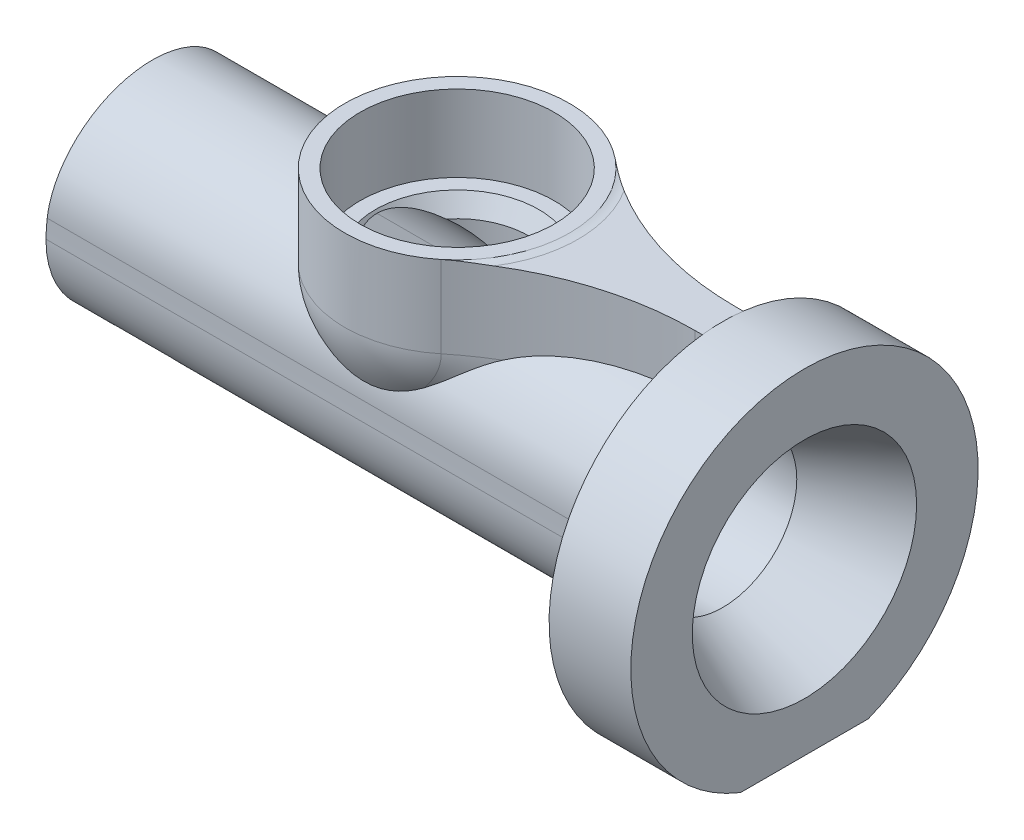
ISO-10303-21;
HEADER;
FILE_DESCRIPTION(('STEP AP214'),'2;1');
FILE_NAME('part.step','',(''),(''),'','','');
FILE_SCHEMA(('AUTOMOTIVE_DESIGN { 1 0 10303 214 1 1 1 1 }'));
ENDSEC;
DATA;
#1=APPLICATION_CONTEXT('core data for automotive mechanical design processes');
#2=APPLICATION_PROTOCOL_DEFINITION('international standard','automotive_design',2000,#1);
#3=PRODUCT_CONTEXT('',#1,'mechanical');
#4=PRODUCT('Part','Part','',(#3));
#5=PRODUCT_RELATED_PRODUCT_CATEGORY('part','',(#4));
#6=PRODUCT_DEFINITION_FORMATION('','',#4);
#7=PRODUCT_DEFINITION_CONTEXT('part definition',#1,'design');
#8=PRODUCT_DEFINITION('design','',#6,#7);
#9=PRODUCT_DEFINITION_SHAPE('','',#8);
#10=(LENGTH_UNIT() NAMED_UNIT(*) SI_UNIT(.MILLI.,.METRE.));
#11=(NAMED_UNIT(*) PLANE_ANGLE_UNIT() SI_UNIT($,.RADIAN.));
#12=(NAMED_UNIT(*) SI_UNIT($,.STERADIAN.) SOLID_ANGLE_UNIT());
#13=UNCERTAINTY_MEASURE_WITH_UNIT(LENGTH_MEASURE(1.E-05),#10,'distance_accuracy_value','');
#14=(GEOMETRIC_REPRESENTATION_CONTEXT(3) GLOBAL_UNCERTAINTY_ASSIGNED_CONTEXT((#13)) GLOBAL_UNIT_ASSIGNED_CONTEXT((#10,
#11,#12)) REPRESENTATION_CONTEXT('',''));
#15=CARTESIAN_POINT('',(0.,0.,0.));
#16=DIRECTION('',(0.,0.,1.));
#17=DIRECTION('',(1.,0.,0.));
#18=AXIS2_PLACEMENT_3D('',#15,#16,#17);
#19=CARTESIAN_POINT('',(10.0187942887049,0.,0.));
#20=DIRECTION('',(1.,0.,0.));
#21=DIRECTION('',(0.,0.,-1.));
#22=AXIS2_PLACEMENT_3D('',#19,#20,#21);
#23=CYLINDRICAL_SURFACE('',#22,7.25);
#24=CARTESIAN_POINT('',(-8.,0.,0.));
#25=DIRECTION('',(1.,0.,0.));
#26=DIRECTION('',(0.,0.,-1.));
#27=AXIS2_PLACEMENT_3D('',#24,#25,#26);
#28=CIRCLE('',#27,7.25);
#29=CARTESIAN_POINT('',(-8.,0.,-7.25));
#30=VERTEX_POINT('',#29);
#31=EDGE_CURVE('E570',#30,#30,#28,.T.);
#32=ORIENTED_EDGE('',*,*,#31,.T.);
#33=EDGE_LOOP('',(#32));
#34=FACE_BOUND('',#33,.T.);
#35=CARTESIAN_POINT('',(-63.8452994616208,0.,0.));
#36=DIRECTION('',(1.,0.,0.));
#37=DIRECTION('',(0.,0.,-1.));
#38=AXIS2_PLACEMENT_3D('',#35,#36,#37);
#39=CIRCLE('',#38,7.25000000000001);
#40=CARTESIAN_POINT('',(-63.8452994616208,-7.25000000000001,-5.26330961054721E-08));
#41=VERTEX_POINT('',#40);
#42=CARTESIAN_POINT('',(-63.8452994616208,0.,-7.25));
#43=VERTEX_POINT('',#42);
#44=EDGE_CURVE('E575',#41,#43,#39,.T.);
#45=ORIENTED_EDGE('',*,*,#44,.F.);
#46=CARTESIAN_POINT('',(-63.8452994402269,0.,0.));
#47=DIRECTION('',(0.926395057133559,0.,0.376553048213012));
#48=DIRECTION('',(0.376553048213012,0.,-0.926395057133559));
#49=AXIS2_PLACEMENT_3D('',#46,#47,#48);
#50=ELLIPSE('',#49,7.82603484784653,7.25);
#51=CARTESIAN_POINT('',(-61.,-1.8874586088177,-7.));
#52=VERTEX_POINT('',#51);
#53=EDGE_CURVE('E453',#52,#41,#50,.F.);
#54=ORIENTED_EDGE('',*,*,#53,.F.);
#55=DIRECTION('',(1.,0.,0.));
#56=VECTOR('',#55,1.);
#57=CARTESIAN_POINT('',(10.0187942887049,-1.8874586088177,-7.));
#58=LINE('',#57,#56);
#59=CARTESIAN_POINT('',(-55.,-1.8874586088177,-7.));
#60=VERTEX_POINT('',#59);
#61=EDGE_CURVE('E450',#60,#52,#58,.F.);
#62=ORIENTED_EDGE('',*,*,#61,.F.);
#63=CARTESIAN_POINT('',(-55.,0.,0.));
#64=DIRECTION('',(-1.,0.,0.));
#65=DIRECTION('',(0.,0.,1.));
#66=AXIS2_PLACEMENT_3D('',#63,#64,#65);
#67=CIRCLE('',#66,7.25);
#68=CARTESIAN_POINT('',(-55.,-1.8874586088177,7.));
#69=VERTEX_POINT('',#68);
#70=EDGE_CURVE('E447',#69,#60,#67,.F.);
#71=ORIENTED_EDGE('',*,*,#70,.F.);
#72=DIRECTION('',(1.,0.,0.));
#73=VECTOR('',#72,1.);
#74=CARTESIAN_POINT('',(10.0187942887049,-1.8874586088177,7.));
#75=LINE('',#74,#73);
#76=CARTESIAN_POINT('',(-61.,-1.88745860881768,7.));
#77=VERTEX_POINT('',#76);
#78=EDGE_CURVE('E444',#77,#69,#75,.T.);
#79=ORIENTED_EDGE('',*,*,#78,.F.);
#80=CARTESIAN_POINT('',(-63.8452994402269,0.,0.));
#81=DIRECTION('',(0.926395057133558,0.,-0.376553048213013));
#82=DIRECTION('',(0.376553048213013,0.,0.926395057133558));
#83=AXIS2_PLACEMENT_3D('',#80,#81,#82);
#84=ELLIPSE('',#83,7.82603484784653,7.25);
#85=EDGE_CURVE('E469',#41,#77,#84,.F.);
#86=ORIENTED_EDGE('',*,*,#85,.F.);
#87=CARTESIAN_POINT('',(-63.8452994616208,0.,7.25));
#88=VERTEX_POINT('',#87);
#89=EDGE_CURVE('E572',#88,#41,#39,.T.);
#90=ORIENTED_EDGE('',*,*,#89,.F.);
#91=DIRECTION('',(1.,0.,0.));
#92=VECTOR('',#91,1.);
#93=CARTESIAN_POINT('',(-70.3414899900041,0.,7.25));
#94=LINE('',#93,#92);
#95=CARTESIAN_POINT('',(-24.5,0.,7.25));
#96=VERTEX_POINT('',#95);
#97=EDGE_CURVE('E866',#88,#96,#94,.T.);
#98=ORIENTED_EDGE('',*,*,#97,.T.);
#99=CARTESIAN_POINT('',(-24.5,0.,0.));
#100=DIRECTION('',(1.,0.,0.));
#101=DIRECTION('',(0.,0.,-1.));
#102=AXIS2_PLACEMENT_3D('',#99,#100,#101);
#103=CIRCLE('',#102,7.25);
#104=CARTESIAN_POINT('',(-24.5,0.,-7.25));
#105=VERTEX_POINT('',#104);
#106=EDGE_CURVE('E748',#105,#96,#103,.T.);
#107=ORIENTED_EDGE('',*,*,#106,.F.);
#108=DIRECTION('',(1.,0.,0.));
#109=VECTOR('',#108,1.);
#110=CARTESIAN_POINT('',(-70.3414899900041,0.,-7.25));
#111=LINE('',#110,#109);
#112=EDGE_CURVE('E864',#43,#105,#111,.T.);
#113=ORIENTED_EDGE('',*,*,#112,.F.);
#114=EDGE_LOOP('',(#45,#54,#62,#71,#79,#86,#90,#98,#107,#113));
#115=FACE_BOUND('',#114,.T.);
#116=ADVANCED_FACE('F64',(#34,#115),#23,.F.);
#117=CARTESIAN_POINT('',(10.0187942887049,0.,0.));
#118=DIRECTION('',(1.,0.,0.));
#119=DIRECTION('',(0.,0.,-1.));
#120=AXIS2_PLACEMENT_3D('',#117,#118,#119);
#121=CYLINDRICAL_SURFACE('',#120,9.25);
#122=DIRECTION('',(1.,0.,0.));
#123=VECTOR('',#122,1.);
#124=CARTESIAN_POINT('',(-70.3414899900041,0.,-9.25));
#125=LINE('',#124,#123);
#126=CARTESIAN_POINT('',(-65.,0.,-9.25));
#127=VERTEX_POINT('',#126);
#128=CARTESIAN_POINT('',(-12.,0.,-9.25));
#129=VERTEX_POINT('',#128);
#130=EDGE_CURVE('E401',#127,#129,#125,.T.);
#131=ORIENTED_EDGE('',*,*,#130,.T.);
#132=CARTESIAN_POINT('',(-12.,0.,0.));
#133=DIRECTION('',(1.,0.,0.));
#134=DIRECTION('',(0.,0.,-1.));
#135=AXIS2_PLACEMENT_3D('',#132,#133,#134);
#136=CIRCLE('',#135,9.25);
#137=CARTESIAN_POINT('',(-12.,0.103351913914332,9.24942259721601));
#138=VERTEX_POINT('',#137);
#139=EDGE_CURVE('E295',#138,#129,#136,.T.);
#140=ORIENTED_EDGE('',*,*,#139,.F.);
#141=DIRECTION('',(1.,0.,0.));
#142=VECTOR('',#141,1.);
#143=CARTESIAN_POINT('',(-38.5,0.103351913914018,9.24942259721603));
#144=LINE('',#143,#142);
#145=CARTESIAN_POINT('',(-65.,0.103351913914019,9.24942259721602));
#146=VERTEX_POINT('',#145);
#147=EDGE_CURVE('E286',#146,#138,#144,.T.);
#148=ORIENTED_EDGE('',*,*,#147,.F.);
#149=CARTESIAN_POINT('',(-65.,0.,0.));
#150=DIRECTION('',(1.,0.,0.));
#151=DIRECTION('',(0.,0.0111731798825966,0.999937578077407));
#152=AXIS2_PLACEMENT_3D('',#149,#150,#151);
#153=CIRCLE('',#152,9.25);
#154=CARTESIAN_POINT('',(-65.,0.,9.25));
#155=VERTEX_POINT('',#154);
#156=EDGE_CURVE('E315',#146,#155,#153,.T.);
#157=ORIENTED_EDGE('',*,*,#156,.T.);
#158=CARTESIAN_POINT('',(-65.,0.,0.));
#159=DIRECTION('',(1.,0.,0.));
#160=DIRECTION('',(0.,0.,-1.));
#161=AXIS2_PLACEMENT_3D('',#158,#159,#160);
#162=CIRCLE('',#161,9.25);
#163=EDGE_CURVE('E298',#155,#127,#162,.T.);
#164=ORIENTED_EDGE('',*,*,#163,.T.);
#165=EDGE_LOOP('',(#131,#140,#148,#157,#164));
#166=FACE_BOUND('',#165,.T.);
#167=DIRECTION('',(1.,0.,0.));
#168=VECTOR('',#167,1.);
#169=CARTESIAN_POINT('',(10.0187942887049,-6.04669331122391,-7.));
#170=LINE('',#169,#168);
#171=CARTESIAN_POINT('',(-61.,-6.04669331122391,-7.));
#172=VERTEX_POINT('',#171);
#173=CARTESIAN_POINT('',(-55.,-6.04669331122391,-7.));
#174=VERTEX_POINT('',#173);
#175=EDGE_CURVE('E438',#172,#174,#170,.T.);
#176=ORIENTED_EDGE('',*,*,#175,.F.);
#177=CARTESIAN_POINT('',(-63.8452994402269,0.,0.));
#178=DIRECTION('',(0.926395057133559,0.,0.376553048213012));
#179=DIRECTION('',(0.376553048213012,0.,-0.926395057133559));
#180=AXIS2_PLACEMENT_3D('',#177,#178,#179);
#181=ELLIPSE('',#180,9.9849410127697,9.25);
#182=CARTESIAN_POINT('',(-63.8452994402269,-9.25,0.));
#183=VERTEX_POINT('',#182);
#184=EDGE_CURVE('E441',#183,#172,#181,.T.);
#185=ORIENTED_EDGE('',*,*,#184,.F.);
#186=CARTESIAN_POINT('',(-63.8452994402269,0.,0.));
#187=DIRECTION('',(0.926395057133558,0.,-0.376553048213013));
#188=DIRECTION('',(0.376553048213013,0.,0.926395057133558));
#189=AXIS2_PLACEMENT_3D('',#186,#187,#188);
#190=ELLIPSE('',#189,9.98494101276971,9.25);
#191=CARTESIAN_POINT('',(-61.,-6.04669331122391,7.));
#192=VERTEX_POINT('',#191);
#193=EDGE_CURVE('E466',#192,#183,#190,.T.);
#194=ORIENTED_EDGE('',*,*,#193,.F.);
#195=DIRECTION('',(1.,0.,0.));
#196=VECTOR('',#195,1.);
#197=CARTESIAN_POINT('',(10.0187942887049,-6.04669331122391,7.));
#198=LINE('',#197,#196);
#199=CARTESIAN_POINT('',(-55.,-6.04669331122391,7.));
#200=VERTEX_POINT('',#199);
#201=EDGE_CURVE('E93',#200,#192,#198,.F.);
#202=ORIENTED_EDGE('',*,*,#201,.F.);
#203=CARTESIAN_POINT('',(-55.,0.,0.));
#204=DIRECTION('',(-1.,0.,0.));
#205=DIRECTION('',(0.,0.,1.));
#206=AXIS2_PLACEMENT_3D('',#203,#204,#205);
#207=CIRCLE('',#206,9.25);
#208=EDGE_CURVE('E435',#174,#200,#207,.T.);
#209=ORIENTED_EDGE('',*,*,#208,.F.);
#210=EDGE_LOOP('',(#176,#185,#194,#202,#209));
#211=FACE_BOUND('',#210,.T.);
#212=ADVANCED_FACE('F328',(#166,#211),#121,.T.);
#213=CARTESIAN_POINT('',(-34.,-17.001,0.));
#214=DIRECTION('',(0.,1.,0.));
#215=DIRECTION('',(0.,0.,1.));
#216=AXIS2_PLACEMENT_3D('',#213,#214,#215);
#217=CYLINDRICAL_SURFACE('',#216,7.);
#218=CARTESIAN_POINT('',(-34.,3.88745860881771,7.));
#219=CARTESIAN_POINT('',(-34.1247238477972,3.88747837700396,6.99999689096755));
#220=CARTESIAN_POINT('',(-34.2494710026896,3.90013845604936,6.99661728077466));
#221=CARTESIAN_POINT('',(-34.4946325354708,3.94741766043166,6.98359413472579));
#222=CARTESIAN_POINT('',(-34.6150251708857,3.9821342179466,6.9739228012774));
#223=CARTESIAN_POINT('',(-34.8286011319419,4.0593623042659,6.95146300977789));
#224=CARTESIAN_POINT('',(-34.9228225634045,4.0993984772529,6.93953188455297));
#225=CARTESIAN_POINT('',(-35.1073636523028,4.18681851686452,6.91248399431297));
#226=CARTESIAN_POINT('',(-35.197679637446,4.23420911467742,6.89736430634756));
#227=CARTESIAN_POINT('',(-35.4640682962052,4.38414909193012,6.84757794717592));
#228=CARTESIAN_POINT('',(-35.6350235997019,4.49423325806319,6.80854704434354));
#229=CARTESIAN_POINT('',(-35.9992397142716,4.74574754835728,6.71155655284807));
#230=CARTESIAN_POINT('',(-36.1904934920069,4.88914107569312,6.65140262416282));
#231=CARTESIAN_POINT('',(-36.5636866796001,5.18146263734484,6.51665610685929));
#232=CARTESIAN_POINT('',(-36.7456170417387,5.33039581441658,6.44204981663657));
#233=CARTESIAN_POINT('',(-37.1016855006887,5.62955727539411,6.27836892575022));
#234=CARTESIAN_POINT('',(-37.2758243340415,5.77978543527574,6.18929569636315));
#235=CARTESIAN_POINT('',(-37.6168279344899,6.07888208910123,5.9964067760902));
#236=CARTESIAN_POINT('',(-37.7836955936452,6.22775110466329,5.89259701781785));
#237=CARTESIAN_POINT('',(-38.1102051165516,6.52231566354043,5.66968353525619));
#238=CARTESIAN_POINT('',(-38.2698407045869,6.66800839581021,5.5505668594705));
#239=CARTESIAN_POINT('',(-38.5810827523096,6.95430141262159,5.29660576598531));
#240=CARTESIAN_POINT('',(-38.7326876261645,7.0949006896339,5.1617582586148));
#241=CARTESIAN_POINT('',(-39.0264916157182,7.36892172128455,4.8760911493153));
#242=CARTESIAN_POINT('',(-39.1687057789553,7.50235489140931,4.72529815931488));
#243=CARTESIAN_POINT('',(-39.4424382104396,7.76025478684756,4.40726025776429));
#244=CARTESIAN_POINT('',(-39.573956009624,7.88472111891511,4.24001462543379));
#245=CARTESIAN_POINT('',(-39.8801774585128,8.1754140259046,3.81056845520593));
#246=CARTESIAN_POINT('',(-40.048118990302,8.33563625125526,3.5391851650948));
#247=CARTESIAN_POINT('',(-40.2746012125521,8.55230100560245,3.10738486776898));
#248=CARTESIAN_POINT('',(-40.3458485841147,8.62056976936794,2.95935343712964));
#249=CARTESIAN_POINT('',(-40.4789227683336,8.74822824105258,2.65538073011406));
#250=CARTESIAN_POINT('',(-40.540750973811,8.80761926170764,2.4994406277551));
#251=CARTESIAN_POINT('',(-40.6451504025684,8.90799187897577,2.2050981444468));
#252=CARTESIAN_POINT('',(-40.6892209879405,8.95040005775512,2.06771124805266));
#253=CARTESIAN_POINT('',(-40.7692293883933,9.02743548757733,1.78846736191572));
#254=CARTESIAN_POINT('',(-40.8051687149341,9.06206418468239,1.64661120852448));
#255=CARTESIAN_POINT('',(-40.8683365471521,9.12295418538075,1.35925869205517));
#256=CARTESIAN_POINT('',(-40.8955683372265,9.14921864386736,1.21376372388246));
#257=CARTESIAN_POINT('',(-40.9408656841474,9.19291879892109,0.920034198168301));
#258=CARTESIAN_POINT('',(-40.9589311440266,9.21035440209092,0.771799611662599));
#259=CARTESIAN_POINT('',(-40.9856048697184,9.2361013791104,0.473156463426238));
#260=CARTESIAN_POINT('',(-40.9941794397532,9.24438024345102,0.322742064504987));
#261=CARTESIAN_POINT('',(-41.0015889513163,9.25153410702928,0.0214484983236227));
#262=CARTESIAN_POINT('',(-41.0004238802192,9.25040909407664,-0.129430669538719));
#263=CARTESIAN_POINT('',(-40.9883767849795,9.23877804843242,-0.430440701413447));
#264=CARTESIAN_POINT('',(-40.9774943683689,9.22827163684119,-0.580571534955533));
#265=CARTESIAN_POINT('',(-40.9462244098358,9.19809119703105,-0.878899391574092));
#266=CARTESIAN_POINT('',(-40.9258370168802,9.1784173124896,-1.02709644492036));
#267=CARTESIAN_POINT('',(-40.8772927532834,9.13159286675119,-1.31249212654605));
#268=CARTESIAN_POINT('',(-40.8496197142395,9.10490806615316,-1.44985006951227));
#269=CARTESIAN_POINT('',(-40.7865431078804,9.04411792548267,-1.72112194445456));
#270=CARTESIAN_POINT('',(-40.751136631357,9.01000979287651,-1.85503455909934));
#271=CARTESIAN_POINT('',(-40.6340332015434,8.89727799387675,-2.25056526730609));
#272=CARTESIAN_POINT('',(-40.5414235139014,8.80821915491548,-2.50614050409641));
#273=CARTESIAN_POINT('',(-40.3645061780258,8.63845085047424,-2.92007400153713));
#274=CARTESIAN_POINT('',(-40.2866489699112,8.56383022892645,-3.08385289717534));
#275=CARTESIAN_POINT('',(-40.1206969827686,8.40506461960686,-3.4013430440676));
#276=CARTESIAN_POINT('',(-40.03259910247,8.32091674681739,-3.5550512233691));
#277=CARTESIAN_POINT('',(-39.7546146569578,8.05598002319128,-4.00089524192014));
#278=CARTESIAN_POINT('',(-39.5511689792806,7.86282488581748,-4.27745161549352));
#279=CARTESIAN_POINT('',(-39.1863498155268,7.51890450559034,-4.70680965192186));
#280=CARTESIAN_POINT('',(-39.0321876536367,7.37420759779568,-4.87098864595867));
#281=CARTESIAN_POINT('',(-38.7129900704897,7.07655739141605,-5.18045458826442));
#282=CARTESIAN_POINT('',(-38.547949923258,6.92360050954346,-5.32573324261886));
#283=CARTESIAN_POINT('',(-38.2082871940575,6.61168597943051,-5.59801664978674));
#284=CARTESIAN_POINT('',(-38.033652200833,6.45272064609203,-5.72499692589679));
#285=CARTESIAN_POINT('',(-37.6758243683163,6.13133603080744,-5.96106190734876));
#286=CARTESIAN_POINT('',(-37.4926344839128,5.96891795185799,-6.070152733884));
#287=CARTESIAN_POINT('',(-37.1723836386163,5.69082791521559,-6.24168690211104));
#288=CARTESIAN_POINT('',(-37.0374542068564,5.57534001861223,-6.30845492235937));
#289=CARTESIAN_POINT('',(-36.7629041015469,5.3452203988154,-6.43343832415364));
#290=CARTESIAN_POINT('',(-36.6232823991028,5.2305888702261,-6.49165181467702));
#291=CARTESIAN_POINT('',(-36.3390089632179,5.00433980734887,-6.59940102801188));
#292=CARTESIAN_POINT('',(-36.1943715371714,4.89271509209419,-6.6489593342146));
#293=CARTESIAN_POINT('',(-35.8983794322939,4.67510410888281,-6.73944570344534));
#294=CARTESIAN_POINT('',(-35.7470299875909,4.56911358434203,-6.78038035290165));
#295=CARTESIAN_POINT('',(-35.4690563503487,4.38997067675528,-6.84525775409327));
#296=CARTESIAN_POINT('',(-35.3442302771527,4.31469521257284,-6.87095945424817));
#297=CARTESIAN_POINT('',(-35.0871112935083,4.17545198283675,-6.91630199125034));
#298=CARTESIAN_POINT('',(-34.9548186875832,4.11148375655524,-6.93594307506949));
#299=CARTESIAN_POINT('',(-34.708054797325,4.01338219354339,-6.96497727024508));
#300=CARTESIAN_POINT('',(-34.5951274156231,3.97586509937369,-6.9756210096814));
#301=CARTESIAN_POINT('',(-34.3645569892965,3.91913082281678,-6.99144763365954));
#302=CARTESIAN_POINT('',(-34.2469329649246,3.8998463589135,-6.99665060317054));
#303=CARTESIAN_POINT('',(-34.0088572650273,3.88372721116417,-7.00101247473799));
#304=CARTESIAN_POINT('',(-33.8883896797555,3.88709576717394,-7.00011665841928));
#305=CARTESIAN_POINT('',(-33.6502429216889,3.9159108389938,-6.99227915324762));
#306=CARTESIAN_POINT('',(-33.5325713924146,3.94141200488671,-6.98532249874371));
#307=CARTESIAN_POINT('',(-33.2523227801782,4.02394138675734,-6.96194051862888));
#308=CARTESIAN_POINT('',(-33.0927515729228,4.08990185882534,-6.94269675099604));
#309=CARTESIAN_POINT('',(-32.7841802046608,4.2410815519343,-6.89538776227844));
#310=CARTESIAN_POINT('',(-32.6352383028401,4.32639757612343,-6.86727791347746));
#311=CARTESIAN_POINT('',(-32.3804040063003,4.48562628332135,-6.8109866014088));
#312=CARTESIAN_POINT('',(-32.2727560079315,4.55736444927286,-6.78444012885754));
#313=CARTESIAN_POINT('',(-32.0612851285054,4.70469355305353,-6.72706406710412));
#314=CARTESIAN_POINT('',(-31.9574634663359,4.78028570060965,-6.69623312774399));
#315=CARTESIAN_POINT('',(-31.6503587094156,5.0107790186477,-6.59739246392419));
#316=CARTESIAN_POINT('',(-31.4517271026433,5.16920350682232,-6.52310086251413));
#317=CARTESIAN_POINT('',(-31.0634165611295,5.4891484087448,-6.35775123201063));
#318=CARTESIAN_POINT('',(-30.8737600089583,5.65067528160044,-6.2666538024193));
#319=CARTESIAN_POINT('',(-30.5029904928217,5.9728038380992,-6.06754929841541));
#320=CARTESIAN_POINT('',(-30.3218709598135,6.13340614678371,-5.95955551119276));
#321=CARTESIAN_POINT('',(-29.9595309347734,6.45884304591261,-5.72048499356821));
#322=CARTESIAN_POINT('',(-29.7787247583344,6.62350955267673,-5.58854773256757));
#323=CARTESIAN_POINT('',(-29.4271711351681,6.94656187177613,-5.304740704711));
#324=CARTESIAN_POINT('',(-29.256427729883,7.1049451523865,-5.1528630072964));
#325=CARTESIAN_POINT('',(-28.927310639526,7.41213582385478,-4.82917127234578));
#326=CARTESIAN_POINT('',(-28.7688920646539,7.56097758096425,-4.65743585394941));
#327=CARTESIAN_POINT('',(-28.4659425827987,7.84686117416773,-4.29305100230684));
#328=CARTESIAN_POINT('',(-28.3214076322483,7.98390644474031,-4.10040769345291));
#329=CARTESIAN_POINT('',(-28.1004872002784,8.19403515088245,-3.77080335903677));
#330=CARTESIAN_POINT('',(-28.0189460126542,8.27175984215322,-3.64021722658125));
#331=CARTESIAN_POINT('',(-27.8632080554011,8.4204499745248,-3.37104585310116));
#332=CARTESIAN_POINT('',(-27.7890102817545,8.49141633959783,-3.23246170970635));
#333=CARTESIAN_POINT('',(-27.6488556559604,8.62564172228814,-2.94756966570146));
#334=CARTESIAN_POINT('',(-27.5828993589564,8.68890022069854,-2.80126124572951));
#335=CARTESIAN_POINT('',(-27.460216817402,8.80668566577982,-2.50148913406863));
#336=CARTESIAN_POINT('',(-27.403486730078,8.86121624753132,-2.34802845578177));
#337=CARTESIAN_POINT('',(-27.2996698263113,8.9610862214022,-2.03306240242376));
#338=CARTESIAN_POINT('',(-27.2526866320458,9.006326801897,-1.87149122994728));
#339=CARTESIAN_POINT('',(-27.1700414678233,9.08595166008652,-1.54284439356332));
#340=CARTESIAN_POINT('',(-27.1343795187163,9.12033591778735,-1.37576871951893));
#341=CARTESIAN_POINT('',(-27.0752130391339,9.17740297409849,-1.03766506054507));
#342=CARTESIAN_POINT('',(-27.0516971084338,9.20009674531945,-0.866640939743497));
#343=CARTESIAN_POINT('',(-27.0173573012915,9.23324122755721,-0.522155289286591));
#344=CARTESIAN_POINT('',(-27.0065313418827,9.24369394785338,-0.348694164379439));
#345=CARTESIAN_POINT('',(-26.9984561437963,9.25149060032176,-0.0257714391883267));
#346=CARTESIAN_POINT('',(-26.9995022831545,9.25048040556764,0.123612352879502));
#347=CARTESIAN_POINT('',(-27.0111204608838,9.23926341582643,0.421661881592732));
#348=CARTESIAN_POINT('',(-27.0216921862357,9.22905692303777,0.570327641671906));
#349=CARTESIAN_POINT('',(-27.0521607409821,9.19964961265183,0.865787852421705));
#350=CARTESIAN_POINT('',(-27.0720572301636,9.18044912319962,1.01258237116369));
#351=CARTESIAN_POINT('',(-27.1208124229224,9.13341996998,1.30326554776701));
#352=CARTESIAN_POINT('',(-27.1496713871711,9.10559105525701,1.44715412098));
#353=CARTESIAN_POINT('',(-27.2147233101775,9.04289762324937,1.72621846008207));
#354=CARTESIAN_POINT('',(-27.2506288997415,9.00830895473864,1.86152355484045));
#355=CARTESIAN_POINT('',(-27.3298213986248,8.93207533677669,2.12792325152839));
#356=CARTESIAN_POINT('',(-27.3731103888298,8.89042839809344,2.25901665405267));
#357=CARTESIAN_POINT('',(-27.5132369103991,8.75573276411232,2.6451356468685));
#358=CARTESIAN_POINT('',(-27.6203717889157,8.65289275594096,2.89315829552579));
#359=CARTESIAN_POINT('',(-27.8246142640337,8.4573430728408,3.30174858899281));
#360=CARTESIAN_POINT('',(-27.9163331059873,8.3696667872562,3.46756529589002));
#361=CARTESIAN_POINT('',(-28.1101636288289,8.18480574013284,3.78744811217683));
#362=CARTESIAN_POINT('',(-28.2122763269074,8.08762004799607,3.94151306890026));
#363=CARTESIAN_POINT('',(-28.4257323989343,7.88505073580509,4.23804404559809));
#364=CARTESIAN_POINT('',(-28.5370975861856,7.77964778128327,4.38048099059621));
#365=CARTESIAN_POINT('',(-28.7676488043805,7.56224138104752,4.65343013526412));
#366=CARTESIAN_POINT('',(-28.8868347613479,7.45023799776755,4.78394244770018));
#367=CARTESIAN_POINT('',(-29.1768069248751,7.17901192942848,5.0787581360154));
#368=CARTESIAN_POINT('',(-29.3505572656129,7.01746746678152,5.23802267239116));
#369=CARTESIAN_POINT('',(-29.7090214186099,6.68722898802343,5.53550352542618));
#370=CARTESIAN_POINT('',(-29.8937407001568,6.51853141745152,5.67370921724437));
#371=CARTESIAN_POINT('',(-30.272843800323,6.17700757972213,5.92963519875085));
#372=CARTESIAN_POINT('',(-30.4672184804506,6.00418529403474,6.04737440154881));
#373=CARTESIAN_POINT('',(-30.8655462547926,5.65753945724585,6.26310787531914));
#374=CARTESIAN_POINT('',(-31.0694941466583,5.48371649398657,6.36111272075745));
#375=CARTESIAN_POINT('',(-31.4590340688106,5.16359635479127,6.52546926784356));
#376=CARTESIAN_POINT('',(-31.6431925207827,5.01685578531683,6.59433216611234));
#377=CARTESIAN_POINT('',(-31.9274001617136,4.80256379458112,6.68686995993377));
#378=CARTESIAN_POINT('',(-32.0234957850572,4.73208173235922,6.71593056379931));
#379=CARTESIAN_POINT('',(-32.2188986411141,4.59423028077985,6.77037361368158));
#380=CARTESIAN_POINT('',(-32.3182052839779,4.52686032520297,6.79575673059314));
#381=CARTESIAN_POINT('',(-32.5637697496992,4.36914768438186,6.8526836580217));
#382=CARTESIAN_POINT('',(-32.712056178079,4.28119965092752,6.88226571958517));
#383=CARTESIAN_POINT('',(-33.0193209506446,4.12296308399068,6.93270264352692));
#384=CARTESIAN_POINT('',(-33.1782680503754,4.05262557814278,6.95358181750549));
#385=CARTESIAN_POINT('',(-33.4490441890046,3.96371753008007,6.97908921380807));
#386=CARTESIAN_POINT('',(-33.5573239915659,3.93562821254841,6.98686020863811));
#387=CARTESIAN_POINT('',(-33.7770710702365,3.89752054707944,6.99730835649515));
#388=CARTESIAN_POINT('',(-33.8885262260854,3.88744094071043,7.00000277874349));
#389=CARTESIAN_POINT('',(-34.,3.88745860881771,7.));
#390=B_SPLINE_CURVE_WITH_KNOTS('',3,(#218,#219,#220,#221,#222,#223,#224,#225,#226,#227,#228,
#229,#230,#231,#232,#233,#234,#235,#236,#237,#238,#239,#240,#241,#242,#243,#244,#245,#246,#247,
#248,#249,#250,#251,#252,#253,#254,#255,#256,#257,#258,#259,#260,#261,#262,#263,#264,#265,#266,
#267,#268,#269,#270,#271,#272,#273,#274,#275,#276,#277,#278,#279,#280,#281,#282,#283,#284,#285,
#286,#287,#288,#289,#290,#291,#292,#293,#294,#295,#296,#297,#298,#299,#300,#301,#302,#303,#304,
#305,#306,#307,#308,#309,#310,#311,#312,#313,#314,#315,#316,#317,#318,#319,#320,#321,#322,#323,
#324,#325,#326,#327,#328,#329,#330,#331,#332,#333,#334,#335,#336,#337,#338,#339,#340,#341,#342,
#343,#344,#345,#346,#347,#348,#349,#350,#351,#352,#353,#354,#355,#356,#357,#358,#359,#360,#361,
#362,#363,#364,#365,#366,#367,#368,#369,#370,#371,#372,#373,#374,#375,#376,#377,#378,#379,#380,
#381,#382,#383,#384,#385,#386,#387,#388,#389),.UNSPECIFIED.,.T.,.F.,(4,2,2,2,2,2,2,2,2,2,2,2,2,
2,2,2,2,2,2,2,2,2,2,2,2,2,2,2,2,2,2,2,2,2,2,2,2,2,2,2,2,2,2,2,2,2,2,2,2,2,2,2,2,2,2,2,2,2,2,2,2,
2,2,2,2,2,2,2,2,2,2,2,2,2,2,2,2,2,2,2,2,2,2,2,2,4),(0.,0.373675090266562,0.749012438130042,
1.05776547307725,1.36680278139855,1.98668514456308,2.72540729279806,3.46483324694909,
4.20418915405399,4.94324825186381,5.68293685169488,6.42277097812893,7.16138929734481,
7.90003998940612,8.96674934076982,9.4999518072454,10.03307535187,10.4837837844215,
10.9344083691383,11.3848627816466,11.8353219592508,12.2873753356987,12.7394292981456,
13.1915015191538,13.6435666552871,14.0710015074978,14.4985974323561,15.3532873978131,
15.9408710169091,16.5286330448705,17.7051952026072,18.5073810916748,19.3099178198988,
20.1135182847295,20.9168432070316,21.4858394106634,22.0549612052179,22.6225750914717,
23.1897538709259,23.6333496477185,24.076927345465,24.4341568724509,24.7900629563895,
25.1491664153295,25.5091591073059,26.0274448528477,26.548382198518,26.9443454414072,
27.3404337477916,28.1336740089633,28.9287981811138,29.7233001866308,30.55602378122,
31.3890795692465,32.2189433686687,33.048564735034,33.565540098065,34.0824446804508,
34.5993840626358,35.1161075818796,35.6380709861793,36.1600353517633,36.6815089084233,
37.2028968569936,37.6504947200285,38.0980778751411,38.5456447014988,38.9932245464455,
39.4253630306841,39.8576235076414,40.7216490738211,41.3472884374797,41.9729890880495,
42.6002091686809,43.2274233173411,44.0834182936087,44.9398437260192,45.7954734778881,
46.6506435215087,47.3859570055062,47.7538447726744,48.1216653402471,48.6456954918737,
49.1682517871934,49.5033714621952,49.8373490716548),.UNSPECIFIED.);
#391=CARTESIAN_POINT('',(-28.5496112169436,7.76794919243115,4.3924096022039));
#392=VERTEX_POINT('',#391);
#393=CARTESIAN_POINT('',(-39.4503887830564,7.76794919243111,4.39240960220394));
#394=VERTEX_POINT('',#393);
#395=EDGE_CURVE('E472',#392,#394,#390,.T.);
#396=ORIENTED_EDGE('',*,*,#395,.T.);
#397=CARTESIAN_POINT('',(-34.,7.76794919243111,0.));
#398=DIRECTION('',(0.,1.,0.));
#399=DIRECTION('',(0.,0.,1.));
#400=AXIS2_PLACEMENT_3D('',#397,#398,#399);
#401=CIRCLE('',#400,7.);
#402=EDGE_CURVE('E606',#394,#392,#401,.T.);
#403=ORIENTED_EDGE('',*,*,#402,.T.);
#404=EDGE_LOOP('',(#396,#403));
#405=FACE_BOUND('',#404,.T.);
#406=ADVANCED_FACE('F337',(#405),#217,.F.);
#407=CARTESIAN_POINT('',(-12.,0.,0.));
#408=DIRECTION('',(1.,0.,0.));
#409=DIRECTION('',(0.,0.,-1.));
#410=AXIS2_PLACEMENT_3D('',#407,#408,#409);
#411=TOROIDAL_SURFACE('',#410,13.25,4.);
#412=CARTESIAN_POINT('',(-10.743483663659,1.94671421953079,9.24984651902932));
#413=CARTESIAN_POINT('',(-10.6975846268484,2.01857029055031,9.25026846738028));
#414=CARTESIAN_POINT('',(-10.653692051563,2.09166965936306,9.24984466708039));
#415=CARTESIAN_POINT('',(-10.5694145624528,2.23977666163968,9.24718599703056));
#416=CARTESIAN_POINT('',(-10.5290274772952,2.31478307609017,9.24495225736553));
#417=CARTESIAN_POINT('',(-10.4512831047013,2.46605466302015,9.23856181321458));
#418=CARTESIAN_POINT('',(-10.4139195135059,2.54231679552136,9.23440923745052));
#419=CARTESIAN_POINT('',(-10.3417451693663,2.69591742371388,9.22410576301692));
#420=CARTESIAN_POINT('',(-10.3069349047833,2.77325612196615,9.21795448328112));
#421=CARTESIAN_POINT('',(-10.2060936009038,3.00589968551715,9.19645781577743));
#422=CARTESIAN_POINT('',(-10.143379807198,3.16237548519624,9.17804773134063));
#423=CARTESIAN_POINT('',(-10.0250179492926,3.47684998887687,9.13272748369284));
#424=CARTESIAN_POINT('',(-9.96937544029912,3.63484978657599,9.10581069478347));
#425=CARTESIAN_POINT('',(-9.84017573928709,4.02246662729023,9.0292186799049));
#426=CARTESIAN_POINT('',(-9.76986203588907,4.25223415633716,8.97475454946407));
#427=CARTESIAN_POINT('',(-9.63903246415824,4.70950036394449,8.84745604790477));
#428=CARTESIAN_POINT('',(-9.57851894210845,4.93699848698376,8.77461728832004));
#429=CARTESIAN_POINT('',(-9.49378695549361,5.27501698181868,8.65165906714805));
#430=CARTESIAN_POINT('',(-9.46651931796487,5.38728879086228,8.60832743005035));
#431=CARTESIAN_POINT('',(-9.41386924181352,5.61039440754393,8.51716321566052));
#432=CARTESIAN_POINT('',(-9.38848620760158,5.72122866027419,8.46933207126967));
#433=CARTESIAN_POINT('',(-9.3149216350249,6.05128242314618,8.31913557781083));
#434=CARTESIAN_POINT('',(-9.26932041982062,6.2680699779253,8.21006098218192));
#435=CARTESIAN_POINT('',(-9.18370669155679,6.69506637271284,7.97364043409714));
#436=CARTESIAN_POINT('',(-9.14374542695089,6.90520290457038,7.84614589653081));
#437=CARTESIAN_POINT('',(-9.06910760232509,7.31529918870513,7.57433843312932));
#438=CARTESIAN_POINT('',(-9.03443106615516,7.51525889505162,7.43002543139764));
#439=CARTESIAN_POINT('',(-8.96975714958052,7.90337937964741,7.12554738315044));
#440=CARTESIAN_POINT('',(-8.93975773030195,8.09154527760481,6.96538929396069));
#441=CARTESIAN_POINT('',(-8.88390513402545,8.45478103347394,6.6301870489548));
#442=CARTESIAN_POINT('',(-8.8580520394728,8.6298506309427,6.45514259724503));
#443=CARTESIAN_POINT('',(-8.80923697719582,8.97137984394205,6.08505681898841));
#444=CARTESIAN_POINT('',(-8.78640454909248,9.1373383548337,5.88953560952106));
#445=CARTESIAN_POINT('',(-8.74430961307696,9.45261353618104,5.48514257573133));
#446=CARTESIAN_POINT('',(-8.72504719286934,9.60192979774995,5.27627042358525));
#447=CARTESIAN_POINT('',(-8.68975057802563,9.88280937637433,4.84661714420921));
#448=CARTESIAN_POINT('',(-8.67371677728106,10.0143705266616,4.62583456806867));
#449=CARTESIAN_POINT('',(-8.64459533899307,10.2587393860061,4.17393212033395));
#450=CARTESIAN_POINT('',(-8.63150777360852,10.3715466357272,3.94281199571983));
#451=CARTESIAN_POINT('',(-8.60799671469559,10.5779896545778,3.47090641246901));
#452=CARTESIAN_POINT('',(-8.59758428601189,10.6715454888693,3.23008542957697));
#453=CARTESIAN_POINT('',(-8.57930293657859,10.8382133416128,2.74137550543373));
#454=CARTESIAN_POINT('',(-8.57143402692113,10.9113252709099,2.49348653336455));
#455=CARTESIAN_POINT('',(-8.55809401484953,11.0365678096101,1.99239509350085));
#456=CARTESIAN_POINT('',(-8.55262296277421,11.0886979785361,1.73919251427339));
#457=CARTESIAN_POINT('',(-8.54397676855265,11.1715914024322,1.2292804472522));
#458=CARTESIAN_POINT('',(-8.54080157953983,11.2023550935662,0.972571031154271));
#459=CARTESIAN_POINT('',(-8.53668481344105,11.2423150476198,0.457164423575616));
#460=CARTESIAN_POINT('',(-8.53574580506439,11.2514865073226,0.198465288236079));
#461=CARTESIAN_POINT('',(-8.53609112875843,11.2481221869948,-0.318790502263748));
#462=CARTESIAN_POINT('',(-8.53737546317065,11.2355863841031,-0.577347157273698));
#463=CARTESIAN_POINT('',(-8.54219176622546,11.1888994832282,-1.09247933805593));
#464=CARTESIAN_POINT('',(-8.54572372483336,11.1547484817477,-1.34905487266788));
#465=CARTESIAN_POINT('',(-8.55510181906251,11.0650818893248,-1.85840225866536));
#466=CARTESIAN_POINT('',(-8.56094795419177,11.0095663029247,-2.11117411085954));
#467=CARTESIAN_POINT('',(-8.57506515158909,10.8775657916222,-2.61116698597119));
#468=CARTESIAN_POINT('',(-8.58333669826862,10.8010766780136,-2.85838688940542));
#469=CARTESIAN_POINT('',(-8.60245748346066,10.6276991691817,-3.34546453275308));
#470=CARTESIAN_POINT('',(-8.61330672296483,10.5308107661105,-3.58532226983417));
#471=CARTESIAN_POINT('',(-8.63778168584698,10.3173532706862,-4.0559713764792));
#472=CARTESIAN_POINT('',(-8.65140744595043,10.2007839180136,-4.28676262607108));
#473=CARTESIAN_POINT('',(-8.68168195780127,9.94883806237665,-4.73763263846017));
#474=CARTESIAN_POINT('',(-8.69833070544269,9.81346158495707,-4.95771141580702));
#475=CARTESIAN_POINT('',(-8.73494051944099,9.52499628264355,-5.38548491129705));
#476=CARTESIAN_POINT('',(-8.75489992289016,9.37191636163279,-5.59318577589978));
#477=CARTESIAN_POINT('',(-8.79849274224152,9.04915749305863,-5.99485240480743));
#478=CARTESIAN_POINT('',(-8.82212617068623,8.87947848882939,-6.18881812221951));
#479=CARTESIAN_POINT('',(-8.87348587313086,8.52486026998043,-6.56162118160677));
#480=CARTESIAN_POINT('',(-8.90121158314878,8.33992315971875,-6.74046060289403));
#481=CARTESIAN_POINT('',(-8.96126031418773,7.95622929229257,-7.08179083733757));
#482=CARTESIAN_POINT('',(-8.99358325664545,7.75747277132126,-7.24428192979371));
#483=CARTESIAN_POINT('',(-9.06335467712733,7.34818689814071,-7.55147163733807));
#484=CARTESIAN_POINT('',(-9.10079187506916,7.13768404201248,-7.69620811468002));
#485=CARTESIAN_POINT('',(-9.1815776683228,6.70625982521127,-7.96734094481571));
#486=CARTESIAN_POINT('',(-9.22492616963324,6.48533863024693,-8.09373758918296));
#487=CARTESIAN_POINT('',(-9.31849884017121,6.03477250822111,-8.32752016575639));
#488=CARTESIAN_POINT('',(-9.36872966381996,5.80511929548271,-8.43488746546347));
#489=CARTESIAN_POINT('',(-9.47721822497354,5.33944649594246,-8.62984750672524));
#490=CARTESIAN_POINT('',(-9.53547399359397,5.10342848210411,-8.71744508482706));
#491=CARTESIAN_POINT('',(-9.64846563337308,4.67715554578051,-8.85632989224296));
#492=CARTESIAN_POINT('',(-9.70139547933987,4.48763805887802,-8.91137967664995));
#493=CARTESIAN_POINT('',(-9.8144412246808,4.10744462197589,-9.00886628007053));
#494=CARTESIAN_POINT('',(-9.87455826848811,3.91676849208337,-9.05130108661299));
#495=CARTESIAN_POINT('',(-10.0032618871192,3.53678581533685,-9.12348813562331));
#496=CARTESIAN_POINT('',(-10.0718117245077,3.34747688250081,-9.15329304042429));
#497=CARTESIAN_POINT('',(-10.2198082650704,2.97169311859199,-9.20076511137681));
#498=CARTESIAN_POINT('',(-10.2992465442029,2.78521621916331,-9.21844159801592));
#499=CARTESIAN_POINT('',(-10.4391018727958,2.48951531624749,-9.23772534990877));
#500=CARTESIAN_POINT('',(-10.4949534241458,2.37836925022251,-9.24290565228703));
#501=CARTESIAN_POINT('',(-10.583889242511,2.2142551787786,-9.24768057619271));
#502=CARTESIAN_POINT('',(-10.6144187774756,2.15994542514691,-9.2487726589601));
#503=CARTESIAN_POINT('',(-10.6774306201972,2.05243479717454,-9.25000823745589));
#504=CARTESIAN_POINT('',(-10.7099136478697,1.99923434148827,-9.25015138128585));
#505=CARTESIAN_POINT('',(-10.743483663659,1.94671421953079,-9.24984651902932));
#506=B_SPLINE_CURVE_WITH_KNOTS('',3,(#412,#413,#414,#415,#416,#417,#418,#419,#420,#421,#422,
#423,#424,#425,#426,#427,#428,#429,#430,#431,#432,#433,#434,#435,#436,#437,#438,#439,#440,#441,
#442,#443,#444,#445,#446,#447,#448,#449,#450,#451,#452,#453,#454,#455,#456,#457,#458,#459,#460,
#461,#462,#463,#464,#465,#466,#467,#468,#469,#470,#471,#472,#473,#474,#475,#476,#477,#478,#479,
#480,#481,#482,#483,#484,#485,#486,#487,#488,#489,#490,#491,#492,#493,#494,#495,#496,#497,#498,
#499,#500,#501,#502,#503,#504,#505),.UNSPECIFIED.,.F.,.F.,(4,2,2,2,2,2,2,2,2,2,2,2,2,2,2,2,2,2,
2,2,2,2,2,2,2,2,2,2,2,2,2,2,2,2,2,2,2,2,2,2,2,2,2,2,2,2,4),(0.,0.255706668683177,
0.511253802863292,0.766253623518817,1.02130209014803,1.52957902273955,2.0382528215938,
2.77642151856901,3.51476668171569,3.88485747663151,4.25483080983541,4.99472181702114,
5.74095416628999,6.48718988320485,7.23309938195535,7.97902371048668,8.75052653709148,
9.52204831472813,10.2936641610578,11.0652989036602,11.8400756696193,12.6148558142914,
13.3896522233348,14.1644328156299,14.9401029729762,15.7157739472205,16.4914414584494,
17.2671088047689,18.0429311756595,18.8187538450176,19.5945867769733,20.3704186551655,
21.1458620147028,21.9213080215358,22.6966472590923,23.4719732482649,24.2456159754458,
25.0192464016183,25.7936301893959,26.5678243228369,27.1803229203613,27.7929191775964,
28.4029353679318,29.0124822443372,29.3857141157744,29.5726069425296,29.7595690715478),.UNSPECIFIED.);
#507=CARTESIAN_POINT('',(-8.55868953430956,11.0311959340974,-1.99999999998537));
#508=VERTEX_POINT('',#507);
#509=CARTESIAN_POINT('',(-10.7099281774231,2.,-9.25));
#510=VERTEX_POINT('',#509);
#511=EDGE_CURVE('E418',#508,#510,#506,.T.);
#512=ORIENTED_EDGE('',*,*,#511,.F.);
#513=CARTESIAN_POINT('',(-11.4288761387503,9.07316706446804,-2.));
#514=CARTESIAN_POINT('',(-11.6466792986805,9.04100355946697,-2.));
#515=CARTESIAN_POINT('',(-11.8673578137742,9.02724507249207,-2.));
#516=CARTESIAN_POINT('',(-12.3080425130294,9.03711643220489,-2.));
#517=CARTESIAN_POINT('',(-12.5280476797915,9.06078777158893,-2.));
#518=CARTESIAN_POINT('',(-12.9607870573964,9.14472394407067,-2.));
#519=CARTESIAN_POINT('',(-13.1735269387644,9.20495951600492,-2.));
#520=CARTESIAN_POINT('',(-13.5859457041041,9.359994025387,-2.));
#521=CARTESIAN_POINT('',(-13.7856267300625,9.45478727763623,-2.));
#522=CARTESIAN_POINT('',(-14.1681898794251,9.67686708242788,-2.));
#523=CARTESIAN_POINT('',(-14.35092156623,9.80441256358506,-2.));
#524=CARTESIAN_POINT('',(-14.6929519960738,10.0877882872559,-2.));
#525=CARTESIAN_POINT('',(-14.8522477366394,10.2436221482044,-2.));
#526=CARTESIAN_POINT('',(-15.1463635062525,10.5826474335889,-2.));
#527=CARTESIAN_POINT('',(-15.2806052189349,10.7663406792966,-2.));
#528=CARTESIAN_POINT('',(-15.5168931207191,11.1533846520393,-2.));
#529=CARTESIAN_POINT('',(-15.6189365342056,11.3567370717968,-2.));
#530=CARTESIAN_POINT('',(-15.7893904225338,11.7806601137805,-2.));
#531=CARTESIAN_POINT('',(-15.8572711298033,12.001443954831,-2.));
#532=CARTESIAN_POINT('',(-15.9551362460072,12.4512613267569,-2.));
#533=CARTESIAN_POINT('',(-15.9851196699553,12.6802950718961,-2.));
#534=CARTESIAN_POINT('',(-16.0062800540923,13.140866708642,-2.));
#535=CARTESIAN_POINT('',(-15.9973370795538,13.3724101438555,-2.));
#536=CARTESIAN_POINT('',(-15.9404715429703,13.8306655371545,-2.));
#537=CARTESIAN_POINT('',(-15.892549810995,14.0573775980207,-2.));
#538=CARTESIAN_POINT('',(-15.7593218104,14.4981068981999,-2.));
#539=CARTESIAN_POINT('',(-15.6742339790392,14.7121901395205,-2.));
#540=CARTESIAN_POINT('',(-15.4689985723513,15.1228385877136,-2.));
#541=CARTESIAN_POINT('',(-15.3488526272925,15.3194046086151,-2.));
#542=CARTESIAN_POINT('',(-15.0780930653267,15.6875142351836,-2.));
#543=CARTESIAN_POINT('',(-14.9277688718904,15.8592707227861,-2.));
#544=CARTESIAN_POINT('',(-14.6001937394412,16.1748351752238,-2.));
#545=CARTESIAN_POINT('',(-14.4229440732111,16.3186444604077,-2.));
#546=CARTESIAN_POINT('',(-14.0482008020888,16.5729428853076,-2.));
#547=CARTESIAN_POINT('',(-13.8508944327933,16.6837079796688,-2.));
#548=CARTESIAN_POINT('',(-13.4404025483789,16.8703070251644,-2.));
#549=CARTESIAN_POINT('',(-13.227217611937,16.9461422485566,-2.));
#550=CARTESIAN_POINT('',(-12.7924158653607,17.0602871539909,-2.));
#551=CARTESIAN_POINT('',(-12.5708581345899,17.0988219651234,-2.));
#552=CARTESIAN_POINT('',(-12.1244189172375,17.1380332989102,-2.));
#553=CARTESIAN_POINT('',(-11.8995374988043,17.1387105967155,-2.));
#554=CARTESIAN_POINT('',(-11.4534973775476,17.1022396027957,-2.));
#555=CARTESIAN_POINT('',(-11.2323300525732,17.0651966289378,-2.));
#556=CARTESIAN_POINT('',(-10.7993482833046,16.9545298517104,-2.));
#557=CARTESIAN_POINT('',(-10.5875338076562,16.8809061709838,-2.));
#558=CARTESIAN_POINT('',(-10.1790866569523,16.6991588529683,-2.));
#559=CARTESIAN_POINT('',(-9.98246488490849,16.591010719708,-2.));
#560=CARTESIAN_POINT('',(-9.61007208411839,16.343367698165,-2.));
#561=CARTESIAN_POINT('',(-9.43430136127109,16.2038723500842,-2.));
#562=CARTESIAN_POINT('',(-9.10779200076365,15.8969113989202,-2.));
#563=CARTESIAN_POINT('',(-8.95715982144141,15.7293325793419,-2.));
#564=CARTESIAN_POINT('',(-8.68593239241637,15.3714192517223,-2.));
#565=CARTESIAN_POINT('',(-8.56533804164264,15.1810840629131,-2.));
#566=CARTESIAN_POINT('',(-8.356660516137,14.7816214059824,-2.));
#567=CARTESIAN_POINT('',(-8.26881598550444,14.5723692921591,-2.));
#568=CARTESIAN_POINT('',(-8.12915185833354,14.1421728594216,-2.));
#569=CARTESIAN_POINT('',(-8.07733398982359,13.9212279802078,-2.));
#570=CARTESIAN_POINT('',(-8.01069388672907,13.4717793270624,-2.));
#571=CARTESIAN_POINT('',(-7.99621147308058,13.2432251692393,-2.));
#572=CARTESIAN_POINT('',(-8.00547666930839,12.7868924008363,-2.));
#573=CARTESIAN_POINT('',(-8.02922635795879,12.5591138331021,-2.));
#574=CARTESIAN_POINT('',(-8.11456024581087,12.108743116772,-2.));
#575=CARTESIAN_POINT('',(-8.17646483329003,11.8862116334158,-2.));
#576=CARTESIAN_POINT('',(-8.33662075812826,11.4546368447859,-2.));
#577=CARTESIAN_POINT('',(-8.43487226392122,11.2455936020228,-2.));
#578=CARTESIAN_POINT('',(-8.66540128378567,10.8462797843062,-2.));
#579=CARTESIAN_POINT('',(-8.79778776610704,10.6560720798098,-2.));
#580=CARTESIAN_POINT('',(-9.09287254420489,10.3007266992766,-2.));
#581=CARTESIAN_POINT('',(-9.25557798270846,10.1355949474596,-2.));
#582=CARTESIAN_POINT('',(-9.60555390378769,9.83655084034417,-2.));
#583=CARTESIAN_POINT('',(-9.79264669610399,9.70243045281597,-2.));
#584=CARTESIAN_POINT('',(-10.1868979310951,9.4683606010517,-2.));
#585=CARTESIAN_POINT('',(-10.3940285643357,9.36836462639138,-2.));
#586=CARTESIAN_POINT('',(-10.7405399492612,9.23677888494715,-2.));
#587=CARTESIAN_POINT('',(-10.8756497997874,9.19364328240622,-2.));
#588=CARTESIAN_POINT('',(-11.1497349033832,9.1221867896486,-2.));
#589=CARTESIAN_POINT('',(-11.2887101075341,9.09386571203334,-2.));
#590=CARTESIAN_POINT('',(-11.4288761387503,9.07316706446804,-2.));
#591=B_SPLINE_CURVE_WITH_KNOTS('',3,(#513,#514,#515,#516,#517,#518,#519,#520,#521,#522,#523,
#524,#525,#526,#527,#528,#529,#530,#531,#532,#533,#534,#535,#536,#537,#538,#539,#540,#541,#542,
#543,#544,#545,#546,#547,#548,#549,#550,#551,#552,#553,#554,#555,#556,#557,#558,#559,#560,#561,
#562,#563,#564,#565,#566,#567,#568,#569,#570,#571,#572,#573,#574,#575,#576,#577,#578,#579,#580,
#581,#582,#583,#584,#585,#586,#587,#588,#589,#590),.UNSPECIFIED.,.T.,.F.,(4,2,2,2,2,2,2,2,2,2,2,
2,2,2,2,2,2,2,2,2,2,2,2,2,2,2,2,2,2,2,2,2,2,2,2,2,2,2,4),(0.,0.659975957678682,1.32068404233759,
1.98086407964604,2.64093555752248,3.30639524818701,3.97194011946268,4.65133482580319,
5.33078808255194,6.02047597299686,6.71018178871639,7.40201413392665,8.09383174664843,
8.78163691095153,9.46941009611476,10.1508778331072,10.8323133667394,11.5078877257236,
12.1834374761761,12.8548839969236,13.5263167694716,14.1958799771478,14.8654409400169,
15.5354780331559,16.2055249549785,16.8783411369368,17.5511774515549,18.2288250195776,
18.9065050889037,19.5903318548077,20.2741958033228,20.9638819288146,21.6535712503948,
22.3454901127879,23.0375721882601,23.7248674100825,24.41122209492,24.8359513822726,
25.2606752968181),.UNSPECIFIED.);
#592=CARTESIAN_POINT('',(-8.,13.0981868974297,-2.));
#593=VERTEX_POINT('',#592);
#594=EDGE_CURVE('E554',#593,#508,#591,.T.);
#595=ORIENTED_EDGE('',*,*,#594,.F.);
#596=CARTESIAN_POINT('',(-8.,0.,0.));
#597=DIRECTION('',(1.,0.,0.));
#598=DIRECTION('',(0.,0.,-1.));
#599=AXIS2_PLACEMENT_3D('',#596,#597,#598);
#600=CIRCLE('',#599,13.25);
#601=CARTESIAN_POINT('',(-8.,13.0981868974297,2.));
#602=VERTEX_POINT('',#601);
#603=EDGE_CURVE('E294',#602,#593,#600,.T.);
#604=ORIENTED_EDGE('',*,*,#603,.F.);
#605=CARTESIAN_POINT('',(-11.4288761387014,9.0731670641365,1.99999999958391));
#606=CARTESIAN_POINT('',(-11.3186424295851,9.08945037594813,1.99999999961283));
#607=CARTESIAN_POINT('',(-11.2091156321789,9.110444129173,1.99999999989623));
#608=CARTESIAN_POINT('',(-10.99220788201,9.16167822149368,2.0000000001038));
#609=CARTESIAN_POINT('',(-10.884827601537,9.19192141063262,2.00000000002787));
#610=CARTESIAN_POINT('',(-10.6729081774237,9.26143602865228,1.9999999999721));
#611=CARTESIAN_POINT('',(-10.5683719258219,9.30071628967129,1.99999999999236));
#612=CARTESIAN_POINT('',(-10.3629727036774,9.38795535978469,2.00000000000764));
#613=CARTESIAN_POINT('',(-10.2621111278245,9.43591742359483,2.00000000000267));
#614=CARTESIAN_POINT('',(-9.96644693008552,9.59211149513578,1.99999999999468));
#615=CARTESIAN_POINT('',(-9.77805143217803,9.7128208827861,1.99999999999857));
#616=CARTESIAN_POINT('',(-9.42396098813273,9.98360894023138,2.00000000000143));
#617=CARTESIAN_POINT('',(-9.25826141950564,10.1336816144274,2.00000000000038));
#618=CARTESIAN_POINT('',(-8.95134476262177,10.4613855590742,1.99999999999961));
#619=CARTESIAN_POINT('',(-8.81053336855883,10.6393973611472,1.9999999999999));
#620=CARTESIAN_POINT('',(-8.56021651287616,11.0162193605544,2.0000000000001));
#621=CARTESIAN_POINT('',(-8.45071486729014,11.2150320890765,2.00000000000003));
#622=CARTESIAN_POINT('',(-8.26438999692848,11.6313432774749,1.99999999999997));
#623=CARTESIAN_POINT('',(-8.18812932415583,11.8490937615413,1.99999999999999));
#624=CARTESIAN_POINT('',(-8.07306058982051,12.2942801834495,2.00000000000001));
#625=CARTESIAN_POINT('',(-8.03425387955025,12.521716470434,2.));
#626=CARTESIAN_POINT('',(-7.99517780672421,12.9809002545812,2.));
#627=CARTESIAN_POINT('',(-7.99507959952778,13.2126623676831,2.));
#628=CARTESIAN_POINT('',(-8.03399874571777,13.6728834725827,2.));
#629=CARTESIAN_POINT('',(-8.07301529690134,13.9013425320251,2.));
#630=CARTESIAN_POINT('',(-8.18891810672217,14.3472140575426,2.));
#631=CARTESIAN_POINT('',(-8.26561160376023,14.5646766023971,2.));
#632=CARTESIAN_POINT('',(-8.45474722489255,14.9834613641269,2.));
#633=CARTESIAN_POINT('',(-8.56718779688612,15.1847842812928,2.));
#634=CARTESIAN_POINT('',(-8.82354200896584,15.5636307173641,2.));
#635=CARTESIAN_POINT('',(-8.96716250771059,15.7413525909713,2.));
#636=CARTESIAN_POINT('',(-9.28244307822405,16.0698913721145,2.));
#637=CARTESIAN_POINT('',(-9.45410178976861,16.2207095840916,2.));
#638=CARTESIAN_POINT('',(-9.81895024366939,16.4897714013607,2.));
#639=CARTESIAN_POINT('',(-10.0119372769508,16.6082899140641,2.));
#640=CARTESIAN_POINT('',(-10.415168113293,16.8110012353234,2.));
#641=CARTESIAN_POINT('',(-10.6254112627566,16.8951953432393,2.));
#642=CARTESIAN_POINT('',(-11.0557300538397,17.0263394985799,2.));
#643=CARTESIAN_POINT('',(-11.275733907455,17.0735251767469,2.));
#644=CARTESIAN_POINT('',(-11.7205451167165,17.1301604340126,2.));
#645=CARTESIAN_POINT('',(-11.945352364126,17.1396108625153,2.));
#646=CARTESIAN_POINT('',(-12.3926288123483,17.1205293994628,2.));
#647=CARTESIAN_POINT('',(-12.6151031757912,17.0921182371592,2.));
#648=CARTESIAN_POINT('',(-13.0521242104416,16.9983579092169,2.));
#649=CARTESIAN_POINT('',(-13.2666709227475,16.9330089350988,2.));
#650=CARTESIAN_POINT('',(-13.6818380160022,16.7672546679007,2.));
#651=CARTESIAN_POINT('',(-13.8824540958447,16.6668386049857,2.));
#652=CARTESIAN_POINT('',(-14.2640628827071,16.433870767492,2.));
#653=CARTESIAN_POINT('',(-14.4450553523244,16.3013186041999,2.));
#654=CARTESIAN_POINT('',(-14.7830360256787,16.0073447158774,2.));
#655=CARTESIAN_POINT('',(-14.9399316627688,15.8458165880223,2.));
#656=CARTESIAN_POINT('',(-15.2245966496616,15.4988687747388,2.));
#657=CARTESIAN_POINT('',(-15.3523651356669,15.3134483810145,2.));
#658=CARTESIAN_POINT('',(-15.5761117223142,14.9226410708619,2.));
#659=CARTESIAN_POINT('',(-15.671866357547,14.7171262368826,2.));
#660=CARTESIAN_POINT('',(-15.8278562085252,14.2930362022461,2.));
#661=CARTESIAN_POINT('',(-15.8880898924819,14.0744604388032,2.));
#662=CARTESIAN_POINT('',(-15.9719071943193,13.6283673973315,2.));
#663=CARTESIAN_POINT('',(-15.9951582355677,13.4007876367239,2.));
#664=CARTESIAN_POINT('',(-16.0034792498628,12.9449304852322,2.));
#665=CARTESIAN_POINT('',(-15.9885471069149,12.7166530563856,2.));
#666=CARTESIAN_POINT('',(-15.9207343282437,12.2637607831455,2.));
#667=CARTESIAN_POINT('',(-15.8675227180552,12.0391954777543,2.));
#668=CARTESIAN_POINT('',(-15.7243138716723,11.6021009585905,2.));
#669=CARTESIAN_POINT('',(-15.6343149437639,11.389572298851,2.));
#670=CARTESIAN_POINT('',(-15.4195868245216,10.9817199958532,2.));
#671=CARTESIAN_POINT('',(-15.2947116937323,10.7864732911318,2.));
#672=CARTESIAN_POINT('',(-15.0136731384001,10.4197921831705,2.));
#673=CARTESIAN_POINT('',(-14.8575110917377,10.2483567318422,2.));
#674=CARTESIAN_POINT('',(-14.6037997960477,10.0136123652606,2.));
#675=CARTESIAN_POINT('',(-14.5162277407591,9.93925723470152,2.));
#676=CARTESIAN_POINT('',(-14.3350685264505,9.79829778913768,2.));
#677=CARTESIAN_POINT('',(-14.2414837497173,9.73169043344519,1.99999999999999));
#678=CARTESIAN_POINT('',(-14.0488927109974,9.60672327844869,2.00000000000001));
#679=CARTESIAN_POINT('',(-13.9498833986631,9.54836818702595,2.00000000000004));
#680=CARTESIAN_POINT('',(-13.7472324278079,9.44044587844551,1.99999999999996));
#681=CARTESIAN_POINT('',(-13.643592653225,9.3908751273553,1.99999999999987));
#682=CARTESIAN_POINT('',(-13.4342019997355,9.30168503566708,2.00000000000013));
#683=CARTESIAN_POINT('',(-13.3285172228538,9.26191046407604,2.00000000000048));
#684=CARTESIAN_POINT('',(-13.1141671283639,9.19158480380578,1.99999999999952));
#685=CARTESIAN_POINT('',(-13.0055030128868,9.16103005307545,1.9999999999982));
#686=CARTESIAN_POINT('',(-12.7860608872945,9.10941575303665,2.0000000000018));
#687=CARTESIAN_POINT('',(-12.6752852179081,9.08834626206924,2.0000000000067));
#688=CARTESIAN_POINT('',(-12.4523674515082,9.05584590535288,1.9999999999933));
#689=CARTESIAN_POINT('',(-12.3402257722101,9.04441216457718,1.999999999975));
#690=CARTESIAN_POINT('',(-12.0945090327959,9.03005897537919,2.00000000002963));
#691=CARTESIAN_POINT('',(-11.96081452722,9.02911086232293,2.0000000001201));
#692=CARTESIAN_POINT('',(-11.6940338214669,9.04091047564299,1.99999999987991));
#693=CARTESIAN_POINT('',(-11.5609476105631,9.05365795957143,1.99999999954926));
#694=CARTESIAN_POINT('',(-11.4288761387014,9.0731670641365,1.99999999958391));
#695=B_SPLINE_CURVE_WITH_KNOTS('',3,(#605,#606,#607,#608,#609,#610,#611,#612,#613,#614,#615,
#616,#617,#618,#619,#620,#621,#622,#623,#624,#625,#626,#627,#628,#629,#630,#631,#632,#633,#634,
#635,#636,#637,#638,#639,#640,#641,#642,#643,#644,#645,#646,#647,#648,#649,#650,#651,#652,#653,
#654,#655,#656,#657,#658,#659,#660,#661,#662,#663,#664,#665,#666,#667,#668,#669,#670,#671,#672,
#673,#674,#675,#676,#677,#678,#679,#680,#681,#682,#683,#684,#685,#686,#687,#688,#689,#690,#691,
#692,#693,#694),.UNSPECIFIED.,.T.,.F.,(4,2,2,2,2,2,2,2,2,2,2,2,2,2,2,2,2,2,2,2,2,2,2,2,2,2,2,2,
2,2,2,2,2,2,2,2,2,2,2,2,2,2,2,2,4),(0.,0.334168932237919,0.668440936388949,1.00304103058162,
1.33776682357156,2.00561681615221,2.67333058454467,3.35108668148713,4.02892534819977,
4.71782774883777,5.40675500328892,6.09872841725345,6.79068763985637,7.47914298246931,
8.1675684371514,8.84978211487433,9.53196270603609,10.2081416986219,10.8842950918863,
11.5561076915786,12.2279051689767,12.8975656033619,13.5672225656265,14.2370853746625,
14.9069562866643,15.579339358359,16.2517423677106,16.9287454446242,17.6057777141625,
18.2888646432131,18.9719894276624,19.6610927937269,20.3502278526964,21.0422909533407,
21.7343235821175,22.0786222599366,22.4227853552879,22.7671440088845,23.1113638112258,
23.4497159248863,23.7879334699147,24.1257956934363,24.4635570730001,24.8639333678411,
25.2643025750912),.UNSPECIFIED.);
#696=CARTESIAN_POINT('',(-8.55868953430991,11.0311959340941,2.00000000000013));
#697=VERTEX_POINT('',#696);
#698=EDGE_CURVE('E547',#697,#602,#695,.T.);
#699=ORIENTED_EDGE('',*,*,#698,.F.);
#700=CARTESIAN_POINT('',(-10.7433557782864,1.94691421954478,9.24984766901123));
#701=VERTEX_POINT('',#700);
#702=EDGE_CURVE('E385',#701,#697,#506,.T.);
#703=ORIENTED_EDGE('',*,*,#702,.F.);
#704=CARTESIAN_POINT('',(-12.0002,0.103352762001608,9.24942259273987));
#705=CARTESIAN_POINT('',(-11.9985911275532,0.103331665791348,9.24942270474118));
#706=CARTESIAN_POINT('',(-11.9969925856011,0.10348997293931,9.24942186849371));
#707=CARTESIAN_POINT('',(-11.9938846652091,0.104092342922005,9.24941869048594));
#708=CARTESIAN_POINT('',(-11.9923741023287,0.104530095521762,9.24941638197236));
#709=CARTESIAN_POINT('',(-11.9887389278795,0.10588327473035,9.24940925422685));
#710=CARTESIAN_POINT('',(-11.9866641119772,0.10692687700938,9.24940376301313));
#711=CARTESIAN_POINT('',(-11.9826679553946,0.109308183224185,9.24939126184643));
#712=CARTESIAN_POINT('',(-11.9807487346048,0.11064923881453,9.24938423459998));
#713=CARTESIAN_POINT('',(-11.9720356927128,0.117289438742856,9.24934953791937));
#714=CARTESIAN_POINT('',(-11.9660064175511,0.123538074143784,9.24931715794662));
#715=CARTESIAN_POINT('',(-11.9544745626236,0.136461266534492,9.24925098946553));
#716=CARTESIAN_POINT('',(-11.9489745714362,0.143137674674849,9.24921719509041));
#717=CARTESIAN_POINT('',(-11.9223487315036,0.176472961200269,9.24905056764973));
#718=CARTESIAN_POINT('',(-11.9026875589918,0.204327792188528,9.24891786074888));
#719=CARTESIAN_POINT('',(-11.8635762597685,0.260182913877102,9.2486659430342));
#720=CARTESIAN_POINT('',(-11.8441265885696,0.288183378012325,9.24854675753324));
#721=CARTESIAN_POINT('',(-11.7861629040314,0.372246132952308,9.24821013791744));
#722=CARTESIAN_POINT('',(-11.7479267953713,0.42852108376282,9.2480128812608));
#723=CARTESIAN_POINT('',(-11.6716093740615,0.541098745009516,9.24767526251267));
#724=CARTESIAN_POINT('',(-11.6335279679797,0.597401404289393,9.24753485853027));
#725=CARTESIAN_POINT('',(-11.557440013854,0.710219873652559,9.24731052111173));
#726=CARTESIAN_POINT('',(-11.5194337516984,0.766735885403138,9.24722669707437));
#727=CARTESIAN_POINT('',(-11.4435390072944,0.879863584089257,9.24711632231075));
#728=CARTESIAN_POINT('',(-11.4056505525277,0.936475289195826,9.24708978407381));
#729=CARTESIAN_POINT('',(-11.2622172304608,1.15137160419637,9.24709822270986));
#730=CARTESIAN_POINT('',(-11.1571548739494,1.30998023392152,9.24732877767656));
#731=CARTESIAN_POINT('',(-11.0008336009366,1.54848275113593,9.24801655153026));
#732=CARTESIAN_POINT('',(-10.9489933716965,1.627996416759,9.24830231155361));
#733=CARTESIAN_POINT('',(-10.8457586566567,1.78732294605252,9.24898890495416));
#734=CARTESIAN_POINT('',(-10.7943642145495,1.86713583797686,9.2493897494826));
#735=CARTESIAN_POINT('',(-10.7432279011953,1.9471142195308,9.24984881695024));
#736=B_SPLINE_CURVE_WITH_KNOTS('',3,(#704,#705,#706,#707,#708,#709,#710,#711,#712,#713,#714,
#715,#716,#717,#718,#719,#720,#721,#722,#723,#724,#725,#726,#727,#728,#729,#730,#731,#732,#733,
#734,#735),.UNSPECIFIED.,.F.,.F.,(4,2,2,2,2,2,2,2,2,2,2,2,2,2,2,4),(0.,0.00479888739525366,
0.00949306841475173,0.0164206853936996,0.0234307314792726,0.0492843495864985,0.0752585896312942,
0.177386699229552,0.279702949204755,0.483778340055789,0.6877030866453,0.892021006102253,
1.09638346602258,1.66712226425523,1.95188262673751,2.23667059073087),.UNSPECIFIED.);
#737=EDGE_CURVE('E378',#138,#701,#736,.T.);
#738=ORIENTED_EDGE('',*,*,#737,.F.);
#739=ORIENTED_EDGE('',*,*,#139,.T.);
#740=CARTESIAN_POINT('',(-12.,0.,-9.25));
#741=CARTESIAN_POINT('',(-11.9964770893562,0.00535725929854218,-9.25));
#742=CARTESIAN_POINT('',(-11.9929541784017,0.0107145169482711,-9.25));
#743=CARTESIAN_POINT('',(-11.6210971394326,0.576195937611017,-9.25));
#744=CARTESIAN_POINT('',(-11.2528610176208,1.13636873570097,-9.25));
#745=CARTESIAN_POINT('',(-10.5382847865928,2.26996782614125,-9.25));
#746=CARTESIAN_POINT('',(-10.1919151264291,2.84337473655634,-9.25));
#747=CARTESIAN_POINT('',(-9.70538534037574,3.72482245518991,-9.25));
#748=CARTESIAN_POINT('',(-9.54818188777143,4.02336429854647,-9.25));
#749=CARTESIAN_POINT('',(-9.2490740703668,4.62786697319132,-9.25));
#750=CARTESIAN_POINT('',(-9.10716129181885,4.93382360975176,-9.24999999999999));
#751=CARTESIAN_POINT('',(-8.84152063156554,5.55647750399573,-9.24999999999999));
#752=CARTESIAN_POINT('',(-8.71794223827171,5.87323963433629,-9.24999999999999));
#753=CARTESIAN_POINT('',(-8.55066799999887,6.35501099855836,-9.24999999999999));
#754=CARTESIAN_POINT('',(-8.49787944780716,6.51688014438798,-9.24999999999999));
#755=CARTESIAN_POINT('',(-8.39903613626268,6.84271898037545,-9.24999999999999));
#756=CARTESIAN_POINT('',(-8.35298373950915,7.00668938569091,-9.24999999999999));
#757=CARTESIAN_POINT('',(-8.31063710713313,7.17165141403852,-9.24999999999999));
#758=B_SPLINE_CURVE_WITH_KNOTS('',3,(#740,#741,#742,#743,#744,#745,#746,#747,#748,#749,#750,
#751,#752,#753,#754,#755,#756,#757),.UNSPECIFIED.,.F.,.F.,(4,2,2,2,2,2,2,2,4),(0.,
0.0192353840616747,2.03037523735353,4.03873627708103,5.05059775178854,6.06189957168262,
7.08104055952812,7.5916878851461,8.10251388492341),.UNSPECIFIED.);
#759=EDGE_CURVE('E424',#510,#129,#758,.F.);
#760=ORIENTED_EDGE('',*,*,#759,.F.);
#761=EDGE_LOOP('',(#512,#595,#604,#699,#703,#738,#739,#760));
#762=FACE_BOUND('',#761,.T.);
#763=ADVANCED_FACE('F338',(#762),#411,.F.);
#764=CARTESIAN_POINT('',(-8.,-17.,0.));
#765=DIRECTION('',(-1.,0.,0.));
#766=DIRECTION('',(0.,0.,1.));
#767=AXIS2_PLACEMENT_3D('',#764,#765,#766);
#768=PLANE('',#767);
#769=DIRECTION('',(0.,0.,1.));
#770=VECTOR('',#769,1.);
#771=CARTESIAN_POINT('',(-8.,-15.8094117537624,-6.25));
#772=LINE('',#771,#770);
#773=CARTESIAN_POINT('',(-8.,-15.8094117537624,-6.25));
#774=VERTEX_POINT('',#773);
#775=CARTESIAN_POINT('',(-8.,-15.8094117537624,6.25));
#776=VERTEX_POINT('',#775);
#777=EDGE_CURVE('E261',#774,#776,#772,.T.);
#778=ORIENTED_EDGE('',*,*,#777,.T.);
#779=CARTESIAN_POINT('',(-8.,0.,0.));
#780=DIRECTION('',(1.,0.,0.));
#781=DIRECTION('',(0.,0.,-1.));
#782=AXIS2_PLACEMENT_3D('',#779,#780,#781);
#783=CIRCLE('',#782,17.);
#784=CARTESIAN_POINT('',(-8.,16.8819430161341,2.));
#785=VERTEX_POINT('',#784);
#786=EDGE_CURVE('E285',#785,#776,#783,.T.);
#787=ORIENTED_EDGE('',*,*,#786,.F.);
#788=DIRECTION('',(0.,1.,0.));
#789=VECTOR('',#788,1.);
#790=CARTESIAN_POINT('',(-8.,16.8819430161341,2.));
#791=LINE('',#790,#789);
#792=EDGE_CURVE('E810',#602,#785,#791,.T.);
#793=ORIENTED_EDGE('',*,*,#792,.F.);
#794=ORIENTED_EDGE('',*,*,#603,.T.);
#795=DIRECTION('',(0.,-1.,0.));
#796=VECTOR('',#795,1.);
#797=CARTESIAN_POINT('',(-8.,16.8819430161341,-2.));
#798=LINE('',#797,#796);
#799=CARTESIAN_POINT('',(-8.,16.8819430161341,-2.));
#800=VERTEX_POINT('',#799);
#801=EDGE_CURVE('E283',#800,#593,#798,.T.);
#802=ORIENTED_EDGE('',*,*,#801,.F.);
#803=EDGE_CURVE('E274',#774,#800,#783,.T.);
#804=ORIENTED_EDGE('',*,*,#803,.F.);
#805=EDGE_LOOP('',(#778,#787,#793,#794,#802,#804));
#806=FACE_BOUND('',#805,.T.);
#807=ADVANCED_FACE('F281',(#806),#768,.T.);
#808=EDGE_CURVE('E288',#800,#785,#783,.T.);
#809=ORIENTED_EDGE('',*,*,#808,.F.);
#810=DIRECTION('',(0.,0.,-1.));
#811=VECTOR('',#810,1.);
#812=CARTESIAN_POINT('',(-8.,16.8819430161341,-2.));
#813=LINE('',#812,#811);
#814=EDGE_CURVE('E807',#785,#800,#813,.T.);
#815=ORIENTED_EDGE('',*,*,#814,.F.);
#816=EDGE_LOOP('',(#809,#815));
#817=FACE_BOUND('',#816,.T.);
#818=ADVANCED_FACE('F828',(#817),#768,.T.);
#819=CARTESIAN_POINT('',(-70.3414899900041,2.,0.));
#820=DIRECTION('',(1.,0.,0.));
#821=DIRECTION('',(0.,0.,-1.));
#822=AXIS2_PLACEMENT_3D('',#819,#820,#821);
#823=CYLINDRICAL_SURFACE('',#822,9.24999999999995);
#824=CARTESIAN_POINT('',(-8.72155068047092,11.0311959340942,2.));
#825=CARTESIAN_POINT('',(-8.92115100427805,11.031193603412,1.99999999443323));
#826=CARTESIAN_POINT('',(-9.12074520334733,11.0307398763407,2.00206079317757));
#827=CARTESIAN_POINT('',(-9.51984337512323,11.0289096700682,2.01030238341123));
#828=CARTESIAN_POINT('',(-9.71934734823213,11.0275331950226,2.01648315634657));
#829=CARTESIAN_POINT('',(-10.3176119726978,11.0219896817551,2.04120313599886));
#830=CARTESIAN_POINT('',(-10.7161230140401,11.0164085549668,2.06592000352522));
#831=CARTESIAN_POINT('',(-11.5121415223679,11.0010565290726,2.13181175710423));
#832=CARTESIAN_POINT('',(-11.9096473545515,10.9912809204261,2.17300513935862));
#833=CARTESIAN_POINT('',(-12.7024668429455,10.9668391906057,2.27175830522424));
#834=CARTESIAN_POINT('',(-13.0977805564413,10.9521731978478,2.32931765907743));
#835=CARTESIAN_POINT('',(-13.8726825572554,10.9175344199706,2.45853725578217));
#836=CARTESIAN_POINT('',(-14.2523654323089,10.897748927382,2.5296803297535));
#837=CARTESIAN_POINT('',(-15.0081969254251,10.8515172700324,2.6869804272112));
#838=CARTESIAN_POINT('',(-15.3843456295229,10.8250712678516,2.77313708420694));
#839=CARTESIAN_POINT('',(-16.1321731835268,10.7641016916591,2.96018608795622));
#840=CARTESIAN_POINT('',(-16.5038535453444,10.7295809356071,3.06107328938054));
#841=CARTESIAN_POINT('',(-17.241914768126,10.6507455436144,3.27724284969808));
#842=CARTESIAN_POINT('',(-17.608296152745,10.6064318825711,3.39252377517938));
#843=CARTESIAN_POINT('',(-18.4599178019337,10.4887064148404,3.67913612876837));
#844=CARTESIAN_POINT('',(-18.9426332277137,10.4105293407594,3.85609722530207));
#845=CARTESIAN_POINT('',(-19.8932559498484,10.227108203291,4.23334137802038));
#846=CARTESIAN_POINT('',(-20.3611763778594,10.1218889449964,4.43360296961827));
#847=CARTESIAN_POINT('',(-21.0542347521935,9.93718784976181,4.75173139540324));
#848=CARTESIAN_POINT('',(-21.2862499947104,9.87026392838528,4.8620269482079));
#849=CARTESIAN_POINT('',(-21.7447745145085,9.7264711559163,5.08743809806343));
#850=CARTESIAN_POINT('',(-21.9712846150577,9.64960380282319,5.20255296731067));
#851=CARTESIAN_POINT('',(-22.4187265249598,9.48457587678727,5.43730632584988));
#852=CARTESIAN_POINT('',(-22.6396398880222,9.39638262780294,5.55695716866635));
#853=CARTESIAN_POINT('',(-23.0743902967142,9.20765021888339,5.79963670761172));
#854=CARTESIAN_POINT('',(-23.2882233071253,9.10710416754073,5.92266725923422));
#855=CARTESIAN_POINT('',(-23.4979908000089,8.99981483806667,6.04690765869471));
#856=B_SPLINE_CURVE_WITH_KNOTS('',3,(#824,#825,#826,#827,#828,#829,#830,#831,#832,#833,#834,
#835,#836,#837,#838,#839,#840,#841,#842,#843,#844,#845,#846,#847,#848,#849,#850,#851,#852,#853,
#854,#855),.UNSPECIFIED.,.F.,.F.,(4,2,2,2,2,2,2,2,2,2,2,2,2,2,2,4),(0.,0.598777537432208,
1.19755237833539,2.3951089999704,3.59401376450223,4.7928870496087,5.95292513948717,
7.11293491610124,8.27254047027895,9.43203063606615,10.990873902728,12.5482923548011,
13.344468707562,14.1405252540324,14.9389323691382,15.7377869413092),.UNSPECIFIED.);
#857=CARTESIAN_POINT('',(-8.72155068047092,11.0311959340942,2.));
#858=VERTEX_POINT('',#857);
#859=CARTESIAN_POINT('',(-23.4980609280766,9.,6.04694918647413));
#860=VERTEX_POINT('',#859);
#861=EDGE_CURVE('E1196',#858,#860,#856,.T.);
#862=ORIENTED_EDGE('',*,*,#861,.T.);
#863=CARTESIAN_POINT('',(-8.72213430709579,11.5564283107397,2.00000000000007));
#864=CARTESIAN_POINT('',(-19.3753641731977,11.5564283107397,2.00000000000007));
#865=CARTESIAN_POINT('',(-27.4952048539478,11.5564283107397,8.89633916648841));
#866=CARTESIAN_POINT('',(-8.72213430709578,10.7042855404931,2.00000000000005));
#867=CARTESIAN_POINT('',(-19.3753641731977,10.7042855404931,2.00000000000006));
#868=CARTESIAN_POINT('',(-27.4952048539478,10.7042855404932,8.8963391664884));
#869=CARTESIAN_POINT('',(-8.72213430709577,9.85214277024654,2.00000000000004));
#870=CARTESIAN_POINT('',(-19.3753641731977,9.85214277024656,2.00000000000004));
#871=CARTESIAN_POINT('',(-27.4952048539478,9.85214277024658,8.89633916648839));
#872=CARTESIAN_POINT('',(-8.72213430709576,8.99999999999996,2.00000000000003));
#873=CARTESIAN_POINT('',(-19.3753641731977,8.99999999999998,2.00000000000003));
#874=CARTESIAN_POINT('',(-27.4952048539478,9.,8.89633916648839));
#875=CARTESIAN_POINT('',(-8.7220234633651,8.33947131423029,2.00000000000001));
#876=CARTESIAN_POINT('',(-19.3753120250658,8.64341918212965,2.00000000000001));
#877=CARTESIAN_POINT('',(-27.4952174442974,8.87509479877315,8.8963054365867));
#878=CARTESIAN_POINT('',(-8.75039794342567,7.67897093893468,2.));
#879=CARTESIAN_POINT('',(-19.391453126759,8.28695476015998,2.));
#880=CARTESIAN_POINT('',(-27.5016664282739,8.75037069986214,8.89728555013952));
#881=CARTESIAN_POINT('',(-8.86334436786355,6.36292885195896,2.));
#882=CARTESIAN_POINT('',(-19.4557549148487,7.5762128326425,2.));
#883=CARTESIAN_POINT('',(-27.5275090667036,8.50080354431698,8.90106382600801));
#884=CARTESIAN_POINT('',(-8.94790439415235,5.70738611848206,2.));
#885=CARTESIAN_POINT('',(-19.5039111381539,7.22192231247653,2.));
#886=CARTESIAN_POINT('',(-27.5468999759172,8.37596051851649,8.90386160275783));
#887=CARTESIAN_POINT('',(-9.17190608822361,4.40902592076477,2.));
#888=CARTESIAN_POINT('',(-19.631576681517,6.51901535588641,2.));
#889=CARTESIAN_POINT('',(-27.5985729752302,8.12622744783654,8.91104830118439));
#890=CARTESIAN_POINT('',(-9.31108022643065,3.76616223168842,2.));
#891=CARTESIAN_POINT('',(-19.7109373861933,6.17036895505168,1.99999999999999));
#892=CARTESIAN_POINT('',(-27.6307922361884,8.00134055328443,8.91542945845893));
#893=CARTESIAN_POINT('',(-9.64283646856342,2.494372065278,2.00000000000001));
#894=CARTESIAN_POINT('',(-19.9003332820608,5.47869898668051,2.00000000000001));
#895=CARTESIAN_POINT('',(-27.708269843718,7.75043295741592,8.92534077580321));
#896=CARTESIAN_POINT('',(-9.8354194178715,1.86544580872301,2.00000000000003));
#897=CARTESIAN_POINT('',(-20.0103740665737,5.13566827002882,2.00000000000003));
#898=CARTESIAN_POINT('',(-27.7535283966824,7.6244122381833,8.93087095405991));
#899=CARTESIAN_POINT('',(-10.2719958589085,0.625846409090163,2.00000000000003));
#900=CARTESIAN_POINT('',(-20.2601998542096,4.45684887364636,2.00000000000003));
#901=CARTESIAN_POINT('',(-27.8572457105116,7.37081776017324,8.94245851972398));
#902=CARTESIAN_POINT('',(-10.515980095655,0.0151700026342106,2.00000000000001));
#903=CARTESIAN_POINT('',(-20.3999841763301,4.12105619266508,2.00000000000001));
#904=CARTESIAN_POINT('',(-27.915702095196,7.24324428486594,8.94851581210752));
#905=CARTESIAN_POINT('',(-11.0529813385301,-1.18423617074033,2.));
#906=CARTESIAN_POINT('',(-20.708183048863,3.45800133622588,2.));
#907=CARTESIAN_POINT('',(-28.0459824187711,6.986134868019,8.96034583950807));
#908=CARTESIAN_POINT('',(-11.3460006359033,-1.77296491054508,2.));
#909=CARTESIAN_POINT('',(-20.8766013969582,3.13074239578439,2.));
#910=CARTESIAN_POINT('',(-28.1178069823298,6.85659883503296,8.9661185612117));
#911=CARTESIAN_POINT('',(-11.978864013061,-2.92602268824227,2.00000000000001));
#912=CARTESIAN_POINT('',(-21.2410614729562,2.4853697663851,2.00000000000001));
#913=CARTESIAN_POINT('',(-28.2750557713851,6.59504247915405,8.9763943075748));
#914=CARTESIAN_POINT('',(-12.3187900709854,-3.49030668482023,2.));
#915=CARTESIAN_POINT('',(-21.4371497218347,2.16728244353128,2.));
#916=CARTESIAN_POINT('',(-28.3605038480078,6.46301816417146,8.98089506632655));
#917=CARTESIAN_POINT('',(-13.0420261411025,-4.59030957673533,2.00000000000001));
#918=CARTESIAN_POINT('',(-21.8552143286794,1.54184671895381,2.00000000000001));
#919=CARTESIAN_POINT('',(-28.5448669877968,6.19652609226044,8.98744796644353));
#920=CARTESIAN_POINT('',(-13.425336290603,-5.12602838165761,2.00000000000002));
#921=CARTESIAN_POINT('',(-22.0771823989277,1.23451404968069,2.00000000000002));
#922=CARTESIAN_POINT('',(-28.6437820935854,6.06205832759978,8.98950010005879));
#923=CARTESIAN_POINT('',(-14.2514566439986,-6.19115369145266,2.00000000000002));
#924=CARTESIAN_POINT('',(-22.5565585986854,0.616971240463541,2.00000000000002));
#925=CARTESIAN_POINT('',(-28.8598817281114,5.78413736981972,8.98986557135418));
#926=CARTESIAN_POINT('',(-14.6962355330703,-6.71903346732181,2.00000000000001));
#927=CARTESIAN_POINT('',(-22.8151345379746,0.307351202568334,2.));
#928=CARTESIAN_POINT('',(-28.9777136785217,5.64056197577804,8.98799543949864));
#929=CARTESIAN_POINT('',(-15.6261995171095,-7.73795905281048,2.));
#930=CARTESIAN_POINT('',(-23.3568514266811,-0.298411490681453,1.99999999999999));
#931=CARTESIAN_POINT('',(-29.2272532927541,5.35082576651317,8.97855868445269));
#932=CARTESIAN_POINT('',(-16.1113899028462,-8.22900002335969,2.));
#933=CARTESIAN_POINT('',(-23.6399630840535,-0.594519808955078,2.));
#934=CARTESIAN_POINT('',(-29.3589627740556,5.20466461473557,8.97099131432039));
#935=CARTESIAN_POINT('',(-17.1175242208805,-9.17108345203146,2.00000000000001));
#936=CARTESIAN_POINT('',(-24.2279947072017,-1.1719181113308,2.));
#937=CARTESIAN_POINT('',(-29.6348820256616,4.91046387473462,8.94861101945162));
#938=CARTESIAN_POINT('',(-17.6383996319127,-9.62219895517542,2.));
#939=CARTESIAN_POINT('',(-24.5328262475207,-1.45319683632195,2.));
#940=CARTESIAN_POINT('',(-29.7790679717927,4.76242830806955,8.93381166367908));
#941=CARTESIAN_POINT('',(-18.4441777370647,-10.2679209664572,2.00000000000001));
#942=CARTESIAN_POINT('',(-25.0049062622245,-1.86364564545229,2.));
#943=CARTESIAN_POINT('',(-30.0035234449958,4.53944199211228,8.90518120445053));
#944=CARTESIAN_POINT('',(-18.7168287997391,-10.4779900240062,2.00000000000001));
#945=CARTESIAN_POINT('',(-25.1646939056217,-1.99851493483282,2.));
#946=CARTESIAN_POINT('',(-30.0796993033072,4.46496276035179,8.89456674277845));
#947=CARTESIAN_POINT('',(-19.269907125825,-10.887615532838,2.));
#948=CARTESIAN_POINT('',(-25.4889118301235,-2.26428368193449,2.));
#949=CARTESIAN_POINT('',(-30.2345043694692,4.31583495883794,8.87107383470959));
#950=CARTESIAN_POINT('',(-19.5503342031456,-11.0871722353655,2.));
#951=CARTESIAN_POINT('',(-25.6533337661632,-2.39517827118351,1.99999999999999));
#952=CARTESIAN_POINT('',(-30.3131335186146,4.24118639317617,8.85819544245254));
#953=CARTESIAN_POINT('',(-19.8344615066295,-11.2813738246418,1.99999999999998));
#954=CARTESIAN_POINT('',(-25.8199592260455,-2.52404089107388,1.99999999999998));
#955=CARTESIAN_POINT('',(-30.3928537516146,4.16652382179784,8.84412467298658));
#956=(BOUNDED_SURFACE() B_SPLINE_SURFACE(3,2,((#863,#864,#865),(#866,#867,#868),(#869,#870,
#871),(#872,#873,#874),(#875,#876,#877),(#878,#879,#880),(#881,#882,#883),(#884,#885,#886),
(#887,#888,#889),(#890,#891,#892),(#893,#894,#895),(#896,#897,#898),(#899,#900,#901),(#902,#903,
#904),(#905,#906,#907),(#908,#909,#910),(#911,#912,#913),(#914,#915,#916),(#917,#918,#919),
(#920,#921,#922),(#923,#924,#925),(#926,#927,#928),(#929,#930,#931),(#932,#933,#934),(#935,#936,
#937),(#938,#939,#940),(#941,#942,#943),(#944,#945,#946),(#947,#948,#949),(#950,#951,#952),
(#953,#954,#955)),.UNSPECIFIED.,.F.,.F.,.F.) B_SPLINE_SURFACE_WITH_KNOTS((4,3,2,2,2,2,2,2,2,2,2,
2,2,2,4),(3,3),(0.,2.55642831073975,4.53736163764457,6.51787490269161,8.4888052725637,
10.4597668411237,12.430373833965,14.4010729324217,16.3752608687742,18.3494550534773,
20.4180489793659,22.4869141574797,24.5519124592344,25.5842729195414,26.6166086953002),(0.,1.),
.UNSPECIFIED.) GEOMETRIC_REPRESENTATION_ITEM() RATIONAL_B_SPLINE_SURFACE(((1.,0.938667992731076,
1.),(1.,0.938667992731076,1.),(1.,0.938667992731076,1.),(1.,0.938667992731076,1.),(1.,
0.938668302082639,1.),(1.,0.938659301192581,1.),(1.,0.938624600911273,1.),(1.,0.938598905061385,
1.),(1.,0.938532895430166,1.),(1.,0.938492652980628,1.),(1.,0.938401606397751,1.),(1.,
0.938350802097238,1.),(1.,0.938244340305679,1.),(1.,0.938188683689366,1.),(1.,0.938079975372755,
1.),(1.,0.938026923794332,1.),(1.,0.937932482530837,1.),(1.,0.937891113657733,1.),(1.,
0.9378308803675,1.),(1.,0.937812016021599,1.),(1.,0.937808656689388,1.),(1.,0.937825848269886,
1.),(1.,0.937912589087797,1.),(1.,0.937982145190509,1.),(1.,0.938187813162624,1.),(1.,
0.938323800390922,1.),(1.,0.938586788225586,1.),(1.,0.938684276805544,1.),(1.,0.938900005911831,
1.),(1.,0.939018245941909,1.),(1.,0.939147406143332,1.))) REPRESENTATION_ITEM('') SURFACE());
#957=CARTESIAN_POINT('',(-23.4982124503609,9.00000000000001,6.04669331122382));
#958=CARTESIAN_POINT('',(-23.6100588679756,8.94279034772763,6.11292820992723));
#959=CARTESIAN_POINT('',(-23.7209408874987,8.88383247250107,6.17927532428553));
#960=CARTESIAN_POINT('',(-23.9408720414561,8.76248199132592,6.31184558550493));
#961=CARTESIAN_POINT('',(-24.0499213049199,8.70008962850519,6.37806874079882));
#962=CARTESIAN_POINT('',(-24.2661964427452,8.57198431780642,6.50998980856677));
#963=CARTESIAN_POINT('',(-24.3734239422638,8.50627456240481,6.57568815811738));
#964=CARTESIAN_POINT('',(-24.5863422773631,8.3716189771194,6.706249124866));
#965=CARTESIAN_POINT('',(-24.6920330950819,8.30267310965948,6.77111173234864));
#966=CARTESIAN_POINT('',(-25.0057229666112,8.09220474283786,6.96299761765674));
#967=CARTESIAN_POINT('',(-25.211808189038,7.94617301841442,7.08822887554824));
#968=CARTESIAN_POINT('',(-25.621579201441,7.64442434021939,7.33078818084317));
#969=CARTESIAN_POINT('',(-25.8252644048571,7.488705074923,7.44811432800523));
#970=CARTESIAN_POINT('',(-26.2337259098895,7.17082065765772,7.67222003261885));
#971=CARTESIAN_POINT('',(-26.438502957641,7.00865041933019,7.77899102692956));
#972=CARTESIAN_POINT('',(-26.8522584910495,6.68193108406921,7.97989948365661));
#973=CARTESIAN_POINT('',(-27.0612357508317,6.51738268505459,8.07404057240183));
#974=CARTESIAN_POINT('',(-27.3804320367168,6.27112512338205,8.20541095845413));
#975=CARTESIAN_POINT('',(-27.4881595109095,6.1888565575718,8.24768681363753));
#976=CARTESIAN_POINT('',(-27.7055121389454,6.02513726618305,8.32881177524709));
#977=CARTESIAN_POINT('',(-27.8151372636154,5.94368652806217,8.36766093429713));
#978=CARTESIAN_POINT('',(-28.0365695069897,5.78193240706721,8.44200331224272));
#979=CARTESIAN_POINT('',(-28.1483790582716,5.70163049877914,8.47749249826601));
#980=CARTESIAN_POINT('',(-28.3741414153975,5.54263794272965,8.54515637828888));
#981=CARTESIAN_POINT('',(-28.4880944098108,5.46394743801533,8.57733077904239));
#982=CARTESIAN_POINT('',(-28.6031530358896,5.38625235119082,8.60789143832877));
#983=B_SPLINE_CURVE_WITH_KNOTS('',3,(#957,#958,#959,#960,#961,#962,#963,#964,#965,#966,#967,
#968,#969,#970,#971,#972,#973,#974,#975,#976,#977,#978,#979,#980,#981,#982),.UNSPECIFIED.,.F.,
.F.,(4,2,2,2,2,2,2,2,2,2,2,2,4),(0.,0.426041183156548,0.852052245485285,1.27766087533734,
1.70327444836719,2.54869360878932,3.39431527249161,4.24061743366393,5.08667608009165,
5.51259224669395,5.93850187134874,6.36491638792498,6.79136859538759),.UNSPECIFIED.);
#984=CARTESIAN_POINT('',(-28.6031530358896,5.38625235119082,8.60789143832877));
#985=VERTEX_POINT('',#984);
#986=EDGE_CURVE('E1157',#860,#985,#983,.T.);
#987=ORIENTED_EDGE('',*,*,#986,.T.);
#988=CARTESIAN_POINT('',(-43.1871064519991,9.,6.04669331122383));
#989=CARTESIAN_POINT('',(-43.1288350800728,8.92338118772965,6.13539488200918));
#990=CARTESIAN_POINT('',(-43.0687668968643,8.84567148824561,6.22194403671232));
#991=CARTESIAN_POINT('',(-42.9450268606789,8.6884228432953,6.39068021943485));
#992=CARTESIAN_POINT('',(-42.8813552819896,8.60888403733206,6.4728675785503));
#993=CARTESIAN_POINT('',(-42.6850481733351,8.36820837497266,6.71264795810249));
#994=CARTESIAN_POINT('',(-42.5469944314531,8.20484523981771,6.86365112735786));
#995=CARTESIAN_POINT('',(-42.2581333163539,7.87673218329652,7.1465412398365));
#996=CARTESIAN_POINT('',(-42.1074530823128,7.71200830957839,7.2785892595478));
#997=CARTESIAN_POINT('',(-41.7927996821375,7.38240918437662,7.52559597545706));
#998=CARTESIAN_POINT('',(-41.6288244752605,7.21753391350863,7.64055204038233));
#999=CARTESIAN_POINT('',(-41.2888621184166,6.89062957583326,7.85380277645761));
#1000=CARTESIAN_POINT('',(-41.1129115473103,6.72859358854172,7.95214524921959));
#1001=CARTESIAN_POINT('',(-40.7494949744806,6.40912404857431,8.13362847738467));
#1002=CARTESIAN_POINT('',(-40.5620290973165,6.25169044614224,8.21676939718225));
#1003=CARTESIAN_POINT('',(-39.9821277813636,5.7880353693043,8.44584194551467));
#1004=CARTESIAN_POINT('',(-39.57324580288,5.49149163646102,8.57078084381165));
#1005=CARTESIAN_POINT('',(-38.8991235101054,5.05645331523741,8.73209984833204));
#1006=CARTESIAN_POINT('',(-38.6460733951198,4.90406785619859,8.78360284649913));
#1007=CARTESIAN_POINT('',(-38.1281419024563,4.61615006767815,8.8736108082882));
#1008=CARTESIAN_POINT('',(-37.863257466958,4.48062212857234,8.91211239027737));
#1009=CARTESIAN_POINT('',(-37.3230600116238,4.23054535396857,8.97796589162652));
#1010=CARTESIAN_POINT('',(-37.0477717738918,4.11595004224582,9.00534268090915));
#1011=CARTESIAN_POINT('',(-36.6275569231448,3.96283293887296,9.0394977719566));
#1012=CARTESIAN_POINT('',(-36.4862850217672,3.91492679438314,9.04973049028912));
#1013=CARTESIAN_POINT('',(-36.2014829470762,3.82593318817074,9.06810510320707));
#1014=CARTESIAN_POINT('',(-36.0579530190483,3.7848449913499,9.07624722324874));
#1015=CARTESIAN_POINT('',(-35.7103771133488,3.69506085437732,9.09352163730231));
#1016=CARTESIAN_POINT('',(-35.505325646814,3.65000530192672,9.10172336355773));
#1017=CARTESIAN_POINT('',(-35.0921946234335,3.57644006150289,9.11475407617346));
#1018=CARTESIAN_POINT('',(-34.8841157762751,3.5479265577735,9.11958384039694));
#1019=CARTESIAN_POINT('',(-34.4666745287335,3.50878969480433,9.12614129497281));
#1020=CARTESIAN_POINT('',(-34.2573159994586,3.4981267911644,9.12787584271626));
#1021=CARTESIAN_POINT('',(-33.8384530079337,3.49513335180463,9.12836675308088));
#1022=CARTESIAN_POINT('',(-33.6289485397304,3.50280361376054,9.12712298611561));
#1023=CARTESIAN_POINT('',(-33.2118207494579,3.53609831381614,9.12157765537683));
#1024=CARTESIAN_POINT('',(-33.004194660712,3.56168945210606,9.11728176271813));
#1025=CARTESIAN_POINT('',(-32.5918296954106,3.62965054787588,9.10537855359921));
#1026=CARTESIAN_POINT('',(-32.3870909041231,3.67202099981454,9.09777113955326));
#1027=CARTESIAN_POINT('',(-31.9809681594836,3.77204324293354,9.07881878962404));
#1028=CARTESIAN_POINT('',(-31.779595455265,3.82973832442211,9.0674632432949));
#1029=CARTESIAN_POINT('',(-31.3814559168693,3.95853896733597,9.04051718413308));
#1030=CARTESIAN_POINT('',(-31.1846904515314,4.02964845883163,9.02492542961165));
#1031=CARTESIAN_POINT('',(-30.706718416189,4.21895287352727,8.98064878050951));
#1032=CARTESIAN_POINT('',(-30.4283659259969,4.34374865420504,8.94924105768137));
#1033=CARTESIAN_POINT('',(-29.8832332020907,4.61342085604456,8.8742398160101));
#1034=CARTESIAN_POINT('',(-29.616457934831,4.75830578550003,8.83064112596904));
#1035=CARTESIAN_POINT('',(-29.0949405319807,5.06450002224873,8.72911207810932));
#1036=CARTESIAN_POINT('',(-28.8402126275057,5.22582807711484,8.67116525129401));
#1037=CARTESIAN_POINT('',(-28.3440486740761,5.56157929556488,8.53874762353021));
#1038=CARTESIAN_POINT('',(-28.1026102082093,5.73600006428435,8.4642798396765));
#1039=CARTESIAN_POINT('',(-27.7098352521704,6.0370204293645,8.32363940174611));
#1040=CARTESIAN_POINT('',(-27.5545628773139,6.16089076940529,8.2625432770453));
#1041=CARTESIAN_POINT('',(-27.2510800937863,6.41234422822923,8.1310421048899));
#1042=CARTESIAN_POINT('',(-27.1028701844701,6.53992760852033,8.06063640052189));
#1043=CARTESIAN_POINT('',(-26.8139733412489,6.79778497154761,7.9098715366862));
#1044=CARTESIAN_POINT('',(-26.6732879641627,6.92805950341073,7.82951032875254));
#1045=CARTESIAN_POINT('',(-26.4004622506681,7.18963154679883,7.65862474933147));
#1046=CARTESIAN_POINT('',(-26.268291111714,7.32092319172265,7.56814068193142));
#1047=CARTESIAN_POINT('',(-26.0123537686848,7.58375331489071,7.37635764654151));
#1048=CARTESIAN_POINT('',(-25.8885859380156,7.71529174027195,7.27506078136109));
#1049=CARTESIAN_POINT('',(-25.6498705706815,7.9771848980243,7.06146564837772));
#1050=CARTESIAN_POINT('',(-25.5349159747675,8.10754050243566,6.94917635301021));
#1051=CARTESIAN_POINT('',(-25.3125441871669,8.36741556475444,6.71191712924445));
#1052=CARTESIAN_POINT('',(-25.2052433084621,8.49690256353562,6.5868023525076));
#1053=CARTESIAN_POINT('',(-24.9998875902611,8.75186381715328,6.32521490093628));
#1054=CARTESIAN_POINT('',(-24.9018381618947,8.87733569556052,6.18873566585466));
#1055=CARTESIAN_POINT('',(-24.8085026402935,9.,6.04669331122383));
#1056=B_SPLINE_CURVE_WITH_KNOTS('',3,(#988,#989,#990,#991,#992,#993,#994,#995,#996,#997,#998,
#999,#1000,#1001,#1002,#1003,#1004,#1005,#1006,#1007,#1008,#1009,#1010,#1011,#1012,#1013,#1014,
#1015,#1016,#1017,#1018,#1019,#1020,#1021,#1022,#1023,#1024,#1025,#1026,#1027,#1028,#1029,#1030,
#1031,#1032,#1033,#1034,#1035,#1036,#1037,#1038,#1039,#1040,#1041,#1042,#1043,#1044,#1045,#1046,
#1047,#1048,#1049,#1050,#1051,#1052,#1053,#1054,#1055),.UNSPECIFIED.,.F.,.F.,(4,2,2,2,2,2,2,2,2,
2,2,2,2,2,2,2,2,2,2,2,2,2,2,2,2,2,2,2,2,2,2,2,2,4),(0.,0.392617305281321,0.785204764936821,
1.56953144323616,2.34673879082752,3.12406566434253,3.89911639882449,4.67415875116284,
6.22903150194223,7.12781245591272,8.02682700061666,8.92382055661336,9.37223401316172,
9.82059909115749,10.4502378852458,11.0797313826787,11.7078285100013,12.3359529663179,
12.9629133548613,13.5898922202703,14.2186614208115,14.8476151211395,15.7662869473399,
16.6853490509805,17.6054709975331,18.5254250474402,19.1485413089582,19.7717015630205,
20.3949902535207,21.0158801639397,21.6366495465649,22.2569163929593,22.8851817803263,
23.5138123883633),.UNSPECIFIED.);
#1057=CARTESIAN_POINT('',(-43.1891188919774,9.,6.0466501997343));
#1058=VERTEX_POINT('',#1057);
#1059=EDGE_CURVE('E1159',#1058,#985,#1056,.T.);
#1060=ORIENTED_EDGE('',*,*,#1059,.F.);
#1061=CARTESIAN_POINT('',(-43.1889879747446,9.,-6.04669331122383));
#1062=CARTESIAN_POINT('',(-43.3003901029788,9.14621051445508,-5.87741830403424));
#1063=CARTESIAN_POINT('',(-43.409228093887,9.28718899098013,-5.7018128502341));
#1064=CARTESIAN_POINT('',(-43.620304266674,9.55777992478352,-5.33797419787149));
#1065=CARTESIAN_POINT('',(-43.7225353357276,9.68738018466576,-5.1497278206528));
#1066=CARTESIAN_POINT('',(-43.9196366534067,9.93519707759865,-4.75911086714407));
#1067=CARTESIAN_POINT('',(-44.0144256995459,10.0532908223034,-4.55662079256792));
#1068=CARTESIAN_POINT('',(-44.1938158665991,10.2753045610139,-4.13975620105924));
#1069=CARTESIAN_POINT('',(-44.2784199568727,10.3792286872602,-3.9253851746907));
#1070=CARTESIAN_POINT('',(-44.4363292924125,10.5721971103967,-3.4840119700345));
#1071=CARTESIAN_POINT('',(-44.5095511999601,10.6611320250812,-3.25693180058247));
#1072=CARTESIAN_POINT('',(-44.6422965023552,10.8217356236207,-2.79280693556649));
#1073=CARTESIAN_POINT('',(-44.7018187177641,10.8934028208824,-2.55576138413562));
#1074=CARTESIAN_POINT('',(-44.8053884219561,11.0177657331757,-2.07457794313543));
#1075=CARTESIAN_POINT('',(-44.8495026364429,11.0705432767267,-1.83047571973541));
#1076=CARTESIAN_POINT('',(-44.9213596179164,11.1563720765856,-1.33647182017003));
#1077=CARTESIAN_POINT('',(-44.9491059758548,11.189427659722,-1.08657142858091));
#1078=CARTESIAN_POINT('',(-44.9846608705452,11.2317594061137,-0.619641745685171));
#1079=CARTESIAN_POINT('',(-44.9947549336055,11.2437622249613,-0.403027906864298));
#1080=CARTESIAN_POINT('',(-45.0020944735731,11.2524910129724,0.0307159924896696));
#1081=CARTESIAN_POINT('',(-44.999341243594,11.2492185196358,0.247845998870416));
#1082=CARTESIAN_POINT('',(-44.9810481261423,11.2274564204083,0.680853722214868));
#1083=CARTESIAN_POINT('',(-44.9655045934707,11.2089624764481,0.896731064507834));
#1084=CARTESIAN_POINT('',(-44.921982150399,11.1570952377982,1.32541295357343));
#1085=CARTESIAN_POINT('',(-44.8940034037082,11.1237221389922,1.53821754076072));
#1086=CARTESIAN_POINT('',(-44.8288208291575,11.0457879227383,1.94304233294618));
#1087=CARTESIAN_POINT('',(-44.7924861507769,11.0022776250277,2.13540742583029));
#1088=CARTESIAN_POINT('',(-44.7103586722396,10.9036525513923,2.51514786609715));
#1089=CARTESIAN_POINT('',(-44.6645622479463,10.8485333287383,2.70252127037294));
#1090=CARTESIAN_POINT('',(-44.5641989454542,10.7273109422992,3.07153261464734));
#1091=CARTESIAN_POINT('',(-44.5096210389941,10.6611939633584,3.25316299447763));
#1092=CARTESIAN_POINT('',(-44.3925418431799,10.5187482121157,3.609750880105));
#1093=CARTESIAN_POINT('',(-44.3300394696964,10.4424180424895,3.78470746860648));
#1094=CARTESIAN_POINT('',(-44.189095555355,10.2694024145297,4.15038568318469));
#1095=CARTESIAN_POINT('',(-44.109640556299,10.1713599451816,4.34007459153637));
#1096=CARTESIAN_POINT('',(-43.942846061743,9.96407372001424,4.70966465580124));
#1097=CARTESIAN_POINT('',(-43.8555040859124,9.85482643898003,4.88956270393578));
#1098=CARTESIAN_POINT('',(-43.6746135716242,9.62663006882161,5.23834454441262));
#1099=CARTESIAN_POINT('',(-43.5810965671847,9.50772965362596,5.40727670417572));
#1100=CARTESIAN_POINT('',(-43.3887480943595,9.26064895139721,5.73476051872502));
#1101=CARTESIAN_POINT('',(-43.2899212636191,9.13247672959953,5.89332097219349));
#1102=CARTESIAN_POINT('',(-43.1889879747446,9.,6.04669331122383));
#1103=B_SPLINE_CURVE_WITH_KNOTS('',3,(#1061,#1062,#1063,#1064,#1065,#1066,#1067,#1068,#1069,
#1070,#1071,#1072,#1073,#1074,#1075,#1076,#1077,#1078,#1079,#1080,#1081,#1082,#1083,#1084,#1085,
#1086,#1087,#1088,#1089,#1090,#1091,#1092,#1093,#1094,#1095,#1096,#1097,#1098,#1099,#1100,#1101,
#1102),.UNSPECIFIED.,.F.,.F.,(4,2,2,2,2,2,2,2,2,2,2,2,2,2,2,2,2,2,2,2,4),(0.,0.749629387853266,
1.50005280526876,2.25777007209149,3.01526589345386,3.77807026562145,4.54094028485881,
5.30046442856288,6.0598218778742,6.71047709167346,7.36106681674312,8.01184202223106,
8.66260866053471,9.26360648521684,9.86483493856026,10.4668244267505,11.0688963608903,
11.7517176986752,12.4347545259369,13.1145389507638,13.7937390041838),.UNSPECIFIED.);
#1104=CARTESIAN_POINT('',(-43.1900904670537,9.,-6.04631830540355));
#1105=VERTEX_POINT('',#1104);
#1106=EDGE_CURVE('E744',#1105,#1058,#1103,.T.);
#1107=ORIENTED_EDGE('',*,*,#1106,.F.);
#1108=CARTESIAN_POINT('',(-24.8128935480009,9.,-6.04669331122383));
#1109=CARTESIAN_POINT('',(-24.8711642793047,8.92338202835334,-6.13539390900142));
#1110=CARTESIAN_POINT('',(-24.931231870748,8.8456732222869,-6.22194210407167));
#1111=CARTESIAN_POINT('',(-25.0549708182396,8.68842647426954,-6.39067639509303));
#1112=CARTESIAN_POINT('',(-25.1186418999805,8.60888867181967,-6.47286282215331));
#1113=CARTESIAN_POINT('',(-25.3149476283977,8.36821622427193,-6.71264041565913));
#1114=CARTESIAN_POINT('',(-25.4530006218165,8.20485547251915,-6.86364177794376));
#1115=CARTESIAN_POINT('',(-25.741859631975,7.87674856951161,-7.14652763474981));
#1116=CARTESIAN_POINT('',(-25.8925384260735,7.71202847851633,-7.27857330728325));
#1117=CARTESIAN_POINT('',(-26.2071888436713,7.38243722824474,-7.52557579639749));
#1118=CARTESIAN_POINT('',(-26.3711625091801,7.21756604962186,-7.64052998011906));
#1119=CARTESIAN_POINT('',(-26.7111214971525,6.89067005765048,-7.85377746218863));
#1120=CARTESIAN_POINT('',(-26.8870702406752,6.72863832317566,-7.95211856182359));
#1121=CARTESIAN_POINT('',(-27.2504826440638,6.40917710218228,-8.13359961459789));
#1122=CARTESIAN_POINT('',(-27.4379461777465,6.25174756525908,-8.21673973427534));
#1123=CARTESIAN_POINT('',(-28.0178416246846,5.78810344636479,-8.44581119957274));
#1124=CARTESIAN_POINT('',(-28.4267197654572,5.49156679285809,-8.57075023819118));
#1125=CARTESIAN_POINT('',(-29.1008404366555,5.05652472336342,-8.73207495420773));
#1126=CARTESIAN_POINT('',(-29.3538956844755,4.90413254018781,-8.78358160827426));
#1127=CARTESIAN_POINT('',(-29.8718365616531,4.61619840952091,-8.8735967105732));
#1128=CARTESIAN_POINT('',(-30.1367252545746,4.48066086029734,-8.91210177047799));
#1129=CARTESIAN_POINT('',(-30.6769306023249,4.23056479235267,-8.97796119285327));
#1130=CARTESIAN_POINT('',(-30.9522224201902,4.11595969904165,-9.00534048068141));
#1131=CARTESIAN_POINT('',(-31.3724449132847,3.96283323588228,-9.03949772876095));
#1132=CARTESIAN_POINT('',(-31.5137196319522,3.9149248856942,-9.04973089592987));
#1133=CARTESIAN_POINT('',(-31.7985284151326,3.82593026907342,-9.06810569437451));
#1134=CARTESIAN_POINT('',(-31.9420622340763,3.78484326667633,-9.07624755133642));
#1135=CARTESIAN_POINT('',(-32.289651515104,3.69506406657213,-9.09352102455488));
#1136=CARTESIAN_POINT('',(-32.4947127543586,3.65001370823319,-9.10172181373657));
#1137=CARTESIAN_POINT('',(-32.9078633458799,3.57646142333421,-9.11475035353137));
#1138=CARTESIAN_POINT('',(-33.1159519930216,3.54795570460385,-9.1195788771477));
#1139=CARTESIAN_POINT('',(-33.5334128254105,3.50883422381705,-9.12613391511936));
#1140=CARTESIAN_POINT('',(-33.7427811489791,3.49817899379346,-9.12786727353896));
#1141=CARTESIAN_POINT('',(-34.1616630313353,3.4951974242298,-9.1283562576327));
#1142=CARTESIAN_POINT('',(-34.3711765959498,3.50287186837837,-9.12711175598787));
#1143=CARTESIAN_POINT('',(-34.7883219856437,3.53617572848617,-9.12156462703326));
#1144=CARTESIAN_POINT('',(-34.9959565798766,3.56177182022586,-9.11726767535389));
#1145=CARTESIAN_POINT('',(-35.4083380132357,3.62974385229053,-9.10536187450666));
#1146=CARTESIAN_POINT('',(-35.6130847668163,3.67212028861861,-9.09775292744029));
#1147=CARTESIAN_POINT('',(-36.0192222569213,3.77215491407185,-9.07879702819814));
#1148=CARTESIAN_POINT('',(-36.2206017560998,3.82985634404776,-9.06743947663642));
#1149=CARTESIAN_POINT('',(-36.6187544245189,3.9586699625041,-9.04048885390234));
#1150=CARTESIAN_POINT('',(-36.8155262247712,4.02978608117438,-9.02489454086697));
#1151=CARTESIAN_POINT('',(-37.2935092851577,4.21910534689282,-8.9806112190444));
#1152=CARTESIAN_POINT('',(-37.5718663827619,4.34390906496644,-8.94919918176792));
#1153=CARTESIAN_POINT('',(-38.1170077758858,4.61359668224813,-8.87418817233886));
#1154=CARTESIAN_POINT('',(-38.3837871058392,4.75848908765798,-8.83058402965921));
#1155=CARTESIAN_POINT('',(-38.905312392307,5.06469815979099,-8.72904268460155));
#1156=CARTESIAN_POINT('',(-39.1600440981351,5.22603359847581,-8.67108898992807));
#1157=CARTESIAN_POINT('',(-39.6562147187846,5.56179932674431,-8.53865604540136));
#1158=CARTESIAN_POINT('',(-39.8976560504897,5.73622722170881,-8.46417981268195));
#1159=CARTESIAN_POINT('',(-40.2904335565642,6.03725835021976,-8.32352410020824));
#1160=CARTESIAN_POINT('',(-40.4457060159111,6.16113238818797,-8.26242170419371));
#1161=CARTESIAN_POINT('',(-40.7491883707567,6.41259296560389,-8.13090723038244));
#1162=CARTESIAN_POINT('',(-40.8973977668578,6.54017976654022,-8.06049449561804));
#1163=CARTESIAN_POINT('',(-41.1862928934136,6.79804360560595,-7.90971477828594));
#1164=CARTESIAN_POINT('',(-41.3269770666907,6.92832119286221,-7.82934574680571));
#1165=CARTESIAN_POINT('',(-41.5997994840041,7.18989871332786,-7.65844384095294));
#1166=CARTESIAN_POINT('',(-41.7319685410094,7.32119278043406,-7.56795128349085));
#1167=CARTESIAN_POINT('',(-41.9879009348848,7.58402708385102,-7.37615055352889));
#1168=CARTESIAN_POINT('',(-42.1116658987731,7.71556726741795,-7.27484448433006));
#1169=CARTESIAN_POINT('',(-42.3503747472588,7.97746309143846,-7.06123032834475));
#1170=CARTESIAN_POINT('',(-42.4653256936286,8.10781960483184,-6.94893121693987));
#1171=CARTESIAN_POINT('',(-42.6876476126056,8.36764661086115,-6.7116963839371));
#1172=CARTESIAN_POINT('',(-42.7949056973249,8.49708558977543,-6.58662008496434));
#1173=CARTESIAN_POINT('',(-43.0001821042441,8.75195314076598,-6.32511770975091));
#1174=CARTESIAN_POINT('',(-43.0981950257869,8.87737934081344,-6.18868508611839));
#1175=CARTESIAN_POINT('',(-43.1914973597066,9.,-6.04669331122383));
#1176=B_SPLINE_CURVE_WITH_KNOTS('',3,(#1108,#1109,#1110,#1111,#1112,#1113,#1114,#1115,#1116,
#1117,#1118,#1119,#1120,#1121,#1122,#1123,#1124,#1125,#1126,#1127,#1128,#1129,#1130,#1131,#1132,
#1133,#1134,#1135,#1136,#1137,#1138,#1139,#1140,#1141,#1142,#1143,#1144,#1145,#1146,#1147,#1148,
#1149,#1150,#1151,#1152,#1153,#1154,#1155,#1156,#1157,#1158,#1159,#1160,#1161,#1162,#1163,#1164,
#1165,#1166,#1167,#1168,#1169,#1170,#1171,#1172,#1173,#1174,#1175),.UNSPECIFIED.,.F.,.F.,(4,2,2,
2,2,2,2,2,2,2,2,2,2,2,2,2,2,2,2,2,2,2,2,2,2,2,2,2,2,2,2,2,2,4),(0.,0.392612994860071,
0.78519614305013,1.56951403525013,2.34670809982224,3.12402176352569,3.89905927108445,
4.67408828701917,6.22894100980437,7.12774734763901,8.02678774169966,8.9238027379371,
9.37222624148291,9.82060133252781,10.450264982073,11.0797842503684,11.7079097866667,
12.3360621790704,12.9630496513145,13.5900556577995,14.2188499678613,14.8478287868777,
15.7665241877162,16.6856097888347,17.6057566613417,18.5257356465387,19.1488642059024,
19.7720367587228,20.3953377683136,21.0162393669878,21.6370204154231,22.2572987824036,
22.8853411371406,23.5137481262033),.UNSPECIFIED.);
#1177=CARTESIAN_POINT('',(-28.6084344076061,5.37791429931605,-8.61116687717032));
#1178=VERTEX_POINT('',#1177);
#1179=EDGE_CURVE('E394',#1178,#1105,#1176,.T.);
#1180=ORIENTED_EDGE('',*,*,#1179,.F.);
#1181=CARTESIAN_POINT('',(-27.0500496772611,14.1127422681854,-8.52884466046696));
#1182=CARTESIAN_POINT('',(-19.0468876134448,14.1127422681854,-2.00000000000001));
#1183=CARTESIAN_POINT('',(-8.71846006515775,14.1127422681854,-2.));
#1184=CARTESIAN_POINT('',(-27.0500496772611,12.4084948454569,-8.52884466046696));
#1185=CARTESIAN_POINT('',(-19.0468876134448,12.4084948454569,-2.00000000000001));
#1186=CARTESIAN_POINT('',(-8.71846006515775,12.4084948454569,-2.));
#1187=CARTESIAN_POINT('',(-27.0500496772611,10.7042474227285,-8.52884466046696));
#1188=CARTESIAN_POINT('',(-19.0468876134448,10.7042474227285,-2.00000000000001));
#1189=CARTESIAN_POINT('',(-8.71846006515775,10.7042474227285,-2.));
#1190=CARTESIAN_POINT('',(-27.0500496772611,9.,-8.52884466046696));
#1191=CARTESIAN_POINT('',(-19.0468876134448,9.,-2.00000000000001));
#1192=CARTESIAN_POINT('',(-8.71846006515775,9.,-2.));
#1193=CARTESIAN_POINT('',(-27.0500511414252,8.92829575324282,-8.52884303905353));
#1194=CARTESIAN_POINT('',(-19.0468871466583,8.80961195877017,-2.));
#1195=CARTESIAN_POINT('',(-8.71845843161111,8.65644538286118,-2.));
#1196=CARTESIAN_POINT('',(-27.0519435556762,8.85664867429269,-8.52908860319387));
#1197=CARTESIAN_POINT('',(-19.0513407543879,8.61927555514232,-2.));
#1198=CARTESIAN_POINT('',(-8.72610383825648,8.31293724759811,-2.));
#1199=CARTESIAN_POINT('',(-27.0595146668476,8.71340057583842,-8.53006342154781));
#1200=CARTESIAN_POINT('',(-19.0691397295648,8.23894191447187,-2.));
#1201=CARTESIAN_POINT('',(-8.75665485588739,7.62660467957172,-2.));
#1202=CARTESIAN_POINT('',(-27.0651933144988,8.64179955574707,-8.5307926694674));
#1203=CARTESIAN_POINT('',(-19.0824851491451,8.0489428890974,-2.));
#1204=CARTESIAN_POINT('',(-8.77956026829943,7.28378023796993,-2.));
#1205=CARTESIAN_POINT('',(-27.0879078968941,8.42702994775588,-8.5336889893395));
#1206=CARTESIAN_POINT('',(-19.1358188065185,7.47997483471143,-2.));
#1207=CARTESIAN_POINT('',(-8.87108635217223,6.25753755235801,-2.));
#1208=CARTESIAN_POINT('',(-27.1106224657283,8.28382528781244,-8.53656465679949));
#1209=CARTESIAN_POINT('',(-19.1891055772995,7.10184970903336,-2.));
#1210=CARTESIAN_POINT('',(-8.96251694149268,5.57601505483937,-2.));
#1211=CARTESIAN_POINT('',(-27.1710793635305,7.99776765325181,-8.54389841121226));
#1212=CARTESIAN_POINT('',(-19.3302532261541,6.35229187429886,-2.));
#1213=CARTESIAN_POINT('',(-9.20453024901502,4.22738920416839,-2.));
#1214=CARTESIAN_POINT('',(-27.2087416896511,7.85491681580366,-8.54834806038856));
#1215=CARTESIAN_POINT('',(-19.4179346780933,5.98082301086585,-2.00000000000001));
#1216=CARTESIAN_POINT('',(-9.35479800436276,3.56022870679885,-2.));
#1217=CARTESIAN_POINT('',(-27.2991717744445,7.56838724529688,-8.55832672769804));
#1218=CARTESIAN_POINT('',(-19.6270549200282,5.24445891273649,-2.));
#1219=CARTESIAN_POINT('',(-9.71282027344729,2.24149394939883,-2.));
#1220=CARTESIAN_POINT('',(-27.3519397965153,7.42470849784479,-8.56385576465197));
#1221=CARTESIAN_POINT('',(-19.748499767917,4.87955670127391,-1.99999999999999));
#1222=CARTESIAN_POINT('',(-9.92057578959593,1.58991996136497,-2.));
#1223=CARTESIAN_POINT('',(-27.4726403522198,7.13619778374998,-8.57526939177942));
#1224=CARTESIAN_POINT('',(-20.0239897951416,4.15824015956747,-1.99999999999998));
#1225=CARTESIAN_POINT('',(-10.3912405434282,0.307217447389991,-2.));
#1226=CARTESIAN_POINT('',(-27.5405692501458,6.99136610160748,-8.5811538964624));
#1227=CARTESIAN_POINT('',(-20.1780317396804,3.80182223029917,-2.));
#1228=CARTESIAN_POINT('',(-10.6541365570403,-0.323915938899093,-2.));
#1229=CARTESIAN_POINT('',(-27.6916360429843,6.70018558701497,-8.59234462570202));
#1230=CARTESIAN_POINT('',(-20.5173593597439,3.09893210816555,-2.00000000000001));
#1231=CARTESIAN_POINT('',(-11.2323559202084,-1.56170163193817,-2.));
#1232=CARTESIAN_POINT('',(-27.7747747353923,6.55383667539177,-8.59765081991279));
#1233=CARTESIAN_POINT('',(-20.7026481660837,2.75246547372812,-2.));
#1234=CARTESIAN_POINT('',(-11.5476820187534,-2.16835265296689,-2.));
#1235=CARTESIAN_POINT('',(-27.9563640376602,6.25911148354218,-8.60655805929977));
#1236=CARTESIAN_POINT('',(-21.1032278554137,2.07019835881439,-2.));
#1237=CARTESIAN_POINT('',(-12.2282183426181,-3.35445215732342,-2.));
#1238=CARTESIAN_POINT('',(-28.0548426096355,6.11073196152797,-8.61015594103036));
#1239=CARTESIAN_POINT('',(-21.3185692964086,1.73443117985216,-2.));
#1240=CARTESIAN_POINT('',(-12.5935195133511,-3.93384839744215,-2.));
#1241=CARTESIAN_POINT('',(-28.2667697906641,5.81207244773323,-8.61431916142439));
#1242=CARTESIAN_POINT('',(-21.7771874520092,1.07534524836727,-2.));
#1243=CARTESIAN_POINT('',(-13.3700967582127,-5.06091017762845,-2.));
#1244=CARTESIAN_POINT('',(-28.3802182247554,5.66179247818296,-8.61488453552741));
#1245=CARTESIAN_POINT('',(-22.0204514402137,0.75204630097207,-1.99999999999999));
#1246=CARTESIAN_POINT('',(-13.7813722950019,-5.60857608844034,-2.));
#1247=CARTESIAN_POINT('',(-28.6230992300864,5.35747316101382,-8.61152750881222));
#1248=CARTESIAN_POINT('',(-22.53611488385,0.11491638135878,-1.99999999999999));
#1249=CARTESIAN_POINT('',(-14.6516101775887,-6.67584506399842,-2.));
#1250=CARTESIAN_POINT('',(-28.7527109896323,5.20341031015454,-8.60754990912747));
#1251=CARTESIAN_POINT('',(-22.8088117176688,-0.198721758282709,-2.));
#1252=CARTESIAN_POINT('',(-15.1110961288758,-7.19502089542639,-2.));
#1253=CARTESIAN_POINT('',(-29.0259622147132,4.89354000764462,-8.59348938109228));
#1254=CARTESIAN_POINT('',(-23.3786847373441,-0.811480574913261,-2.00000000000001));
#1255=CARTESIAN_POINT('',(-16.069707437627,-8.19540703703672,-2.));
#1256=CARTESIAN_POINT('',(-29.1696029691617,4.73773239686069,-8.58340589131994));
#1257=CARTESIAN_POINT('',(-23.6758259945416,-1.11056552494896,-2.));
#1258=CARTESIAN_POINT('',(-16.5688364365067,-8.67661385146,-2.));
#1259=CARTESIAN_POINT('',(-29.4693294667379,4.4251917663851,-8.55571659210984));
#1260=CARTESIAN_POINT('',(-24.2916708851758,-1.69273425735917,-2.));
#1261=CARTESIAN_POINT('',(-17.601900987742,-9.59782888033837,-2.));
#1262=CARTESIAN_POINT('',(-29.6253877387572,4.26846146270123,-8.53812703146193));
#1263=CARTESIAN_POINT('',(-24.6102755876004,-1.97581254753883,-2.00000000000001));
#1264=CARTESIAN_POINT('',(-18.1357592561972,-10.037923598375,-2.));
#1265=CARTESIAN_POINT('',(-29.8676029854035,4.03316083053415,-8.50525911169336));
#1266=CARTESIAN_POINT('',(-25.1029160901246,-2.38807098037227,-2.));
#1267=CARTESIAN_POINT('',(-18.9604213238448,-10.6663288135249,-2.));
#1268=CARTESIAN_POINT('',(-29.9496924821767,3.95469633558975,-8.49322317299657));
#1269=CARTESIAN_POINT('',(-25.2695399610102,-2.52339597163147,-2.));
#1270=CARTESIAN_POINT('',(-19.239275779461,-10.8704999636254,-2.));
#1271=CARTESIAN_POINT('',(-30.1163128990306,3.79785763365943,-8.46690651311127));
#1272=CARTESIAN_POINT('',(-25.6073995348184,-2.78975243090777,-2.));
#1273=CARTESIAN_POINT('',(-19.8045618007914,-11.2680575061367,-2.));
#1274=CARTESIAN_POINT('',(-30.2008437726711,3.71948342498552,-8.45262583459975));
#1275=CARTESIAN_POINT('',(-25.7786266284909,-2.92077928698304,-2.));
#1276=CARTESIAN_POINT('',(-20.0909932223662,-11.4614441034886,-2.));
#1277=CARTESIAN_POINT('',(-30.2864620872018,3.64123327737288,-8.4371807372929));
#1278=CARTESIAN_POINT('',(-25.9520483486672,-3.04960225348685,-2.00000000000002));
#1279=CARTESIAN_POINT('',(-20.3810247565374,-11.6493356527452,-2.));
#1280=(BOUNDED_SURFACE() B_SPLINE_SURFACE(3,2,((#1181,#1182,#1183),(#1184,#1185,#1186),(#1187,
#1188,#1189),(#1190,#1191,#1192),(#1193,#1194,#1195),(#1196,#1197,#1198),(#1199,#1200,#1201),
(#1202,#1203,#1204),(#1205,#1206,#1207),(#1208,#1209,#1210),(#1211,#1212,#1213),(#1214,#1215,
#1216),(#1217,#1218,#1219),(#1220,#1221,#1222),(#1223,#1224,#1225),(#1226,#1227,#1228),(#1229,
#1230,#1231),(#1232,#1233,#1234),(#1235,#1236,#1237),(#1238,#1239,#1240),(#1241,#1242,#1243),
(#1244,#1245,#1246),(#1247,#1248,#1249),(#1250,#1251,#1252),(#1253,#1254,#1255),(#1256,#1257,
#1258),(#1259,#1260,#1261),(#1262,#1263,#1264),(#1265,#1266,#1267),(#1268,#1269,#1270),(#1271,
#1272,#1273),(#1274,#1275,#1276),(#1277,#1278,#1279)),.UNSPECIFIED.,.F.,.F.,
.F.) B_SPLINE_SURFACE_WITH_KNOTS((4,3,2,2,2,2,2,2,2,2,2,2,2,2,2,4),(3,3),(0.,5.11274226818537,
6.14322844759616,7.17370121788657,9.23364566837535,11.2827105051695,13.3318110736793,
15.3804207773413,17.4291379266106,19.4816342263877,21.5341065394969,23.6117849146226,
25.6896543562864,27.7630483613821,28.7996597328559,29.8362513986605),(0.,1.),
.UNSPECIFIED.) GEOMETRIC_REPRESENTATION_ITEM() RATIONAL_B_SPLINE_SURFACE(((1.,0.942037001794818,
1.),(1.,0.942037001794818,1.),(1.,0.942037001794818,1.),(1.,0.942037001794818,1.),(1.,
0.942037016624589,1.),(1.,0.942034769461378,1.),(1.,0.942025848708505,1.),(1.,0.942019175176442,
1.),(1.,0.941992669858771,1.),(1.,0.941966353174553,1.),(1.,0.941899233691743,1.),(1.,
0.94185850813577,1.),(1.,0.941767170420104,1.),(1.,0.941716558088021,1.),(1.,0.941612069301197,
1.),(1.,0.941558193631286,1.),(1.,0.941455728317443,1.),(1.,0.941407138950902,1.),(1.,
0.941325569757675,1.),(1.,0.941292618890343,1.),(1.,0.941254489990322,1.),(1.,0.941249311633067,
1.),(1.,0.941280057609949,1.),(1.,0.941316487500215,1.),(1.,0.941445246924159,1.),(1.,
0.941537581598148,1.),(1.,0.941791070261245,1.),(1.,0.941952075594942,1.),(1.,0.942252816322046,
1.),(1.,0.942362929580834,1.),(1.,0.942603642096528,1.),(1.,0.942734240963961,1.),(1.,
0.942875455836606,1.))) REPRESENTATION_ITEM('') SURFACE());
#1281=CARTESIAN_POINT('',(-28.6084344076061,5.37791429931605,-8.61116687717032));
#1282=CARTESIAN_POINT('',(-28.4931156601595,5.45573453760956,-8.58064407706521));
#1283=CARTESIAN_POINT('',(-28.378913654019,5.53456611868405,-8.5484996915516));
#1284=CARTESIAN_POINT('',(-28.1526737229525,5.69386642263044,-8.48087971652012));
#1285=CARTESIAN_POINT('',(-28.0406356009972,5.7743349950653,-8.44540443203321));
#1286=CARTESIAN_POINT('',(-27.8187660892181,5.93644085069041,-8.37107367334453));
#1287=CARTESIAN_POINT('',(-27.7089322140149,6.01807661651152,-8.33222230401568));
#1288=CARTESIAN_POINT('',(-27.4911786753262,6.18218166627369,-8.25107544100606));
#1289=CARTESIAN_POINT('',(-27.383259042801,6.26465096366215,-8.20877989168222));
#1290=CARTESIAN_POINT('',(-27.063511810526,6.51151297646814,-8.07733050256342));
#1291=CARTESIAN_POINT('',(-26.8541909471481,6.6764755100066,-7.98310769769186));
#1292=CARTESIAN_POINT('',(-26.4397706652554,7.00402371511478,-7.78197824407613));
#1293=CARTESIAN_POINT('',(-26.2346724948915,7.16660867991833,-7.67506790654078));
#1294=CARTESIAN_POINT('',(-25.8255735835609,7.48529697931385,-7.45063557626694));
#1295=CARTESIAN_POINT('',(-25.6215720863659,7.64140547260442,-7.33312227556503));
#1296=CARTESIAN_POINT('',(-25.2111441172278,7.94388338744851,-7.09016036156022));
#1297=CARTESIAN_POINT('',(-25.0047182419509,8.09025514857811,-6.96471366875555));
#1298=CARTESIAN_POINT('',(-24.6905052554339,8.30120826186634,-6.7724777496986));
#1299=CARTESIAN_POINT('',(-24.5846357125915,8.37031300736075,-6.70749246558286));
#1300=CARTESIAN_POINT('',(-24.3713555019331,8.50527487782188,-6.57667994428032));
#1301=CARTESIAN_POINT('',(-24.2639448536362,8.57113204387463,-6.51085271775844));
#1302=CARTESIAN_POINT('',(-24.0472889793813,8.69951367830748,-6.37867644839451));
#1303=CARTESIAN_POINT('',(-23.9380421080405,8.76203492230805,-6.31232696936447));
#1304=CARTESIAN_POINT('',(-23.7177004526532,8.88362374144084,-6.17951035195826));
#1305=CARTESIAN_POINT('',(-23.6066055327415,8.94269106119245,-6.11304320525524));
#1306=CARTESIAN_POINT('',(-23.4945382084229,9.,-6.04669331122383));
#1307=B_SPLINE_CURVE_WITH_KNOTS('',3,(#1281,#1282,#1283,#1284,#1285,#1286,#1287,#1288,#1289,
#1290,#1291,#1292,#1293,#1294,#1295,#1296,#1297,#1298,#1299,#1300,#1301,#1302,#1303,#1304,#1305,
#1306),.UNSPECIFIED.,.F.,.F.,(4,2,2,2,2,2,2,2,2,2,2,2,4),(0.,0.427264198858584,0.85448930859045,
1.28120204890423,1.70792168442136,2.55554729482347,3.40341995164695,4.25060375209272,
5.0975832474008,5.52399594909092,5.95040325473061,6.37721550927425,6.80405928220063),.UNSPECIFIED.);
#1308=CARTESIAN_POINT('',(-23.4945382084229,9.,-6.04669331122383));
#1309=VERTEX_POINT('',#1308);
#1310=EDGE_CURVE('E699',#1178,#1309,#1307,.T.);
#1311=ORIENTED_EDGE('',*,*,#1310,.T.);
#1312=CARTESIAN_POINT('',(-23.4957115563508,9.00098044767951,-6.04555810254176));
#1313=CARTESIAN_POINT('',(-23.3411353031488,9.08000233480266,-5.95403491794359));
#1314=CARTESIAN_POINT('',(-23.1843395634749,9.15536173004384,-5.8631512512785));
#1315=CARTESIAN_POINT('',(-22.8667387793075,9.29921344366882,-5.68307135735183));
#1316=CARTESIAN_POINT('',(-22.7059347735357,9.36770751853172,-5.5938747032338));
#1317=CARTESIAN_POINT('',(-22.3809248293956,9.49822318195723,-5.4176694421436));
#1318=CARTESIAN_POINT('',(-22.2167246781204,9.56025484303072,-5.33065759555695));
#1319=CARTESIAN_POINT('',(-21.8850082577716,9.67842910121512,-5.15898070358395));
#1320=CARTESIAN_POINT('',(-21.7174917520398,9.73457127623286,-5.07431582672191));
#1321=CARTESIAN_POINT('',(-21.2120813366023,9.8943094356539,-4.82506566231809));
#1322=CARTESIAN_POINT('',(-20.8697039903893,9.98985687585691,-4.66434316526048));
#1323=CARTESIAN_POINT('',(-20.1749330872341,10.162679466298,-4.35483471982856));
#1324=CARTESIAN_POINT('',(-19.8225339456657,10.2399441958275,-4.20605561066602));
#1325=CARTESIAN_POINT('',(-19.1531793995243,10.370519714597,-3.93905768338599));
#1326=CARTESIAN_POINT('',(-18.8371676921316,10.4256051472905,-3.81932754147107));
#1327=CARTESIAN_POINT('',(-18.199691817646,10.5256232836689,-3.59052095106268));
#1328=CARTESIAN_POINT('',(-17.8782269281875,10.5705546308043,-3.48144592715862));
#1329=CARTESIAN_POINT('',(-17.2305401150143,10.6517996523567,-3.27433033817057));
#1330=CARTESIAN_POINT('',(-16.9043161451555,10.6881094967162,-3.17629468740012));
#1331=CARTESIAN_POINT('',(-16.247958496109,10.7534168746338,-2.99161888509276));
#1332=CARTESIAN_POINT('',(-15.9178249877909,10.7824147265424,-2.90497823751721));
#1333=CARTESIAN_POINT('',(-15.2531965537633,10.8343308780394,-2.74305454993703));
#1334=CARTESIAN_POINT('',(-14.9186910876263,10.8572295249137,-2.66780855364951));
#1335=CARTESIAN_POINT('',(-14.2469105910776,10.8978089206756,-2.52917228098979));
#1336=CARTESIAN_POINT('',(-13.9096354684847,10.915489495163,-2.46578240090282));
#1337=CARTESIAN_POINT('',(-13.2330192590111,10.9464382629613,-2.35101495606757));
#1338=CARTESIAN_POINT('',(-12.8936792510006,10.9597085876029,-2.29963159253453));
#1339=CARTESIAN_POINT('',(-12.2132941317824,10.9824997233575,-2.20893369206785));
#1340=CARTESIAN_POINT('',(-11.8722491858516,10.9920208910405,-2.16961800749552));
#1341=CARTESIAN_POINT('',(-11.2967575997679,11.005314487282,-2.11361027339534));
#1342=CARTESIAN_POINT('',(-11.0626388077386,11.0099528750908,-2.09369420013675));
#1343=CARTESIAN_POINT('',(-10.5939977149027,11.017817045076,-2.0595589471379));
#1344=CARTESIAN_POINT('',(-10.3594754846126,11.0210430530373,-2.04533885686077));
#1345=CARTESIAN_POINT('',(-9.89113065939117,11.0261580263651,-2.02264997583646));
#1346=CARTESIAN_POINT('',(-9.65730928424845,11.0280525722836,-2.01415718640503));
#1347=CARTESIAN_POINT('',(-9.18950890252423,11.0305686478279,-2.00283168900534));
#1348=CARTESIAN_POINT('',(-8.95552988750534,11.031190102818,-1.99999931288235));
#1349=CARTESIAN_POINT('',(-8.72155068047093,11.0311959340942,-2.));
#1350=B_SPLINE_CURVE_WITH_KNOTS('',3,(#1312,#1313,#1314,#1315,#1316,#1317,#1318,#1319,#1320,
#1321,#1322,#1323,#1324,#1325,#1326,#1327,#1328,#1329,#1330,#1331,#1332,#1333,#1334,#1335,#1336,
#1337,#1338,#1339,#1340,#1341,#1342,#1343,#1344,#1345,#1346,#1347,#1348,#1349),.UNSPECIFIED.,
.F.,.F.,(4,2,2,2,2,2,2,2,2,2,2,2,2,2,2,2,2,2,4),(0.,0.588671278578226,1.17719156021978,
1.76478038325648,2.35241128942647,3.52182326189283,4.69190017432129,5.71870325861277,
6.74564343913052,7.77303898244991,8.80038978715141,9.83101191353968,10.8616684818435,
11.8918262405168,12.9218860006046,13.6268489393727,14.3316991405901,15.0335771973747,
15.7354964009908),.UNSPECIFIED.);
#1351=CARTESIAN_POINT('',(-8.72155068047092,11.0311959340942,-2.));
#1352=VERTEX_POINT('',#1351);
#1353=EDGE_CURVE('E697',#1309,#1352,#1350,.T.);
#1354=ORIENTED_EDGE('',*,*,#1353,.T.);
#1355=DIRECTION('',(1.,0.,0.));
#1356=VECTOR('',#1355,1.);
#1357=CARTESIAN_POINT('',(-70.3414899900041,11.0311959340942,-2.));
#1358=LINE('',#1357,#1356);
#1359=EDGE_CURVE('E421',#508,#1352,#1358,.F.);
#1360=ORIENTED_EDGE('',*,*,#1359,.F.);
#1361=ORIENTED_EDGE('',*,*,#511,.T.);
#1362=DIRECTION('',(1.,0.,0.));
#1363=VECTOR('',#1362,1.);
#1364=CARTESIAN_POINT('',(-70.3414899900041,2.,-9.24999999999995));
#1365=LINE('',#1364,#1363);
#1366=CARTESIAN_POINT('',(-64.8765933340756,2.,-9.24999999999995));
#1367=VERTEX_POINT('',#1366);
#1368=EDGE_CURVE('E290',#1367,#510,#1365,.T.);
#1369=ORIENTED_EDGE('',*,*,#1368,.F.);
#1370=CARTESIAN_POINT('',(-64.8830987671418,1.94671421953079,-9.24984651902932));
#1371=CARTESIAN_POINT('',(-64.8511432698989,2.20828737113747,-9.25138084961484));
#1372=CARTESIAN_POINT('',(-64.8194609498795,2.46995602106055,-9.24176609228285));
#1373=CARTESIAN_POINT('',(-64.7568261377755,2.99162056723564,-9.20040823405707));
#1374=CARTESIAN_POINT('',(-64.7258736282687,3.2516165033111,-9.16866566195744));
#1375=CARTESIAN_POINT('',(-64.6648950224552,3.7679604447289,-9.08324259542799));
#1376=CARTESIAN_POINT('',(-64.6348684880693,4.02431014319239,-9.02957265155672));
#1377=CARTESIAN_POINT('',(-64.5758939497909,4.53164878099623,-8.90065987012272));
#1378=CARTESIAN_POINT('',(-64.5469459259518,4.78263781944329,-8.82541743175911));
#1379=CARTESIAN_POINT('',(-64.4902802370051,5.27748828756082,-8.6538523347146));
#1380=CARTESIAN_POINT('',(-64.4625627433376,5.52134872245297,-8.55752674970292));
#1381=CARTESIAN_POINT('',(-64.4085067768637,6.00014567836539,-8.34445899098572));
#1382=CARTESIAN_POINT('',(-64.3821683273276,6.23508204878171,-8.22771647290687));
#1383=CARTESIAN_POINT('',(-64.3310118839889,6.69425469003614,-7.97465821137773));
#1384=CARTESIAN_POINT('',(-64.3061934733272,6.91849389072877,-7.83834786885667));
#1385=CARTESIAN_POINT('',(-64.2581923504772,7.35470133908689,-7.54708224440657));
#1386=CARTESIAN_POINT('',(-64.2350096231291,7.56666970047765,-7.39212713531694));
#1387=CARTESIAN_POINT('',(-64.1905095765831,7.97569989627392,-7.06552502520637));
#1388=CARTESIAN_POINT('',(-64.1691830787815,8.17283433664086,-6.89397020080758));
#1389=CARTESIAN_POINT('',(-64.1283600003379,8.55198171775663,-6.53469527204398));
#1390=CARTESIAN_POINT('',(-64.1088634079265,8.73399475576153,-6.34697527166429));
#1391=CARTESIAN_POINT('',(-64.0717876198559,9.08158921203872,-5.95666807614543));
#1392=CARTESIAN_POINT('',(-64.0542087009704,9.24716825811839,-5.75407874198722));
#1393=CARTESIAN_POINT('',(-64.0210517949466,9.56064313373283,-5.33549842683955));
#1394=CARTESIAN_POINT('',(-64.0054737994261,9.7085390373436,-5.11950750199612));
#1395=CARTESIAN_POINT('',(-63.9764744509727,9.98473853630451,-4.67697356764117));
#1396=CARTESIAN_POINT('',(-63.9630409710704,10.1131520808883,-4.45049996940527));
#1397=CARTESIAN_POINT('',(-63.9382802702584,10.3504769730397,-3.98744518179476));
#1398=CARTESIAN_POINT('',(-63.926953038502,10.4593884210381,-3.75086404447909));
#1399=CARTESIAN_POINT('',(-63.9064553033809,10.6568979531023,-3.26930267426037));
#1400=CARTESIAN_POINT('',(-63.8972846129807,10.7454977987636,-3.02432317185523));
#1401=CARTESIAN_POINT('',(-63.8811386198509,10.9017411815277,-2.52769955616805));
#1402=CARTESIAN_POINT('',(-63.8741633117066,10.9693847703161,-2.27605545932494));
#1403=CARTESIAN_POINT('',(-63.8624646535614,11.0829586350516,-1.76905256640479));
#1404=CARTESIAN_POINT('',(-63.857731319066,11.1289851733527,-1.51371556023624));
#1405=CARTESIAN_POINT('',(-63.850490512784,11.1994350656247,-1.00004885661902));
#1406=CARTESIAN_POINT('',(-63.8479830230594,11.2238585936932,-0.74171918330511));
#1407=CARTESIAN_POINT('',(-63.8452045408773,11.2509233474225,-0.223906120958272));
#1408=CARTESIAN_POINT('',(-63.8449335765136,11.2535642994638,0.035577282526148));
#1409=CARTESIAN_POINT('',(-63.8466293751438,11.2370437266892,0.553841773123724));
#1410=CARTESIAN_POINT('',(-63.8485961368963,11.2178822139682,0.812622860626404));
#1411=CARTESIAN_POINT('',(-63.8547521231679,11.1579646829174,1.32706196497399));
#1412=CARTESIAN_POINT('',(-63.8589363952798,11.1172567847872,1.58272564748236));
#1413=CARTESIAN_POINT('',(-63.8695083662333,11.0145564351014,2.08978703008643));
#1414=CARTESIAN_POINT('',(-63.8758968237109,10.9525566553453,2.34118323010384));
#1415=CARTESIAN_POINT('',(-63.8908481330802,10.8077431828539,2.83778864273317));
#1416=CARTESIAN_POINT('',(-63.8994105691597,10.7249334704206,3.08299902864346));
#1417=CARTESIAN_POINT('',(-63.9186739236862,10.5390966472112,3.56555450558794));
#1418=CARTESIAN_POINT('',(-63.9293748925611,10.436069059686,3.80289941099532));
#1419=CARTESIAN_POINT('',(-63.9528798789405,10.2104435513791,4.26826022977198));
#1420=CARTESIAN_POINT('',(-63.9656858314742,10.0878276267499,4.4962673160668));
#1421=CARTESIAN_POINT('',(-63.99333800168,9.82398544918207,4.94111604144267));
#1422=CARTESIAN_POINT('',(-64.0081842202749,9.68275918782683,5.15795767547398));
#1423=CARTESIAN_POINT('',(-64.0398512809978,9.38272313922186,5.57895259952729));
#1424=CARTESIAN_POINT('',(-64.0566720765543,9.22391376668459,5.78310618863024));
#1425=CARTESIAN_POINT('',(-64.0922134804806,8.88985771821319,6.17730578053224));
#1426=CARTESIAN_POINT('',(-64.1109340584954,8.71461130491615,6.36735200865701));
#1427=CARTESIAN_POINT('',(-64.150263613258,8.34826091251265,6.73270029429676));
#1428=CARTESIAN_POINT('',(-64.1708793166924,8.15710069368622,6.90794523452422));
#1429=CARTESIAN_POINT('',(-64.2138376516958,7.76093082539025,7.24163160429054));
#1430=CARTESIAN_POINT('',(-64.2361796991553,7.55592586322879,7.40007867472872));
#1431=CARTESIAN_POINT('',(-64.2825033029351,7.13337455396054,7.69922119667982));
#1432=CARTESIAN_POINT('',(-64.3064856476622,6.91582218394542,7.83990801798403));
#1433=CARTESIAN_POINT('',(-64.3559646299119,6.46982389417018,8.10247723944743));
#1434=CARTESIAN_POINT('',(-64.3814612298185,6.24137824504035,8.22436010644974));
#1435=CARTESIAN_POINT('',(-64.4340025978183,5.77379933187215,8.4491797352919));
#1436=CARTESIAN_POINT('',(-64.4610557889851,5.5346098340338,8.55199757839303));
#1437=CARTESIAN_POINT('',(-64.5164306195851,5.04855083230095,8.73707398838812));
#1438=CARTESIAN_POINT('',(-64.5447522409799,4.80168143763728,8.81933284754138));
#1439=CARTESIAN_POINT('',(-64.6024820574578,4.30230212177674,8.96266231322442));
#1440=CARTESIAN_POINT('',(-64.6318889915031,4.04979887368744,9.02375670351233));
#1441=CARTESIAN_POINT('',(-64.6916493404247,3.5407564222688,9.1244639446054));
#1442=CARTESIAN_POINT('',(-64.7220023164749,3.28421911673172,9.16408660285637));
#1443=CARTESIAN_POINT('',(-64.7741504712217,2.84713298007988,9.21289699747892));
#1444=CARTESIAN_POINT('',(-64.7957454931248,2.66716454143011,9.22767301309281));
#1445=CARTESIAN_POINT('',(-64.8392168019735,2.30702547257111,9.24665928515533));
#1446=CARTESIAN_POINT('',(-64.8610925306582,2.12685574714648,9.25088798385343));
#1447=CARTESIAN_POINT('',(-64.8830987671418,1.94671421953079,9.24984651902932));
#1448=B_SPLINE_CURVE_WITH_KNOTS('',3,(#1370,#1371,#1372,#1373,#1374,#1375,#1376,#1377,#1378,
#1379,#1380,#1381,#1382,#1383,#1384,#1385,#1386,#1387,#1388,#1389,#1390,#1391,#1392,#1393,#1394,
#1395,#1396,#1397,#1398,#1399,#1400,#1401,#1402,#1403,#1404,#1405,#1406,#1407,#1408,#1409,#1410,
#1411,#1412,#1413,#1414,#1415,#1416,#1417,#1418,#1419,#1420,#1421,#1422,#1423,#1424,#1425,#1426,
#1427,#1428,#1429,#1430,#1431,#1432,#1433,#1434,#1435,#1436,#1437,#1438,#1439,#1440,#1441,#1442,
#1443,#1444,#1445,#1446,#1447),.UNSPECIFIED.,.F.,.F.,(4,2,2,2,2,2,2,2,2,2,2,2,2,2,2,2,2,2,2,2,2,
2,2,2,2,2,2,2,2,2,2,2,2,2,2,2,2,2,4),(0.,0.790329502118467,1.58064011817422,2.37057091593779,
3.16048709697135,3.95051298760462,4.74055220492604,5.53037378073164,6.32018803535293,
7.10584398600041,7.89149488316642,8.67725902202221,9.46301986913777,10.2441666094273,
11.0253093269,11.8063842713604,12.5874572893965,13.365018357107,14.142573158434,
14.9201377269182,15.6977018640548,16.4735367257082,17.2496388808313,18.0255927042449,
18.8015648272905,19.5782543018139,20.3549441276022,21.1316156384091,21.908274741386,
22.6878056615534,23.4670739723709,24.2467195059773,25.0263456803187,25.8106822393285,
26.5950076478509,27.3784487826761,28.1615317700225,28.7068247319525,29.2511635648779),.UNSPECIFIED.);
#1449=CARTESIAN_POINT('',(-64.8830743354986,1.94691421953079,9.24984766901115));
#1450=VERTEX_POINT('',#1449);
#1451=EDGE_CURVE('E402',#1367,#1450,#1448,.T.);
#1452=ORIENTED_EDGE('',*,*,#1451,.T.);
#1453=DIRECTION('',(1.,0.,0.));
#1454=VECTOR('',#1453,1.);
#1455=CARTESIAN_POINT('',(-70.3414899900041,1.94691421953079,9.24984766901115));
#1456=LINE('',#1455,#1454);
#1457=EDGE_CURVE('E399',#1450,#701,#1456,.T.);
#1458=ORIENTED_EDGE('',*,*,#1457,.T.);
#1459=ORIENTED_EDGE('',*,*,#702,.T.);
#1460=DIRECTION('',(1.,0.,0.));
#1461=VECTOR('',#1460,1.);
#1462=CARTESIAN_POINT('',(-70.3414899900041,11.0311959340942,2.));
#1463=LINE('',#1462,#1461);
#1464=EDGE_CURVE('E812',#858,#697,#1463,.T.);
#1465=ORIENTED_EDGE('',*,*,#1464,.F.);
#1466=EDGE_LOOP('',(#862,#987,#1060,#1107,#1180,#1311,#1354,#1360,#1361,#1369,#1452,#1458,#1459,#1465));
#1467=FACE_BOUND('',#1466,.T.);
#1468=ADVANCED_FACE('F374',(#1467),#823,.T.);
#1469=CARTESIAN_POINT('',(-34.,9.,0.));
#1470=DIRECTION('',(0.,1.,0.));
#1471=DIRECTION('',(0.,0.,1.));
#1472=AXIS2_PLACEMENT_3D('',#1469,#1470,#1471);
#1473=CYLINDRICAL_SURFACE('',#1472,11.);
#1474=DIRECTION('',(0.,1.,0.));
#1475=VECTOR('',#1474,1.);
#1476=CARTESIAN_POINT('',(-27.0484264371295,9.,8.525));
#1477=LINE('',#1476,#1475);
#1478=CARTESIAN_POINT('',(-27.0448100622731,9.,8.52181181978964));
#1479=VERTEX_POINT('',#1478);
#1480=CARTESIAN_POINT('',(-27.0484264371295,17.,8.525));
#1481=VERTEX_POINT('',#1480);
#1482=EDGE_CURVE('E778',#1479,#1481,#1477,.T.);
#1483=ORIENTED_EDGE('',*,*,#1482,.T.);
#1484=CARTESIAN_POINT('',(-34.,17.,0.));
#1485=DIRECTION('',(0.,1.,0.));
#1486=DIRECTION('',(0.,0.,1.));
#1487=AXIS2_PLACEMENT_3D('',#1484,#1485,#1486);
#1488=CIRCLE('',#1487,11.);
#1489=CARTESIAN_POINT('',(-27.0484264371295,17.,-8.525));
#1490=VERTEX_POINT('',#1489);
#1491=EDGE_CURVE('E787',#1490,#1481,#1488,.T.);
#1492=ORIENTED_EDGE('',*,*,#1491,.F.);
#1493=DIRECTION('',(0.,1.,0.));
#1494=VECTOR('',#1493,1.);
#1495=CARTESIAN_POINT('',(-27.0484264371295,9.,-8.525));
#1496=LINE('',#1495,#1494);
#1497=CARTESIAN_POINT('',(-27.049237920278,9.,-8.52692176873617));
#1498=VERTEX_POINT('',#1497);
#1499=EDGE_CURVE('E1155',#1490,#1498,#1496,.F.);
#1500=ORIENTED_EDGE('',*,*,#1499,.T.);
#1501=CARTESIAN_POINT('',(-34.,9.,0.));
#1502=DIRECTION('',(0.,1.,0.));
#1503=DIRECTION('',(0.,0.,1.));
#1504=AXIS2_PLACEMENT_3D('',#1501,#1502,#1503);
#1505=CIRCLE('',#1504,11.);
#1506=EDGE_CURVE('E406',#1498,#1105,#1505,.T.);
#1507=ORIENTED_EDGE('',*,*,#1506,.T.);
#1508=ORIENTED_EDGE('',*,*,#1106,.T.);
#1509=EDGE_CURVE('E729',#1058,#1479,#1505,.T.);
#1510=ORIENTED_EDGE('',*,*,#1509,.T.);
#1511=EDGE_LOOP('',(#1483,#1492,#1500,#1507,#1508,#1510));
#1512=FACE_BOUND('',#1511,.T.);
#1513=ADVANCED_FACE('F635',(#1512),#1473,.T.);
#1514=CARTESIAN_POINT('',(10.0187942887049,0.,0.));
#1515=DIRECTION('',(1.,0.,0.));
#1516=DIRECTION('',(0.,0.,-1.));
#1517=AXIS2_PLACEMENT_3D('',#1514,#1515,#1516);
#1518=CYLINDRICAL_SURFACE('',#1517,17.);
#1519=DIRECTION('',(1.,0.,0.));
#1520=VECTOR('',#1519,1.);
#1521=CARTESIAN_POINT('',(-70.3414899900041,-15.8094117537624,6.25));
#1522=LINE('',#1521,#1520);
#1523=CARTESIAN_POINT('',(0.,-15.8094117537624,6.25));
#1524=VERTEX_POINT('',#1523);
#1525=EDGE_CURVE('E264',#776,#1524,#1522,.T.);
#1526=ORIENTED_EDGE('',*,*,#1525,.T.);
#1527=CARTESIAN_POINT('',(0.,0.,0.));
#1528=DIRECTION('',(1.,0.,0.));
#1529=DIRECTION('',(0.,0.,-1.));
#1530=AXIS2_PLACEMENT_3D('',#1527,#1528,#1529);
#1531=CIRCLE('',#1530,17.);
#1532=CARTESIAN_POINT('',(0.,-15.8094117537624,-6.25));
#1533=VERTEX_POINT('',#1532);
#1534=EDGE_CURVE('E277',#1533,#1524,#1531,.T.);
#1535=ORIENTED_EDGE('',*,*,#1534,.F.);
#1536=DIRECTION('',(1.,0.,0.));
#1537=VECTOR('',#1536,1.);
#1538=CARTESIAN_POINT('',(-70.3414899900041,-15.8094117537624,-6.25));
#1539=LINE('',#1538,#1537);
#1540=EDGE_CURVE('E85',#774,#1533,#1539,.T.);
#1541=ORIENTED_EDGE('',*,*,#1540,.F.);
#1542=ORIENTED_EDGE('',*,*,#803,.T.);
#1543=ORIENTED_EDGE('',*,*,#808,.T.);
#1544=ORIENTED_EDGE('',*,*,#786,.T.);
#1545=EDGE_LOOP('',(#1526,#1535,#1541,#1542,#1543,#1544));
#1546=FACE_BOUND('',#1545,.T.);
#1547=ADVANCED_FACE('F272',(#1546),#1518,.T.);
#1548=CARTESIAN_POINT('',(0.,-17.,0.));
#1549=DIRECTION('',(1.,0.,0.));
#1550=DIRECTION('',(0.,0.,-1.));
#1551=AXIS2_PLACEMENT_3D('',#1548,#1549,#1550);
#1552=PLANE('',#1551);
#1553=DIRECTION('',(0.,0.,1.));
#1554=VECTOR('',#1553,1.);
#1555=CARTESIAN_POINT('',(0.,-15.8094117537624,-6.25));
#1556=LINE('',#1555,#1554);
#1557=EDGE_CURVE('E278',#1533,#1524,#1556,.T.);
#1558=ORIENTED_EDGE('',*,*,#1557,.F.);
#1559=ORIENTED_EDGE('',*,*,#1534,.T.);
#1560=EDGE_LOOP('',(#1558,#1559));
#1561=FACE_BOUND('',#1560,.T.);
#1562=CARTESIAN_POINT('',(0.,0.,0.));
#1563=DIRECTION('',(1.,0.,0.));
#1564=DIRECTION('',(0.,0.,-1.));
#1565=AXIS2_PLACEMENT_3D('',#1562,#1563,#1564);
#1566=CIRCLE('',#1565,10.98046126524);
#1567=CARTESIAN_POINT('',(0.,0.,-10.98046126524));
#1568=VERTEX_POINT('',#1567);
#1569=EDGE_CURVE('E564',#1568,#1568,#1566,.T.);
#1570=ORIENTED_EDGE('',*,*,#1569,.F.);
#1571=EDGE_LOOP('',(#1570));
#1572=FACE_BOUND('',#1571,.T.);
#1573=ADVANCED_FACE('F346',(#1561,#1572),#1552,.T.);
#1574=CARTESIAN_POINT('',(-65.,0.,0.));
#1575=DIRECTION('',(1.,0.,0.));
#1576=DIRECTION('',(0.,0.,-1.));
#1577=AXIS2_PLACEMENT_3D('',#1574,#1575,#1576);
#1578=CONICAL_SURFACE('',#1577,9.25,1.04719755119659);
#1579=CARTESIAN_POINT('',(-70.3404899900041,0.,0.));
#1580=VERTEX_POINT('',#1579);
#1581=VERTEX_LOOP('',#1580);
#1582=FACE_BOUND('',#1581,.T.);
#1583=CARTESIAN_POINT('',(-64.5227561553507,-3.99694644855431,-9.25));
#1584=CARTESIAN_POINT('',(-64.5703256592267,-3.78925162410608,-9.25));
#1585=CARTESIAN_POINT('',(-64.6149214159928,-3.58085652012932,-9.25));
#1586=CARTESIAN_POINT('',(-64.6975935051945,-3.16273253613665,-9.25));
#1587=CARTESIAN_POINT('',(-64.7356684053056,-2.95300337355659,-9.25));
#1588=CARTESIAN_POINT('',(-64.8047454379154,-2.53212575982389,-9.25));
#1589=CARTESIAN_POINT('',(-64.835739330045,-2.32097594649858,-9.25));
#1590=CARTESIAN_POINT('',(-64.8900705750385,-1.89770324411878,-9.25));
#1591=CARTESIAN_POINT('',(-64.9134084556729,-1.68558042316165,-9.25));
#1592=CARTESIAN_POINT('',(-64.9515870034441,-1.26511161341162,-9.25));
#1593=CARTESIAN_POINT('',(-64.9665976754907,-1.05678113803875,-9.25));
#1594=CARTESIAN_POINT('',(-64.9885881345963,-0.639680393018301,-9.25));
#1595=CARTESIAN_POINT('',(-64.9955673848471,-0.430910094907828,-9.25));
#1596=CARTESIAN_POINT('',(-65.0013522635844,-0.0134271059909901,-9.25));
#1597=CARTESIAN_POINT('',(-65.0001646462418,0.195285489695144,-9.25));
#1598=CARTESIAN_POINT('',(-64.9896585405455,0.612489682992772,-9.25));
#1599=CARTESIAN_POINT('',(-64.9803404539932,0.820981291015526,-9.25));
#1600=CARTESIAN_POINT('',(-64.9485151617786,1.31937123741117,-9.25));
#1601=CARTESIAN_POINT('',(-64.922262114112,1.60903734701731,-9.25));
#1602=CARTESIAN_POINT('',(-64.8552410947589,2.18667301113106,-9.25));
#1603=CARTESIAN_POINT('',(-64.8144715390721,2.47464237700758,-9.25));
#1604=CARTESIAN_POINT('',(-64.6721310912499,3.33639003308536,-9.25));
#1605=CARTESIAN_POINT('',(-64.5506049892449,3.90694041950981,-9.25));
#1606=CARTESIAN_POINT('',(-64.3353487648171,4.76359186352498,-9.25));
#1607=CARTESIAN_POINT('',(-64.2566394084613,5.05369424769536,-9.24999999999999));
#1608=CARTESIAN_POINT('',(-64.0898625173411,5.6312506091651,-9.24999999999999));
#1609=CARTESIAN_POINT('',(-64.0017940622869,5.91870432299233,-9.24999999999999));
#1610=CARTESIAN_POINT('',(-63.8181726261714,6.48963919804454,-9.24999999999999));
#1611=CARTESIAN_POINT('',(-63.7226582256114,6.7731328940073,-9.24999999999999));
#1612=CARTESIAN_POINT('',(-63.5249674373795,7.33767944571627,-9.24999999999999));
#1613=CARTESIAN_POINT('',(-63.4227934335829,7.61873313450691,-9.24999999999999));
#1614=CARTESIAN_POINT('',(-63.3178520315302,7.89872342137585,-9.24999999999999));
#1615=B_SPLINE_CURVE_WITH_KNOTS('',3,(#1583,#1584,#1585,#1586,#1587,#1588,#1589,#1590,#1591,
#1592,#1593,#1594,#1595,#1596,#1597,#1598,#1599,#1600,#1601,#1602,#1603,#1604,#1605,#1606,#1607,
#1608,#1609,#1610,#1611,#1612,#1613,#1614),.UNSPECIFIED.,.F.,.F.,(4,2,2,2,2,2,2,2,2,2,2,2,2,2,2,
4),(0.,0.639224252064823,1.2785887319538,1.91869351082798,2.55875415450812,3.18521541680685,
3.81171854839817,4.43770361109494,5.0636577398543,5.93579200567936,6.80802146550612,
8.55567790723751,9.45735578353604,10.3591224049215,11.2564928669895,12.1535438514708),.UNSPECIFIED.);
#1616=EDGE_CURVE('E354',#127,#1367,#1615,.T.);
#1617=ORIENTED_EDGE('',*,*,#1616,.F.);
#1618=ORIENTED_EDGE('',*,*,#163,.F.);
#1619=ORIENTED_EDGE('',*,*,#156,.F.);
#1620=CARTESIAN_POINT('',(-64.8830499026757,1.94711421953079,9.24984881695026));
#1621=CARTESIAN_POINT('',(-64.9027945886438,1.78556817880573,9.24892122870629));
#1622=CARTESIAN_POINT('',(-64.9201427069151,1.62372266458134,9.24822639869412));
#1623=CARTESIAN_POINT('',(-64.9498650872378,1.29973673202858,9.24730668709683));
#1624=CARTESIAN_POINT('',(-64.9622442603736,1.13759676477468,9.2470813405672));
#1625=CARTESIAN_POINT('',(-64.9818881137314,0.813000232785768,9.2471031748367));
#1626=CARTESIAN_POINT('',(-64.9891526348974,0.650543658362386,9.24735037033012));
#1627=CARTESIAN_POINT('',(-64.9984944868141,0.325321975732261,9.24831910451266));
#1628=CARTESIAN_POINT('',(-65.0005666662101,0.162556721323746,9.24904111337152));
#1629=CARTESIAN_POINT('',(-64.9999993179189,-0.000199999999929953,9.250001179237));
#1630=B_SPLINE_CURVE_WITH_KNOTS('',3,(#1620,#1621,#1622,#1623,#1624,#1625,#1626,#1627,#1628,
#1629),.UNSPECIFIED.,.F.,.F.,(4,2,2,2,4),(0.,0.488242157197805,0.976000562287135,
1.46377413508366,1.95203143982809),.UNSPECIFIED.);
#1631=EDGE_CURVE('E368',#1450,#146,#1630,.T.);
#1632=ORIENTED_EDGE('',*,*,#1631,.F.);
#1633=ORIENTED_EDGE('',*,*,#1451,.F.);
#1634=EDGE_LOOP('',(#1617,#1618,#1619,#1632,#1633));
#1635=FACE_BOUND('',#1634,.T.);
#1636=ADVANCED_FACE('F341',(#1582,#1635),#1578,.T.);
#1637=CARTESIAN_POINT('',(-70.3414899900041,0.986549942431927,176.586998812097));
#1638=DIRECTION('',(1.,0.,0.));
#1639=DIRECTION('',(0.,0.,-1.));
#1640=AXIS2_PLACEMENT_3D('',#1637,#1638,#1639);
#1641=CYLINDRICAL_SURFACE('',#1640,167.339906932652);
#1642=ORIENTED_EDGE('',*,*,#1631,.T.);
#1643=ORIENTED_EDGE('',*,*,#147,.T.);
#1644=ORIENTED_EDGE('',*,*,#737,.T.);
#1645=ORIENTED_EDGE('',*,*,#1457,.F.);
#1646=EDGE_LOOP('',(#1642,#1643,#1644,#1645));
#1647=FACE_BOUND('',#1646,.T.);
#1648=ADVANCED_FACE('F345',(#1647),#1641,.F.);
#1649=CARTESIAN_POINT('',(-70.3414899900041,0.,-9.25));
#1650=DIRECTION('',(0.,0.,-1.));
#1651=DIRECTION('',(0.,1.,0.));
#1652=AXIS2_PLACEMENT_3D('',#1649,#1650,#1651);
#1653=PLANE('',#1652);
#1654=ORIENTED_EDGE('',*,*,#1368,.T.);
#1655=ORIENTED_EDGE('',*,*,#759,.T.);
#1656=ORIENTED_EDGE('',*,*,#130,.F.);
#1657=ORIENTED_EDGE('',*,*,#1616,.T.);
#1658=EDGE_LOOP('',(#1654,#1655,#1656,#1657));
#1659=FACE_BOUND('',#1658,.T.);
#1660=ADVANCED_FACE('F371',(#1659),#1653,.T.);
#1661=CARTESIAN_POINT('',(-37.5041850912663,9.,10.426921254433));
#1662=CARTESIAN_POINT('',(-37.5041850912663,5.59149982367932,10.426921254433));
#1663=CARTESIAN_POINT('',(-35.9835732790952,2.79574991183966,8.53537295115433));
#1664=CARTESIAN_POINT('',(-34.4629614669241,0.,6.64382464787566));
#1665=CARTESIAN_POINT('',(-37.7919238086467,9.,10.3302206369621));
#1666=CARTESIAN_POINT('',(-37.7919238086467,5.59149982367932,10.3302206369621));
#1667=CARTESIAN_POINT('',(-36.2191133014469,2.79574991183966,8.48063475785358));
#1668=CARTESIAN_POINT('',(-34.646302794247,0.,6.63104887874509));
#1669=CARTESIAN_POINT('',(-38.3541372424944,9.,10.1152778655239));
#1670=CARTESIAN_POINT('',(-38.3541372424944,5.59146693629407,10.1152778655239));
#1671=CARTESIAN_POINT('',(-36.6813181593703,2.79573346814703,8.35306528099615));
#1672=CARTESIAN_POINT('',(-35.0084990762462,0.,6.59085269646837));
#1673=CARTESIAN_POINT('',(-39.1558780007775,9.,9.73183598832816));
#1674=CARTESIAN_POINT('',(-39.1558780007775,5.59139802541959,9.73183598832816));
#1675=CARTESIAN_POINT('',(-37.3463082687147,2.7956990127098,8.11014769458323));
#1676=CARTESIAN_POINT('',(-35.5367385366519,0.,6.48845940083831));
#1677=CARTESIAN_POINT('',(-39.9142519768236,9.,9.29096328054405));
#1678=CARTESIAN_POINT('',(-39.9142519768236,5.59134922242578,9.29096328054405));
#1679=CARTESIAN_POINT('',(-37.9812895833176,2.79567461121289,7.81838263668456));
#1680=CARTESIAN_POINT('',(-36.0483271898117,0.,6.34580199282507));
#1681=CARTESIAN_POINT('',(-44.1935708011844,9.,6.32272338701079));
#1682=CARTESIAN_POINT('',(-44.1935708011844,5.5913628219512,6.32272338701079));
#1683=CARTESIAN_POINT('',(-41.6009749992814,2.7956814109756,5.79100285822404));
#1684=CARTESIAN_POINT('',(-39.0083791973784,0.,5.25928232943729));
#1685=CARTESIAN_POINT('',(-45.9741311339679,9.,1.09963438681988));
#1686=CARTESIAN_POINT('',(-45.9741311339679,5.59146341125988,1.09963438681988));
#1687=CARTESIAN_POINT('',(-43.4111840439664,2.79573170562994,1.78506707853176));
#1688=CARTESIAN_POINT('',(-40.8482369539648,0.,2.47049977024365));
#1689=CARTESIAN_POINT('',(-42.4929089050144,9.,-9.25895943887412));
#1690=CARTESIAN_POINT('',(-42.4929089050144,5.59154533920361,-9.25895943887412));
#1691=CARTESIAN_POINT('',(-41.4406090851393,2.79577266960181,-6.6943737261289));
#1692=CARTESIAN_POINT('',(-40.3883092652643,0.,-4.12978801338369));
#1693=CARTESIAN_POINT('',(-36.2505892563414,9.,-12.3609336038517));
#1694=CARTESIAN_POINT('',(-36.2505892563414,5.59149982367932,-12.3609336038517));
#1695=CARTESIAN_POINT('',(-36.7272271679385,2.79574991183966,-9.63013681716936));
#1696=CARTESIAN_POINT('',(-37.2038650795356,0.,-6.89934003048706));
#1697=CARTESIAN_POINT('',(-24.7410405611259,9.,-8.49290890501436));
#1698=CARTESIAN_POINT('',(-24.7410405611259,5.59149982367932,-8.49290890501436));
#1699=CARTESIAN_POINT('',(-27.3056262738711,2.79574991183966,-7.44060908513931));
#1700=CARTESIAN_POINT('',(-29.8702119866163,0.,-6.38830926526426));
#1701=CARTESIAN_POINT('',(-21.6390663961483,9.,-2.25058925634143));
#1702=CARTESIAN_POINT('',(-21.6390663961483,5.59154533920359,-2.25058925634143));
#1703=CARTESIAN_POINT('',(-24.3698631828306,2.7957726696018,-2.72722716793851));
#1704=CARTESIAN_POINT('',(-27.1006599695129,0.,-3.20386507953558));
#1705=CARTESIAN_POINT('',(-25.1202886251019,9.,8.10800456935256));
#1706=CARTESIAN_POINT('',(-25.1202886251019,5.5914634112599,8.10800456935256));
#1707=CARTESIAN_POINT('',(-26.3404381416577,2.79573170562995,5.75221363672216));
#1708=CARTESIAN_POINT('',(-27.5605876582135,0.,3.39642270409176));
#1709=CARTESIAN_POINT('',(-29.6938480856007,9.,11.1956586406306));
#1710=CARTESIAN_POINT('',(-29.6938480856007,5.59136282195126,11.1956586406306));
#1711=CARTESIAN_POINT('',(-29.7316477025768,2.79568141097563,8.5493686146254));
#1712=CARTESIAN_POINT('',(-29.7694473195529,0.,5.9030785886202));
#1713=CARTESIAN_POINT('',(-34.8972337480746,9.,10.9770372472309));
#1714=CARTESIAN_POINT('',(-34.8972337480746,5.59134922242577,10.9770372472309));
#1715=CARTESIAN_POINT('',(-33.8744088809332,2.79567461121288,8.77279890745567));
#1716=CARTESIAN_POINT('',(-32.8515840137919,0.,6.56856056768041));
#1717=CARTESIAN_POINT('',(-35.767942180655,9.,10.8704227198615));
#1718=CARTESIAN_POINT('',(-35.767942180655,5.59139802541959,10.8704227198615));
#1719=CARTESIAN_POINT('',(-34.5729780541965,2.7956990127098,8.75465423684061));
#1720=CARTESIAN_POINT('',(-33.3780139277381,0.,6.6388857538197));
#1721=CARTESIAN_POINT('',(-36.6385312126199,9.,10.6918431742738));
#1722=CARTESIAN_POINT('',(-36.6385312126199,5.59146693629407,10.6918431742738));
#1723=CARTESIAN_POINT('',(-35.2769403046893,2.79573346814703,8.67943489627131));
#1724=CARTESIAN_POINT('',(-33.9153493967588,0.,6.6670266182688));
#1725=CARTESIAN_POINT('',(-37.216446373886,9.,10.5236218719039));
#1726=CARTESIAN_POINT('',(-37.216446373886,5.59149982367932,10.5236218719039));
#1727=CARTESIAN_POINT('',(-35.7480332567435,2.79574991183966,8.59011114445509));
#1728=CARTESIAN_POINT('',(-34.2796201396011,0.,6.65660041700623));
#1729=CARTESIAN_POINT('',(-37.5041850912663,9.,10.426921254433));
#1730=CARTESIAN_POINT('',(-37.5041850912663,5.59149982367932,10.426921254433));
#1731=CARTESIAN_POINT('',(-35.9835732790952,2.79574991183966,8.53537295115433));
#1732=CARTESIAN_POINT('',(-34.4629614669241,0.,6.64382464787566));
#1733=B_SPLINE_SURFACE_WITH_KNOTS('',3,3,((#1661,#1662,#1663,#1664),(#1665,#1666,#1667,#1668),
(#1669,#1670,#1671,#1672),(#1673,#1674,#1675,#1676),(#1677,#1678,#1679,#1680),(#1681,#1682,
#1683,#1684),(#1685,#1686,#1687,#1688),(#1689,#1690,#1691,#1692),(#1693,#1694,#1695,#1696),
(#1697,#1698,#1699,#1700),(#1701,#1702,#1703,#1704),(#1705,#1706,#1707,#1708),(#1709,#1710,
#1711,#1712),(#1713,#1714,#1715,#1716),(#1717,#1718,#1719,#1720),(#1721,#1722,#1723,#1724),
(#1725,#1726,#1727,#1728),(#1729,#1730,#1731,#1732)),.UNSPECIFIED.,.T.,.F.,.F.,(4,1,1,1,1,2,2,2,
1,1,1,1,4),(4,4),(0.,0.0125,0.0249999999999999,0.0375000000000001,0.05,0.25,0.5,0.75,0.95,
0.9625,0.975,0.9875,1.),(0.,1.),.UNSPECIFIED.);
#1734=CARTESIAN_POINT('',(-27.0500496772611,14.1127422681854,-8.52884466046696));
#1735=CARTESIAN_POINT('',(-27.0500496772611,12.4084948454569,-8.52884466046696));
#1736=CARTESIAN_POINT('',(-27.0500496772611,10.7042474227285,-8.52884466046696));
#1737=CARTESIAN_POINT('',(-27.0500496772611,9.,-8.52884466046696));
#1738=CARTESIAN_POINT('',(-27.0500511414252,8.92829575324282,-8.52884303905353));
#1739=CARTESIAN_POINT('',(-27.0519435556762,8.85664867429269,-8.52908860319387));
#1740=CARTESIAN_POINT('',(-27.0595146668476,8.71340057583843,-8.53006342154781));
#1741=CARTESIAN_POINT('',(-27.0651933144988,8.64179955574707,-8.5307926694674));
#1742=CARTESIAN_POINT('',(-27.0879078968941,8.42702994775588,-8.5336889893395));
#1743=CARTESIAN_POINT('',(-27.1106224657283,8.28382528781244,-8.53656465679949));
#1744=CARTESIAN_POINT('',(-27.1710793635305,7.99776765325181,-8.54389841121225));
#1745=CARTESIAN_POINT('',(-27.2087416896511,7.85491681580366,-8.54834806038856));
#1746=CARTESIAN_POINT('',(-27.2991717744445,7.56838724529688,-8.55832672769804));
#1747=CARTESIAN_POINT('',(-27.3519397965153,7.42470849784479,-8.56385576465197));
#1748=CARTESIAN_POINT('',(-27.4726403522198,7.13619778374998,-8.57526939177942));
#1749=CARTESIAN_POINT('',(-27.5405692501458,6.99136610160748,-8.5811538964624));
#1750=CARTESIAN_POINT('',(-27.6916360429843,6.70018558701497,-8.59234462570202));
#1751=CARTESIAN_POINT('',(-27.7747747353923,6.55383667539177,-8.59765081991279));
#1752=CARTESIAN_POINT('',(-27.9563640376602,6.25911148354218,-8.60655805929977));
#1753=CARTESIAN_POINT('',(-28.0548426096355,6.11073196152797,-8.61015594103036));
#1754=CARTESIAN_POINT('',(-28.2667697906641,5.81207244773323,-8.61431916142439));
#1755=CARTESIAN_POINT('',(-28.3802182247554,5.66179247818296,-8.61488453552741));
#1756=CARTESIAN_POINT('',(-28.6230992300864,5.35747316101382,-8.61152750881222));
#1757=CARTESIAN_POINT('',(-28.7527109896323,5.20341031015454,-8.60754990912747));
#1758=CARTESIAN_POINT('',(-29.0259622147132,4.89354000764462,-8.59348938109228));
#1759=CARTESIAN_POINT('',(-29.1696029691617,4.73773239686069,-8.58340589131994));
#1760=CARTESIAN_POINT('',(-29.4693294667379,4.4251917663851,-8.55571659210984));
#1761=CARTESIAN_POINT('',(-29.6253877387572,4.26846146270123,-8.53812703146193));
#1762=CARTESIAN_POINT('',(-29.8676029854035,4.03316083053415,-8.50525911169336));
#1763=CARTESIAN_POINT('',(-29.9496924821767,3.95469633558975,-8.49322317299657));
#1764=CARTESIAN_POINT('',(-30.1163128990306,3.79785763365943,-8.46690651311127));
#1765=CARTESIAN_POINT('',(-30.2008437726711,3.71948342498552,-8.45262583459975));
#1766=CARTESIAN_POINT('',(-30.2864620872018,3.64123327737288,-8.4371807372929));
#1767=B_SPLINE_CURVE_WITH_KNOTS('',3,(#1734,#1735,#1736,#1737,#1738,#1739,#1740,#1741,#1742,
#1743,#1744,#1745,#1746,#1747,#1748,#1749,#1750,#1751,#1752,#1753,#1754,#1755,#1756,#1757,#1758,
#1759,#1760,#1761,#1762,#1763,#1764,#1765,#1766),.UNSPECIFIED.,.F.,.F.,(4,3,2,2,2,2,2,2,2,2,2,2,
2,2,2,4),(0.,5.11274226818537,6.14322844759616,7.17370121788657,9.23364566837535,
11.2827105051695,13.3318110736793,15.3804207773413,17.4291379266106,19.4816342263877,
21.5341065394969,23.6117849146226,25.6896543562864,27.7630483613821,28.7996597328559,
29.8362513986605),.UNSPECIFIED.);
#1768=EDGE_CURVE('E684',#1498,#1178,#1767,.T.);
#1769=ORIENTED_EDGE('',*,*,#1506,.F.);
#1770=ORIENTED_EDGE('',*,*,#1768,.T.);
#1771=ORIENTED_EDGE('',*,*,#1179,.T.);
#1772=EDGE_LOOP('',(#1769,#1770,#1771));
#1773=FACE_BOUND('',#1772,.T.);
#1774=ADVANCED_FACE('F627',(#1773),#1733,.T.);
#1775=CARTESIAN_POINT('',(-30.1360700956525,3.79082574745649,8.46767520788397));
#1776=CARTESIAN_POINT('',(-30.0517671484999,3.86896380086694,8.48140379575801));
#1777=CARTESIAN_POINT('',(-29.9686064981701,3.9471547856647,8.49396973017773));
#1778=CARTESIAN_POINT('',(-29.8048360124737,4.10351069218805,8.51689364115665));
#1779=CARTESIAN_POINT('',(-29.7242262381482,4.18167561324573,8.5272515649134));
#1780=CARTESIAN_POINT('',(-29.4866072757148,4.41594874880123,8.55519095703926));
#1781=CARTESIAN_POINT('',(-29.3338312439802,4.57181426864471,8.56963442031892));
#1782=CARTESIAN_POINT('',(-29.0411088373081,4.88236563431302,8.5914771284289));
#1783=CARTESIAN_POINT('',(-28.9011870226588,5.03704872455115,8.59886313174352));
#1784=CARTESIAN_POINT('',(-28.6356786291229,5.34456310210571,8.60807377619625));
#1785=CARTESIAN_POINT('',(-28.5100901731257,5.49739462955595,8.60989914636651));
#1786=CARTESIAN_POINT('',(-28.279369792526,5.79415442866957,8.60954243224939));
#1787=CARTESIAN_POINT('',(-28.1735658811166,5.93817072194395,8.60753942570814));
#1788=CARTESIAN_POINT('',(-27.9760287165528,6.22445986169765,8.60114352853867));
#1789=CARTESIAN_POINT('',(-27.8842954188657,6.36673271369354,8.59675064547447));
#1790=CARTESIAN_POINT('',(-27.7152020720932,6.64943989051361,8.58672143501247));
#1791=CARTESIAN_POINT('',(-27.6378169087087,6.78987702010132,8.58108731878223));
#1792=CARTESIAN_POINT('',(-27.4972402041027,7.06940125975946,8.56954162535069));
#1793=CARTESIAN_POINT('',(-27.4340479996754,7.2084884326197,8.56363006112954));
#1794=CARTESIAN_POINT('',(-27.3217868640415,7.48564027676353,8.55232152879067));
#1795=CARTESIAN_POINT('',(-27.2727204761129,7.62370475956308,8.54692465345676));
#1796=CARTESIAN_POINT('',(-27.1886444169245,7.89911724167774,8.53725242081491));
#1797=CARTESIAN_POINT('',(-27.1536345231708,8.03646525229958,8.53297704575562));
#1798=CARTESIAN_POINT('',(-27.0974552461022,8.31146941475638,8.52596394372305));
#1799=CARTESIAN_POINT('',(-27.0763539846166,8.44912381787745,8.52323379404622));
#1800=CARTESIAN_POINT('',(-27.0482222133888,8.72445925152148,8.51954687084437));
#1801=CARTESIAN_POINT('',(-27.0411946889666,8.86214028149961,8.51859047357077));
#1802=CARTESIAN_POINT('',(-27.0411873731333,9.,8.51862337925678));
#1803=CARTESIAN_POINT('',(-27.0411873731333,9.85214277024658,8.51862337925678));
#1804=CARTESIAN_POINT('',(-27.0411873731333,10.7042855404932,8.51862337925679));
#1805=CARTESIAN_POINT('',(-27.0411873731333,11.5564283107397,8.51862337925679));
#1806=B_SPLINE_CURVE_WITH_KNOTS('',3,(#1775,#1776,#1777,#1778,#1779,#1780,#1781,#1782,#1783,
#1784,#1785,#1786,#1787,#1788,#1789,#1790,#1791,#1792,#1793,#1794,#1795,#1796,#1797,#1798,#1799,
#1800,#1801,#1802,#1803,#1804,#1805),.UNSPECIFIED.,.F.,.F.,(4,2,2,2,2,2,2,2,2,2,2,2,2,3,4),(0.,
1.03233577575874,2.06469623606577,4.12969453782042,6.19855971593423,8.26715364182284,
10.2413478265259,12.2155357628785,14.1862348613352,16.1568418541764,18.1278034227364,
20.0987337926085,22.0792470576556,24.0601803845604,26.6166086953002),.UNSPECIFIED.);
#1807=EDGE_CURVE('E696',#985,#1479,#1806,.T.);
#1808=CARTESIAN_POINT('',(-30.4958149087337,9.,-10.426921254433));
#1809=CARTESIAN_POINT('',(-30.4958149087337,5.59149982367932,-10.426921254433));
#1810=CARTESIAN_POINT('',(-32.0164267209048,2.79574991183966,-8.53537295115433));
#1811=CARTESIAN_POINT('',(-33.537038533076,0.,-6.64382464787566));
#1812=CARTESIAN_POINT('',(-24.7410405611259,9.,-8.49290890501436));
#1813=CARTESIAN_POINT('',(-24.7410405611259,5.59149982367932,-8.49290890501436));
#1814=CARTESIAN_POINT('',(-27.3056262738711,2.79574991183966,-7.44060908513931));
#1815=CARTESIAN_POINT('',(-29.8702119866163,0.,-6.38830926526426));
#1816=CARTESIAN_POINT('',(-21.6390663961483,9.,-2.25058925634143));
#1817=CARTESIAN_POINT('',(-21.6390663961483,5.59154533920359,-2.25058925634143));
#1818=CARTESIAN_POINT('',(-24.3698631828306,2.7957726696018,-2.72722716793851));
#1819=CARTESIAN_POINT('',(-27.1006599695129,0.,-3.20386507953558));
#1820=CARTESIAN_POINT('',(-25.1202886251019,9.,8.10800456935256));
#1821=CARTESIAN_POINT('',(-25.1202886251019,5.5914634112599,8.10800456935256));
#1822=CARTESIAN_POINT('',(-26.3404381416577,2.79573170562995,5.75221363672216));
#1823=CARTESIAN_POINT('',(-27.5605876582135,0.,3.39642270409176));
#1824=CARTESIAN_POINT('',(-29.6938480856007,9.,11.1956586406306));
#1825=CARTESIAN_POINT('',(-29.6938480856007,5.59136282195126,11.1956586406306));
#1826=CARTESIAN_POINT('',(-29.7316477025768,2.79568141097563,8.5493686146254));
#1827=CARTESIAN_POINT('',(-29.7694473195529,0.,5.9030785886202));
#1828=CARTESIAN_POINT('',(-34.8972337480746,9.,10.9770372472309));
#1829=CARTESIAN_POINT('',(-34.8972337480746,5.59134922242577,10.9770372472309));
#1830=CARTESIAN_POINT('',(-33.8744088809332,2.79567461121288,8.77279890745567));
#1831=CARTESIAN_POINT('',(-32.8515840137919,0.,6.56856056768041));
#1832=CARTESIAN_POINT('',(-35.767942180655,9.,10.8704227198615));
#1833=CARTESIAN_POINT('',(-35.767942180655,5.59139802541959,10.8704227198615));
#1834=CARTESIAN_POINT('',(-34.5729780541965,2.7956990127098,8.75465423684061));
#1835=CARTESIAN_POINT('',(-33.3780139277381,0.,6.6388857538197));
#1836=CARTESIAN_POINT('',(-36.6385312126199,9.,10.6918431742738));
#1837=CARTESIAN_POINT('',(-36.6385312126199,5.59146693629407,10.6918431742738));
#1838=CARTESIAN_POINT('',(-35.2769403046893,2.79573346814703,8.67943489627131));
#1839=CARTESIAN_POINT('',(-33.9153493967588,0.,6.6670266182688));
#1840=CARTESIAN_POINT('',(-37.216446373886,9.,10.5236218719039));
#1841=CARTESIAN_POINT('',(-37.216446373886,5.59149982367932,10.5236218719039));
#1842=CARTESIAN_POINT('',(-35.7480332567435,2.79574991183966,8.59011114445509));
#1843=CARTESIAN_POINT('',(-34.2796201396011,0.,6.65660041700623));
#1844=CARTESIAN_POINT('',(-37.7919238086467,9.,10.3302206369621));
#1845=CARTESIAN_POINT('',(-37.7919238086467,5.59149982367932,10.3302206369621));
#1846=CARTESIAN_POINT('',(-36.2191133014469,2.79574991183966,8.48063475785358));
#1847=CARTESIAN_POINT('',(-34.646302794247,0.,6.63104887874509));
#1848=CARTESIAN_POINT('',(-38.3541372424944,9.,10.1152778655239));
#1849=CARTESIAN_POINT('',(-38.3541372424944,5.59146693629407,10.1152778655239));
#1850=CARTESIAN_POINT('',(-36.6813181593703,2.79573346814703,8.35306528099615));
#1851=CARTESIAN_POINT('',(-35.0084990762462,0.,6.59085269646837));
#1852=CARTESIAN_POINT('',(-39.1558780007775,9.,9.73183598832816));
#1853=CARTESIAN_POINT('',(-39.1558780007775,5.59139802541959,9.73183598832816));
#1854=CARTESIAN_POINT('',(-37.3463082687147,2.7956990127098,8.11014769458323));
#1855=CARTESIAN_POINT('',(-35.5367385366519,0.,6.48845940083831));
#1856=CARTESIAN_POINT('',(-39.9142519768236,9.,9.29096328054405));
#1857=CARTESIAN_POINT('',(-39.9142519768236,5.59134922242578,9.29096328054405));
#1858=CARTESIAN_POINT('',(-37.9812895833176,2.79567461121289,7.81838263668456));
#1859=CARTESIAN_POINT('',(-36.0483271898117,0.,6.34580199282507));
#1860=CARTESIAN_POINT('',(-44.1935708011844,9.,6.32272338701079));
#1861=CARTESIAN_POINT('',(-44.1935708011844,5.5913628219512,6.32272338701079));
#1862=CARTESIAN_POINT('',(-41.6009749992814,2.7956814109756,5.79100285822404));
#1863=CARTESIAN_POINT('',(-39.0083791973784,0.,5.25928232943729));
#1864=CARTESIAN_POINT('',(-45.9741311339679,9.,1.09963438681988));
#1865=CARTESIAN_POINT('',(-45.9741311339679,5.59146341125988,1.09963438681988));
#1866=CARTESIAN_POINT('',(-43.4111840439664,2.79573170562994,1.78506707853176));
#1867=CARTESIAN_POINT('',(-40.8482369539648,0.,2.47049977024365));
#1868=CARTESIAN_POINT('',(-42.4929089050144,9.,-9.25895943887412));
#1869=CARTESIAN_POINT('',(-42.4929089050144,5.59154533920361,-9.25895943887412));
#1870=CARTESIAN_POINT('',(-41.4406090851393,2.79577266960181,-6.6943737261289));
#1871=CARTESIAN_POINT('',(-40.3883092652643,0.,-4.12978801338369));
#1872=CARTESIAN_POINT('',(-36.2505892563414,9.,-12.3609336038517));
#1873=CARTESIAN_POINT('',(-36.2505892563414,5.59149982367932,-12.3609336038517));
#1874=CARTESIAN_POINT('',(-36.7272271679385,2.79574991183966,-9.63013681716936));
#1875=CARTESIAN_POINT('',(-37.2038650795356,0.,-6.89934003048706));
#1876=CARTESIAN_POINT('',(-30.4958149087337,9.,-10.426921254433));
#1877=CARTESIAN_POINT('',(-30.4958149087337,5.59149982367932,-10.426921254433));
#1878=CARTESIAN_POINT('',(-32.0164267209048,2.79574991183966,-8.53537295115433));
#1879=CARTESIAN_POINT('',(-33.537038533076,0.,-6.64382464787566));
#1880=B_SPLINE_SURFACE_WITH_KNOTS('',3,3,((#1808,#1809,#1810,#1811),(#1812,#1813,#1814,#1815),
(#1816,#1817,#1818,#1819),(#1820,#1821,#1822,#1823),(#1824,#1825,#1826,#1827),(#1828,#1829,
#1830,#1831),(#1832,#1833,#1834,#1835),(#1836,#1837,#1838,#1839),(#1840,#1841,#1842,#1843),
(#1844,#1845,#1846,#1847),(#1848,#1849,#1850,#1851),(#1852,#1853,#1854,#1855),(#1856,#1857,
#1858,#1859),(#1860,#1861,#1862,#1863),(#1864,#1865,#1866,#1867),(#1868,#1869,#1870,#1871),
(#1872,#1873,#1874,#1875),(#1876,#1877,#1878,#1879)),.UNSPECIFIED.,.T.,.F.,.F.,(4,2,1,1,1,1,2,1,
1,1,1,2,4),(4,4),(0.5,0.75,0.95,0.9625,0.975,0.9875,1.,1.0125,1.025,1.0375,1.05,1.25,1.5),(0.,
1.),.UNSPECIFIED.);
#1881=ORIENTED_EDGE('',*,*,#1059,.T.);
#1882=ORIENTED_EDGE('',*,*,#1807,.T.);
#1883=ORIENTED_EDGE('',*,*,#1509,.F.);
#1884=EDGE_LOOP('',(#1881,#1882,#1883));
#1885=FACE_BOUND('',#1884,.T.);
#1886=ADVANCED_FACE('F633',(#1885),#1880,.T.);
#1887=CARTESIAN_POINT('',(-34.,17.,0.));
#1888=DIRECTION('',(0.,1.,0.));
#1889=DIRECTION('',(0.,0.,1.));
#1890=AXIS2_PLACEMENT_3D('',#1887,#1888,#1889);
#1891=PLANE('',#1890);
#1892=CARTESIAN_POINT('',(-34.,17.,0.));
#1893=DIRECTION('',(0.,1.,0.));
#1894=DIRECTION('',(0.,0.,1.));
#1895=AXIS2_PLACEMENT_3D('',#1892,#1893,#1894);
#1896=CIRCLE('',#1895,9.5);
#1897=CARTESIAN_POINT('',(-34.,17.,9.5));
#1898=VERTEX_POINT('',#1897);
#1899=EDGE_CURVE('E560',#1898,#1898,#1896,.T.);
#1900=ORIENTED_EDGE('',*,*,#1899,.F.);
#1901=EDGE_LOOP('',(#1900));
#1902=FACE_BOUND('',#1901,.T.);
#1903=EDGE_CURVE('E789',#1481,#1490,#1488,.T.);
#1904=ORIENTED_EDGE('',*,*,#1903,.T.);
#1905=ORIENTED_EDGE('',*,*,#1491,.T.);
#1906=EDGE_LOOP('',(#1904,#1905));
#1907=FACE_BOUND('',#1906,.T.);
#1908=ADVANCED_FACE('F788',(#1902,#1907),#1891,.T.);
#1909=CARTESIAN_POINT('',(-70.3414899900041,16.8819430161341,-2.));
#1910=DIRECTION('',(0.,0.,1.));
#1911=DIRECTION('',(0.,-1.,0.));
#1912=AXIS2_PLACEMENT_3D('',#1909,#1910,#1911);
#1913=PLANE('',#1912);
#1914=ORIENTED_EDGE('',*,*,#1359,.T.);
#1915=DIRECTION('',(0.,1.,0.));
#1916=VECTOR('',#1915,1.);
#1917=CARTESIAN_POINT('',(-8.72155068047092,16.8819430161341,-2.));
#1918=LINE('',#1917,#1916);
#1919=CARTESIAN_POINT('',(-8.72155068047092,16.8819430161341,-2.));
#1920=VERTEX_POINT('',#1919);
#1921=EDGE_CURVE('E822',#1352,#1920,#1918,.T.);
#1922=ORIENTED_EDGE('',*,*,#1921,.T.);
#1923=DIRECTION('',(1.,0.,0.));
#1924=VECTOR('',#1923,1.);
#1925=CARTESIAN_POINT('',(-70.3414899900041,16.8819430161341,-2.));
#1926=LINE('',#1925,#1924);
#1927=EDGE_CURVE('E804',#1920,#800,#1926,.T.);
#1928=ORIENTED_EDGE('',*,*,#1927,.T.);
#1929=ORIENTED_EDGE('',*,*,#801,.T.);
#1930=ORIENTED_EDGE('',*,*,#594,.T.);
#1931=EDGE_LOOP('',(#1914,#1922,#1928,#1929,#1930));
#1932=FACE_BOUND('',#1931,.T.);
#1933=ADVANCED_FACE('F542',(#1932),#1913,.F.);
#1934=CARTESIAN_POINT('',(-70.3414899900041,16.8819430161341,-2.));
#1935=DIRECTION('',(0.,-1.,0.));
#1936=DIRECTION('',(0.,0.,-1.));
#1937=AXIS2_PLACEMENT_3D('',#1934,#1935,#1936);
#1938=PLANE('',#1937);
#1939=CARTESIAN_POINT('',(-8.72155068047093,16.8819430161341,-31.));
#1940=DIRECTION('',(0.,-1.,0.));
#1941=DIRECTION('',(0.,0.,-1.));
#1942=AXIS2_PLACEMENT_3D('',#1939,#1940,#1941);
#1943=CIRCLE('',#1942,29.);
#1944=CARTESIAN_POINT('',(-24.0255814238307,16.8819430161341,-6.36696033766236));
#1945=VERTEX_POINT('',#1944);
#1946=EDGE_CURVE('E1174',#1920,#1945,#1943,.T.);
#1947=ORIENTED_EDGE('',*,*,#1946,.T.);
#1948=CARTESIAN_POINT('',(-34.,16.8819430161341,0.));
#1949=DIRECTION('',(0.,-1.,0.));
#1950=DIRECTION('',(0.,0.,-1.));
#1951=AXIS2_PLACEMENT_3D('',#1948,#1949,#1950);
#1952=CIRCLE('',#1951,11.8333093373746);
#1953=CARTESIAN_POINT('',(-24.0255814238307,16.8819430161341,6.36696033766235));
#1954=VERTEX_POINT('',#1953);
#1955=EDGE_CURVE('E764',#1945,#1954,#1952,.T.);
#1956=ORIENTED_EDGE('',*,*,#1955,.T.);
#1957=CARTESIAN_POINT('',(-8.72155068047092,16.8819430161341,31.));
#1958=DIRECTION('',(0.,-1.,0.));
#1959=DIRECTION('',(0.,0.,-1.));
#1960=AXIS2_PLACEMENT_3D('',#1957,#1958,#1959);
#1961=CIRCLE('',#1960,29.);
#1962=CARTESIAN_POINT('',(-8.72155068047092,16.8819430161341,2.));
#1963=VERTEX_POINT('',#1962);
#1964=EDGE_CURVE('E750',#1954,#1963,#1961,.T.);
#1965=ORIENTED_EDGE('',*,*,#1964,.T.);
#1966=DIRECTION('',(1.,0.,0.));
#1967=VECTOR('',#1966,1.);
#1968=CARTESIAN_POINT('',(-70.3414899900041,16.8819430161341,2.));
#1969=LINE('',#1968,#1967);
#1970=EDGE_CURVE('E802',#1963,#785,#1969,.T.);
#1971=ORIENTED_EDGE('',*,*,#1970,.T.);
#1972=ORIENTED_EDGE('',*,*,#814,.T.);
#1973=ORIENTED_EDGE('',*,*,#1927,.F.);
#1974=EDGE_LOOP('',(#1947,#1956,#1965,#1971,#1972,#1973));
#1975=FACE_BOUND('',#1974,.T.);
#1976=ADVANCED_FACE('F826',(#1975),#1938,.F.);
#1977=CARTESIAN_POINT('',(-70.3414899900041,16.8819430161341,2.));
#1978=DIRECTION('',(0.,0.,-1.));
#1979=DIRECTION('',(0.,1.,0.));
#1980=AXIS2_PLACEMENT_3D('',#1977,#1978,#1979);
#1981=PLANE('',#1980);
#1982=ORIENTED_EDGE('',*,*,#1970,.F.);
#1983=DIRECTION('',(0.,1.,0.));
#1984=VECTOR('',#1983,1.);
#1985=CARTESIAN_POINT('',(-8.72155068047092,16.8819430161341,2.));
#1986=LINE('',#1985,#1984);
#1987=EDGE_CURVE('E686',#1963,#858,#1986,.F.);
#1988=ORIENTED_EDGE('',*,*,#1987,.T.);
#1989=ORIENTED_EDGE('',*,*,#1464,.T.);
#1990=ORIENTED_EDGE('',*,*,#698,.T.);
#1991=ORIENTED_EDGE('',*,*,#792,.T.);
#1992=EDGE_LOOP('',(#1982,#1988,#1989,#1990,#1991));
#1993=FACE_BOUND('',#1992,.T.);
#1994=ADVANCED_FACE('F710',(#1993),#1981,.F.);
#1995=CARTESIAN_POINT('',(-8.72155068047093,9.,-31.));
#1996=DIRECTION('',(0.,1.,0.));
#1997=DIRECTION('',(0.,0.,1.));
#1998=AXIS2_PLACEMENT_3D('',#1995,#1996,#1997);
#1999=CYLINDRICAL_SURFACE('',#1998,29.);
#2000=ORIENTED_EDGE('',*,*,#1921,.F.);
#2001=ORIENTED_EDGE('',*,*,#1353,.F.);
#2002=CARTESIAN_POINT('',(-8.72155068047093,9.,-31.));
#2003=DIRECTION('',(0.,-1.,0.));
#2004=DIRECTION('',(-0.509441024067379,0.,0.860505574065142));
#2005=AXIS2_PLACEMENT_3D('',#2002,#2003,#2004);
#2006=CIRCLE('',#2005,29.);
#2007=EDGE_CURVE('E559',#1498,#1309,#2006,.F.);
#2008=ORIENTED_EDGE('',*,*,#2007,.F.);
#2009=ORIENTED_EDGE('',*,*,#1499,.F.);
#2010=CARTESIAN_POINT('',(-27.0484264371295,17.,-8.525));
#2011=CARTESIAN_POINT('',(-26.988339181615,17.0000024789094,-8.47600279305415));
#2012=CARTESIAN_POINT('',(-26.9280559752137,16.9996727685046,-8.42724704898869));
#2013=CARTESIAN_POINT('',(-26.8071054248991,16.9983704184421,-8.33022452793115));
#2014=CARTESIAN_POINT('',(-26.7464380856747,16.9973977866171,-8.28195774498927));
#2015=CARTESIAN_POINT('',(-26.5638920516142,16.9935481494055,-8.137916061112));
#2016=CARTESIAN_POINT('',(-26.4414468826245,16.9897393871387,-8.04288151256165));
#2017=CARTESIAN_POINT('',(-26.1952326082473,16.980072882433,-7.85492701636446));
#2018=CARTESIAN_POINT('',(-26.0714650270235,16.9742172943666,-7.76200495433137));
#2019=CARTESIAN_POINT('',(-25.8224987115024,16.9611448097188,-7.57818277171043));
#2020=CARTESIAN_POINT('',(-25.6972998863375,16.9539278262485,-7.48728278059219));
#2021=CARTESIAN_POINT('',(-25.4454992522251,16.9390274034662,-7.30752291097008));
#2022=CARTESIAN_POINT('',(-25.3188976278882,16.9313440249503,-7.21866276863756));
#2023=CARTESIAN_POINT('',(-25.0642747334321,16.916569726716,-7.04296982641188));
#2024=CARTESIAN_POINT('',(-24.9362535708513,16.9094787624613,-6.95613687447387));
#2025=CARTESIAN_POINT('',(-24.6786250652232,16.8970624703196,-6.78438999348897));
#2026=CARTESIAN_POINT('',(-24.5490160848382,16.8917391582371,-6.6994783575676));
#2027=CARTESIAN_POINT('',(-24.2883598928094,16.8841879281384,-6.53168403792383));
#2028=CARTESIAN_POINT('',(-24.1573123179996,16.8819608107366,-6.44880188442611));
#2029=CARTESIAN_POINT('',(-24.0255814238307,16.8819430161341,-6.36696033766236));
#2030=B_SPLINE_CURVE_WITH_KNOTS('',3,(#2010,#2011,#2012,#2013,#2014,#2015,#2016,#2017,#2018,
#2019,#2020,#2021,#2022,#2023,#2024,#2025,#2026,#2027,#2028,#2029),.UNSPECIFIED.,.F.,.F.,(4,2,2,
2,2,2,2,2,2,4),(0.,0.232593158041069,0.46518348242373,0.930277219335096,1.39488289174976,
1.85951822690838,2.3240931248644,2.78863306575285,3.25370095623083,3.71888908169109),.UNSPECIFIED.);
#2031=EDGE_CURVE('E12',#1490,#1945,#2030,.T.);
#2032=ORIENTED_EDGE('',*,*,#2031,.T.);
#2033=ORIENTED_EDGE('',*,*,#1946,.F.);
#2034=EDGE_LOOP('',(#2000,#2001,#2008,#2009,#2032,#2033));
#2035=FACE_BOUND('',#2034,.T.);
#2036=ADVANCED_FACE('F707',(#2035),#1999,.F.);
#2037=ORIENTED_EDGE('',*,*,#1310,.F.);
#2038=ORIENTED_EDGE('',*,*,#1768,.F.);
#2039=ORIENTED_EDGE('',*,*,#2007,.T.);
#2040=EDGE_LOOP('',(#2037,#2038,#2039));
#2041=FACE_BOUND('',#2040,.T.);
#2042=ADVANCED_FACE('F663',(#2041),#1280,.F.);
#2043=ORIENTED_EDGE('',*,*,#1807,.F.);
#2044=ORIENTED_EDGE('',*,*,#986,.F.);
#2045=CARTESIAN_POINT('',(-8.72155068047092,9.,31.));
#2046=DIRECTION('',(0.,-1.,0.));
#2047=DIRECTION('',(-0.631961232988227,0.,-0.775));
#2048=AXIS2_PLACEMENT_3D('',#2045,#2046,#2047);
#2049=CIRCLE('',#2048,29.);
#2050=EDGE_CURVE('E567',#1479,#860,#2049,.T.);
#2051=ORIENTED_EDGE('',*,*,#2050,.F.);
#2052=EDGE_LOOP('',(#2043,#2044,#2051));
#2053=FACE_BOUND('',#2052,.T.);
#2054=ADVANCED_FACE('F672',(#2053),#956,.F.);
#2055=CARTESIAN_POINT('',(-8.72155068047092,9.00000000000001,31.));
#2056=DIRECTION('',(0.,1.,0.));
#2057=DIRECTION('',(0.,0.,1.));
#2058=AXIS2_PLACEMENT_3D('',#2055,#2056,#2057);
#2059=CYLINDRICAL_SURFACE('',#2058,29.);
#2060=ORIENTED_EDGE('',*,*,#1964,.F.);
#2061=CARTESIAN_POINT('',(-24.0255814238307,16.8819430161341,6.36696033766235));
#2062=CARTESIAN_POINT('',(-24.1573123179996,16.8819608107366,6.44880188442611));
#2063=CARTESIAN_POINT('',(-24.2883598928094,16.8841879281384,6.53168403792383));
#2064=CARTESIAN_POINT('',(-24.5490160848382,16.8917391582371,6.6994783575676));
#2065=CARTESIAN_POINT('',(-24.6786250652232,16.8970624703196,6.78438999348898));
#2066=CARTESIAN_POINT('',(-24.9362535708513,16.9094787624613,6.95613687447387));
#2067=CARTESIAN_POINT('',(-25.0642747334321,16.916569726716,7.04296982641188));
#2068=CARTESIAN_POINT('',(-25.3188976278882,16.9313440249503,7.21866276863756));
#2069=CARTESIAN_POINT('',(-25.4454992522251,16.9390274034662,7.30752291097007));
#2070=CARTESIAN_POINT('',(-25.6972998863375,16.9539278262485,7.48728278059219));
#2071=CARTESIAN_POINT('',(-25.8224987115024,16.9611448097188,7.57818277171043));
#2072=CARTESIAN_POINT('',(-26.0714650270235,16.9742172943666,7.76200495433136));
#2073=CARTESIAN_POINT('',(-26.1952326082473,16.980072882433,7.85492701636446));
#2074=CARTESIAN_POINT('',(-26.4414468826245,16.9897393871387,8.04288151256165));
#2075=CARTESIAN_POINT('',(-26.5638920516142,16.9935481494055,8.13791606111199));
#2076=CARTESIAN_POINT('',(-26.7464380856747,16.9973977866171,8.28195774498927));
#2077=CARTESIAN_POINT('',(-26.8071054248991,16.9983704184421,8.33022452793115));
#2078=CARTESIAN_POINT('',(-26.9280559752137,16.9996727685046,8.42724704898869));
#2079=CARTESIAN_POINT('',(-26.988339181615,17.0000024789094,8.47600279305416));
#2080=CARTESIAN_POINT('',(-27.0484264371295,17.,8.525));
#2081=B_SPLINE_CURVE_WITH_KNOTS('',3,(#2061,#2062,#2063,#2064,#2065,#2066,#2067,#2068,#2069,
#2070,#2071,#2072,#2073,#2074,#2075,#2076,#2077,#2078,#2079,#2080),.UNSPECIFIED.,.F.,.F.,(4,2,2,
2,2,2,2,2,2,4),(0.,0.465188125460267,0.930256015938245,1.3947959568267,1.85937085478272,
2.32400618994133,2.788611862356,3.25370559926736,3.48629592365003,3.7188890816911),.UNSPECIFIED.);
#2082=EDGE_CURVE('E78',#1954,#1481,#2081,.T.);
#2083=ORIENTED_EDGE('',*,*,#2082,.T.);
#2084=ORIENTED_EDGE('',*,*,#1482,.F.);
#2085=ORIENTED_EDGE('',*,*,#2050,.T.);
#2086=ORIENTED_EDGE('',*,*,#861,.F.);
#2087=ORIENTED_EDGE('',*,*,#1987,.F.);
#2088=EDGE_LOOP('',(#2060,#2083,#2084,#2085,#2086,#2087));
#2089=FACE_BOUND('',#2088,.T.);
#2090=ADVANCED_FACE('F538',(#2089),#2059,.F.);
#2091=CARTESIAN_POINT('',(-34.,9.5,0.));
#2092=DIRECTION('',(0.,1.,0.));
#2093=DIRECTION('',(0.,0.,1.));
#2094=AXIS2_PLACEMENT_3D('',#2091,#2092,#2093);
#2095=CYLINDRICAL_SURFACE('',#2094,9.5);
#2096=CARTESIAN_POINT('',(-34.,9.5,0.));
#2097=DIRECTION('',(0.,1.,0.));
#2098=DIRECTION('',(0.,0.,1.));
#2099=AXIS2_PLACEMENT_3D('',#2096,#2097,#2098);
#2100=CIRCLE('',#2099,9.5);
#2101=CARTESIAN_POINT('',(-34.,9.5,9.5));
#2102=VERTEX_POINT('',#2101);
#2103=EDGE_CURVE('E563',#2102,#2102,#2100,.T.);
#2104=ORIENTED_EDGE('',*,*,#2103,.F.);
#2105=EDGE_LOOP('',(#2104));
#2106=FACE_BOUND('',#2105,.T.);
#2107=ORIENTED_EDGE('',*,*,#1899,.T.);
#2108=EDGE_LOOP('',(#2107));
#2109=FACE_BOUND('',#2108,.T.);
#2110=ADVANCED_FACE('F534',(#2106,#2109),#2095,.F.);
#2111=CARTESIAN_POINT('',(-34.,9.5,0.));
#2112=DIRECTION('',(0.,1.,0.));
#2113=DIRECTION('',(0.,0.,1.));
#2114=AXIS2_PLACEMENT_3D('',#2111,#2112,#2113);
#2115=PLANE('',#2114);
#2116=CARTESIAN_POINT('',(-34.,9.5,0.));
#2117=DIRECTION('',(0.,1.,0.));
#2118=DIRECTION('',(0.,0.,1.));
#2119=AXIS2_PLACEMENT_3D('',#2116,#2117,#2118);
#2120=CIRCLE('',#2119,8.00000000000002);
#2121=CARTESIAN_POINT('',(-34.,9.5,8.00000000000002));
#2122=VERTEX_POINT('',#2121);
#2123=EDGE_CURVE('E762',#2122,#2122,#2120,.F.);
#2124=ORIENTED_EDGE('',*,*,#2123,.T.);
#2125=EDGE_LOOP('',(#2124));
#2126=FACE_BOUND('',#2125,.T.);
#2127=ORIENTED_EDGE('',*,*,#2103,.T.);
#2128=EDGE_LOOP('',(#2127));
#2129=FACE_BOUND('',#2128,.T.);
#2130=ADVANCED_FACE('F530',(#2126,#2129),#2115,.T.);
#2131=CARTESIAN_POINT('',(-8.,0.,0.));
#2132=DIRECTION('',(1.,0.,0.));
#2133=DIRECTION('',(0.,0.,-1.));
#2134=AXIS2_PLACEMENT_3D('',#2131,#2132,#2133);
#2135=CONICAL_SURFACE('',#2134,7.25,0.436332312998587);
#2136=ORIENTED_EDGE('',*,*,#1569,.T.);
#2137=EDGE_LOOP('',(#2136));
#2138=FACE_BOUND('',#2137,.T.);
#2139=ORIENTED_EDGE('',*,*,#31,.F.);
#2140=EDGE_LOOP('',(#2139));
#2141=FACE_BOUND('',#2140,.T.);
#2142=ADVANCED_FACE('F527',(#2138,#2141),#2135,.F.);
#2143=CARTESIAN_POINT('',(-68.0310889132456,0.,0.));
#2144=DIRECTION('',(1.,0.,0.));
#2145=DIRECTION('',(0.,0.,-1.));
#2146=AXIS2_PLACEMENT_3D('',#2143,#2144,#2145);
#2147=CONICAL_SURFACE('',#2146,0.,1.0471975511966);
#2148=ORIENTED_EDGE('',*,*,#89,.T.);
#2149=ORIENTED_EDGE('',*,*,#44,.T.);
#2150=CARTESIAN_POINT('',(-62.4036145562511,6.51482178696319,-7.25000000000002));
#2151=CARTESIAN_POINT('',(-62.4904911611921,6.2896202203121,-7.25000000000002));
#2152=CARTESIAN_POINT('',(-62.5752506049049,6.06358205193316,-7.25000000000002));
#2153=CARTESIAN_POINT('',(-62.7395898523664,5.60971146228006,-7.25000000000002));
#2154=CARTESIAN_POINT('',(-62.8191712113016,5.38187960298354,-7.25000000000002));
#2155=CARTESIAN_POINT('',(-62.972657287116,4.92298459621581,-7.25000000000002));
#2156=CARTESIAN_POINT('',(-63.0465306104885,4.69191084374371,-7.25000000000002));
#2157=CARTESIAN_POINT('',(-63.1870340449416,4.22744511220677,-7.25000000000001));
#2158=CARTESIAN_POINT('',(-63.253659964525,3.99405187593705,-7.25000000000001));
#2159=CARTESIAN_POINT('',(-63.4366673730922,3.30543535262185,-7.25000000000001));
#2160=CARTESIAN_POINT('',(-63.5413004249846,2.84690757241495,-7.25000000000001));
#2161=CARTESIAN_POINT('',(-63.6663732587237,2.15358466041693,-7.25000000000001));
#2162=CARTESIAN_POINT('',(-63.7027460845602,1.92161630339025,-7.25000000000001));
#2163=CARTESIAN_POINT('',(-63.7637094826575,1.45615271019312,-7.25));
#2164=CARTESIAN_POINT('',(-63.7883027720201,1.22265783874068,-7.25));
#2165=CARTESIAN_POINT('',(-63.8193252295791,0.825038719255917,-7.25));
#2166=CARTESIAN_POINT('',(-63.8289923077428,0.661161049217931,-7.25));
#2167=CARTESIAN_POINT('',(-63.8419465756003,0.333159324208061,-7.25));
#2168=CARTESIAN_POINT('',(-63.8452341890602,0.16903528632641,-7.25));
#2169=CARTESIAN_POINT('',(-63.8453628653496,-0.159345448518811,-7.25));
#2170=CARTESIAN_POINT('',(-63.8421987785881,-0.323602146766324,-7.25));
#2171=CARTESIAN_POINT('',(-63.8294776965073,-0.651866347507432,-7.25));
#2172=CARTESIAN_POINT('',(-63.8199207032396,-0.815873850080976,-7.25));
#2173=CARTESIAN_POINT('',(-63.7943293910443,-1.14689483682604,-7.25));
#2174=CARTESIAN_POINT('',(-63.7781614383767,-1.3138979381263,-7.25));
#2175=CARTESIAN_POINT('',(-63.7396595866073,-1.64719973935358,-7.24999999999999));
#2176=CARTESIAN_POINT('',(-63.7173252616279,-1.8134983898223,-7.24999999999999));
#2177=CARTESIAN_POINT('',(-63.6669083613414,-2.14505523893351,-7.24999999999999));
#2178=CARTESIAN_POINT('',(-63.6388312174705,-2.31031426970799,-7.24999999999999));
#2179=CARTESIAN_POINT('',(-63.5773735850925,-2.63980857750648,-7.24999999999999));
#2180=CARTESIAN_POINT('',(-63.5439942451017,-2.80404406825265,-7.24999999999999));
#2181=CARTESIAN_POINT('',(-63.5081864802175,-2.9677330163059,-7.24999999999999));
#2182=B_SPLINE_CURVE_WITH_KNOTS('',3,(#2150,#2151,#2152,#2153,#2154,#2155,#2156,#2157,#2158,
#2159,#2160,#2161,#2162,#2163,#2164,#2165,#2166,#2167,#2168,#2169,#2170,#2171,#2172,#2173,#2174,
#2175,#2176,#2177,#2178,#2179,#2180,#2181),.UNSPECIFIED.,.F.,.F.,(4,2,2,2,2,2,2,2,2,2,2,2,2,2,2,
4),(0.,0.724148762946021,1.44807902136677,2.17574288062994,2.90382536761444,4.31289695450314,
5.01706593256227,5.72107240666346,6.2134475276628,6.70578994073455,7.19852548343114,
7.69126086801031,8.19449172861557,8.69775735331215,9.2005491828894,9.70323225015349),.UNSPECIFIED.);
#2183=CARTESIAN_POINT('',(-63.6889504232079,2.,-7.25000000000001));
#2184=VERTEX_POINT('',#2183);
#2185=EDGE_CURVE('E583',#2184,#43,#2182,.T.);
#2186=ORIENTED_EDGE('',*,*,#2185,.F.);
#2187=CARTESIAN_POINT('',(-63.6889811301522,1.9998,7.24999999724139));
#2188=CARTESIAN_POINT('',(-63.6574233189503,2.20532643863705,7.25002715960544));
#2189=CARTESIAN_POINT('',(-63.6262059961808,2.4109049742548,7.24127263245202));
#2190=CARTESIAN_POINT('',(-63.5646163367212,2.82070063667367,7.20632743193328));
#2191=CARTESIAN_POINT('',(-63.5342439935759,3.02491777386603,7.1801368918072));
#2192=CARTESIAN_POINT('',(-63.4745183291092,3.43045683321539,7.11045916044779));
#2193=CARTESIAN_POINT('',(-63.4451646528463,3.63177974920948,7.06697806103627));
#2194=CARTESIAN_POINT('',(-63.3876141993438,4.03014728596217,6.96300021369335));
#2195=CARTESIAN_POINT('',(-63.3594173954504,4.22719200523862,6.90250385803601));
#2196=CARTESIAN_POINT('',(-63.3043246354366,4.61553127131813,6.76490376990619));
#2197=CARTESIAN_POINT('',(-63.2774283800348,4.80682713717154,6.68780388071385));
#2198=CARTESIAN_POINT('',(-63.2250474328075,5.18238633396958,6.51747241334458));
#2199=CARTESIAN_POINT('',(-63.1995632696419,5.36664702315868,6.42423484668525));
#2200=CARTESIAN_POINT('',(-63.1501519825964,5.72657644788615,6.22235286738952));
#2201=CARTESIAN_POINT('',(-63.1262237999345,5.90225100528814,6.11371909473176));
#2202=CARTESIAN_POINT('',(-63.0800045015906,6.24390188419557,5.88170474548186));
#2203=CARTESIAN_POINT('',(-63.057713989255,6.40987462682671,5.75831877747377));
#2204=CARTESIAN_POINT('',(-63.0150643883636,6.72941336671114,5.49883086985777));
#2205=CARTESIAN_POINT('',(-62.9946902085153,6.88307458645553,5.36284865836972));
#2206=CARTESIAN_POINT('',(-62.9557436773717,7.17843748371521,5.07822287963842));
#2207=CARTESIAN_POINT('',(-62.937171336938,7.32013908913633,4.92957923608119));
#2208=CARTESIAN_POINT('',(-62.9019047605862,7.59053927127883,4.62066147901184));
#2209=CARTESIAN_POINT('',(-62.8852107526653,7.7192362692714,4.46038595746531));
#2210=CARTESIAN_POINT('',(-62.8537726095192,7.96264271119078,4.12935812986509));
#2211=CARTESIAN_POINT('',(-62.8390285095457,8.07735190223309,3.95860563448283));
#2212=CARTESIAN_POINT('',(-62.8116750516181,8.29094673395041,3.60943190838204));
#2213=CARTESIAN_POINT('',(-62.7990476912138,8.38996537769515,3.4310934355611));
#2214=CARTESIAN_POINT('',(-62.7758147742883,8.57270342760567,3.06653824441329));
#2215=CARTESIAN_POINT('',(-62.7652099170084,8.6564175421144,2.88031882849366));
#2216=CARTESIAN_POINT('',(-62.7460743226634,8.80784076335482,2.5014790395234));
#2217=CARTESIAN_POINT('',(-62.7375426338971,8.87555721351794,2.30886164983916));
#2218=CARTESIAN_POINT('',(-62.722578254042,8.99454703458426,1.91845524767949));
#2219=CARTESIAN_POINT('',(-62.7161463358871,9.04581435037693,1.72066435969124));
#2220=CARTESIAN_POINT('',(-62.7054474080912,9.1311967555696,1.32274786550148));
#2221=CARTESIAN_POINT('',(-62.7011661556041,9.16542467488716,1.122646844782));
#2222=CARTESIAN_POINT('',(-62.6947206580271,9.21698681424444,0.720242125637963));
#2223=CARTESIAN_POINT('',(-62.6925564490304,9.23432074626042,0.517938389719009));
#2224=CARTESIAN_POINT('',(-62.6903536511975,9.25196394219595,0.112581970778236));
#2225=CARTESIAN_POINT('',(-62.6903150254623,9.25227350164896,-0.0904706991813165));
#2226=CARTESIAN_POINT('',(-62.6923634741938,9.23586620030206,-0.49588071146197));
#2227=CARTESIAN_POINT('',(-62.694450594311,9.2191489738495,-0.698238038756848));
#2228=CARTESIAN_POINT('',(-62.7007334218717,9.16888488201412,-1.10022855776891));
#2229=CARTESIAN_POINT('',(-62.7049230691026,9.13538638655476,-1.29986789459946));
#2230=CARTESIAN_POINT('',(-62.715391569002,9.05183315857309,-1.6955956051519));
#2231=CARTESIAN_POINT('',(-62.7216704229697,9.00177841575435,-1.89168397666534));
#2232=CARTESIAN_POINT('',(-62.7362929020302,8.88548353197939,-2.27892216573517));
#2233=CARTESIAN_POINT('',(-62.7446365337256,8.81924333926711,-2.47007196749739));
#2234=CARTESIAN_POINT('',(-62.7633557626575,8.67106873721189,-2.84608078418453));
#2235=CARTESIAN_POINT('',(-62.7737313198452,8.58913463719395,-3.0309399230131));
#2236=CARTESIAN_POINT('',(-62.7964904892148,8.41004326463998,-3.39334011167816));
#2237=CARTESIAN_POINT('',(-62.8088770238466,8.31286384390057,-3.57087003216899));
#2238=CARTESIAN_POINT('',(-62.8355980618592,8.10408505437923,-3.91707895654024));
#2239=CARTESIAN_POINT('',(-62.8499325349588,7.9924859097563,-4.08575809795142));
#2240=CARTESIAN_POINT('',(-62.8804948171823,7.75566454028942,-4.41312188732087));
#2241=CARTESIAN_POINT('',(-62.8967229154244,7.6304402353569,-4.57180500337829));
#2242=CARTESIAN_POINT('',(-62.9309992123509,7.36734105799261,-4.87799957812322));
#2243=CARTESIAN_POINT('',(-62.9490467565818,7.22947073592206,-5.02551502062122));
#2244=CARTESIAN_POINT('',(-62.9869994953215,6.94123200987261,-5.30922285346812));
#2245=CARTESIAN_POINT('',(-63.0069145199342,6.79079798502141,-5.44534726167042));
#2246=CARTESIAN_POINT('',(-63.048425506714,6.47925304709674,-5.70436815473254));
#2247=CARTESIAN_POINT('',(-63.0700208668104,6.31814596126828,-5.82726934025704));
#2248=CARTESIAN_POINT('',(-63.1148231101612,5.98625052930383,-6.05915143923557));
#2249=CARTESIAN_POINT('',(-63.1380311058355,5.81545551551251,-6.16812259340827));
#2250=CARTESIAN_POINT('',(-63.1859364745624,5.46557153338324,-6.37128110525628));
#2251=CARTESIAN_POINT('',(-63.2106333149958,5.28648553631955,-6.46547370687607));
#2252=CARTESIAN_POINT('',(-63.2616461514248,4.91957090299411,-6.63929133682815));
#2253=CARTESIAN_POINT('',(-63.2879748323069,4.73167755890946,-6.71877605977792));
#2254=CARTESIAN_POINT('',(-63.34191460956,4.35009650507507,-6.86156165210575));
#2255=CARTESIAN_POINT('',(-63.3695252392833,4.15641091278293,-6.92486835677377));
#2256=CARTESIAN_POINT('',(-63.4258766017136,3.76476553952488,-7.03487287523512));
#2257=CARTESIAN_POINT('',(-63.4546161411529,3.56681036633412,-7.08158772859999));
#2258=CARTESIAN_POINT('',(-63.5131004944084,3.1678987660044,-7.1581933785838));
#2259=CARTESIAN_POINT('',(-63.5428448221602,2.96694381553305,-7.18809218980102));
#2260=CARTESIAN_POINT('',(-63.5920450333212,2.63793617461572,-7.2230133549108));
#2261=CARTESIAN_POINT('',(-63.6112441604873,2.51036530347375,-7.23314483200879));
#2262=CARTESIAN_POINT('',(-63.6499121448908,2.25512712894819,-7.24663490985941));
#2263=CARTESIAN_POINT('',(-63.6693804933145,2.12746034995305,-7.25000489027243));
#2264=CARTESIAN_POINT('',(-63.6889811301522,1.9998,-7.24999999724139));
#2265=B_SPLINE_CURVE_WITH_KNOTS('',3,(#2187,#2188,#2189,#2190,#2191,#2192,#2193,#2194,#2195,
#2196,#2197,#2198,#2199,#2200,#2201,#2202,#2203,#2204,#2205,#2206,#2207,#2208,#2209,#2210,#2211,
#2212,#2213,#2214,#2215,#2216,#2217,#2218,#2219,#2220,#2221,#2222,#2223,#2224,#2225,#2226,#2227,
#2228,#2229,#2230,#2231,#2232,#2233,#2234,#2235,#2236,#2237,#2238,#2239,#2240,#2241,#2242,#2243,
#2244,#2245,#2246,#2247,#2248,#2249,#2250,#2251,#2252,#2253,#2254,#2255,#2256,#2257,#2258,#2259,
#2260,#2261,#2262,#2263,#2264),.UNSPECIFIED.,.F.,.F.,(4,2,2,2,2,2,2,2,2,2,2,2,2,2,2,2,2,2,2,2,2,
2,2,2,2,2,2,2,2,2,2,2,2,2,2,2,2,2,4),(0.,0.623620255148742,1.24723574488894,1.87063171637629,
2.49401331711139,3.1172507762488,3.74072000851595,4.36376045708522,4.98702930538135,
5.60488577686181,6.22274597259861,6.84068108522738,7.45862736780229,8.07101740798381,
8.68361878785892,9.29593841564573,9.90848318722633,10.5169160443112,11.1253592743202,
11.7337919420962,12.3422376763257,12.9489396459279,13.5556419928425,14.1623462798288,
14.7690386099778,15.3766206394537,15.9841932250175,16.5918586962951,17.1993063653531,
17.8101532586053,18.4207822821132,19.0318367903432,19.6426739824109,20.2590675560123,
20.8752384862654,21.4907747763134,22.106017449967,22.4940682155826,22.8814653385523),.UNSPECIFIED.);
#2266=CARTESIAN_POINT('',(-63.6889504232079,2.,7.25000000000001));
#2267=VERTEX_POINT('',#2266);
#2268=EDGE_CURVE('E576',#2267,#2184,#2265,.T.);
#2269=ORIENTED_EDGE('',*,*,#2268,.F.);
#2270=CARTESIAN_POINT('',(-62.4036145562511,6.51482178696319,7.25000000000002));
#2271=CARTESIAN_POINT('',(-62.4904911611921,6.2896202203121,7.25000000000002));
#2272=CARTESIAN_POINT('',(-62.5752506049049,6.06358205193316,7.25000000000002));
#2273=CARTESIAN_POINT('',(-62.7395898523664,5.60971146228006,7.25000000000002));
#2274=CARTESIAN_POINT('',(-62.8191712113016,5.38187960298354,7.25000000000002));
#2275=CARTESIAN_POINT('',(-62.972657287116,4.92298459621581,7.25000000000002));
#2276=CARTESIAN_POINT('',(-63.0465306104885,4.69191084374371,7.25000000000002));
#2277=CARTESIAN_POINT('',(-63.1870340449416,4.22744511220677,7.25000000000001));
#2278=CARTESIAN_POINT('',(-63.253659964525,3.99405187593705,7.25000000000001));
#2279=CARTESIAN_POINT('',(-63.4366673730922,3.30543535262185,7.25000000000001));
#2280=CARTESIAN_POINT('',(-63.5413004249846,2.84690757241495,7.25000000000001));
#2281=CARTESIAN_POINT('',(-63.6663732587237,2.15358466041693,7.25000000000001));
#2282=CARTESIAN_POINT('',(-63.7027460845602,1.92161630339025,7.25000000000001));
#2283=CARTESIAN_POINT('',(-63.7637094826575,1.45615271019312,7.25));
#2284=CARTESIAN_POINT('',(-63.7883027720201,1.22265783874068,7.25));
#2285=CARTESIAN_POINT('',(-63.8193252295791,0.825038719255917,7.25));
#2286=CARTESIAN_POINT('',(-63.8289923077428,0.661161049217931,7.25));
#2287=CARTESIAN_POINT('',(-63.8419465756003,0.33315932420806,7.25));
#2288=CARTESIAN_POINT('',(-63.8452341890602,0.16903528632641,7.25));
#2289=CARTESIAN_POINT('',(-63.8453628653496,-0.15934544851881,7.25));
#2290=CARTESIAN_POINT('',(-63.8421987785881,-0.323602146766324,7.25));
#2291=CARTESIAN_POINT('',(-63.8294776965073,-0.651866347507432,7.25));
#2292=CARTESIAN_POINT('',(-63.8199207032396,-0.815873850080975,7.25));
#2293=CARTESIAN_POINT('',(-63.7943293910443,-1.14689483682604,7.25));
#2294=CARTESIAN_POINT('',(-63.7781614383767,-1.3138979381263,7.25));
#2295=CARTESIAN_POINT('',(-63.7396595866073,-1.64719973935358,7.24999999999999));
#2296=CARTESIAN_POINT('',(-63.7173252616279,-1.8134983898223,7.24999999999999));
#2297=CARTESIAN_POINT('',(-63.6669083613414,-2.14505523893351,7.24999999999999));
#2298=CARTESIAN_POINT('',(-63.6388312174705,-2.31031426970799,7.24999999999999));
#2299=CARTESIAN_POINT('',(-63.5773735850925,-2.63980857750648,7.24999999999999));
#2300=CARTESIAN_POINT('',(-63.5439942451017,-2.80404406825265,7.24999999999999));
#2301=CARTESIAN_POINT('',(-63.5081864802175,-2.9677330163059,7.24999999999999));
#2302=B_SPLINE_CURVE_WITH_KNOTS('',3,(#2270,#2271,#2272,#2273,#2274,#2275,#2276,#2277,#2278,
#2279,#2280,#2281,#2282,#2283,#2284,#2285,#2286,#2287,#2288,#2289,#2290,#2291,#2292,#2293,#2294,
#2295,#2296,#2297,#2298,#2299,#2300,#2301),.UNSPECIFIED.,.F.,.F.,(4,2,2,2,2,2,2,2,2,2,2,2,2,2,2,
4),(0.,0.724148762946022,1.44807902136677,2.17574288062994,2.90382536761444,4.31289695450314,
5.01706593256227,5.72107240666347,6.2134475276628,6.70578994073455,7.19852548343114,
7.69126086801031,8.19449172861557,8.69775735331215,9.2005491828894,9.70323225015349),.UNSPECIFIED.);
#2303=EDGE_CURVE('E481',#2267,#88,#2302,.T.);
#2304=ORIENTED_EDGE('',*,*,#2303,.T.);
#2305=EDGE_LOOP('',(#2148,#2149,#2186,#2269,#2304));
#2306=FACE_BOUND('',#2305,.T.);
#2307=CARTESIAN_POINT('',(-68.0310889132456,0.,0.));
#2308=VERTEX_POINT('',#2307);
#2309=VERTEX_LOOP('',#2308);
#2310=FACE_BOUND('',#2309,.T.);
#2311=ADVANCED_FACE('F524',(#2306,#2310),#2147,.F.);
#2312=CARTESIAN_POINT('',(-70.3414899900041,0.,-7.25));
#2313=DIRECTION('',(0.,0.,-1.));
#2314=DIRECTION('',(0.,1.,0.));
#2315=AXIS2_PLACEMENT_3D('',#2312,#2313,#2314);
#2316=PLANE('',#2315);
#2317=ORIENTED_EDGE('',*,*,#2185,.T.);
#2318=ORIENTED_EDGE('',*,*,#112,.T.);
#2319=DIRECTION('',(0.,1.,0.));
#2320=VECTOR('',#2319,1.);
#2321=CARTESIAN_POINT('',(-24.5,0.,-7.25));
#2322=LINE('',#2321,#2320);
#2323=CARTESIAN_POINT('',(-24.5,2.,-7.25000000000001));
#2324=VERTEX_POINT('',#2323);
#2325=EDGE_CURVE('E847',#105,#2324,#2322,.T.);
#2326=ORIENTED_EDGE('',*,*,#2325,.T.);
#2327=DIRECTION('',(1.,0.,0.));
#2328=VECTOR('',#2327,1.);
#2329=CARTESIAN_POINT('',(-70.3414899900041,2.,-7.25000000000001));
#2330=LINE('',#2329,#2328);
#2331=EDGE_CURVE('E584',#2184,#2324,#2330,.T.);
#2332=ORIENTED_EDGE('',*,*,#2331,.F.);
#2333=EDGE_LOOP('',(#2317,#2318,#2326,#2332));
#2334=FACE_BOUND('',#2333,.T.);
#2335=ADVANCED_FACE('F593',(#2334),#2316,.F.);
#2336=CARTESIAN_POINT('',(-70.3414899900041,0.,7.25));
#2337=DIRECTION('',(0.,0.,-1.));
#2338=DIRECTION('',(0.,1.,0.));
#2339=AXIS2_PLACEMENT_3D('',#2336,#2337,#2338);
#2340=PLANE('',#2339);
#2341=DIRECTION('',(1.,0.,0.));
#2342=VECTOR('',#2341,1.);
#2343=CARTESIAN_POINT('',(-70.3414899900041,2.,7.25000000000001));
#2344=LINE('',#2343,#2342);
#2345=CARTESIAN_POINT('',(-24.5,2.,7.25000000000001));
#2346=VERTEX_POINT('',#2345);
#2347=EDGE_CURVE('E868',#2267,#2346,#2344,.T.);
#2348=ORIENTED_EDGE('',*,*,#2347,.T.);
#2349=DIRECTION('',(0.,1.,0.));
#2350=VECTOR('',#2349,1.);
#2351=CARTESIAN_POINT('',(-24.5,0.,7.25));
#2352=LINE('',#2351,#2350);
#2353=EDGE_CURVE('E855',#96,#2346,#2352,.T.);
#2354=ORIENTED_EDGE('',*,*,#2353,.F.);
#2355=ORIENTED_EDGE('',*,*,#97,.F.);
#2356=ORIENTED_EDGE('',*,*,#2303,.F.);
#2357=EDGE_LOOP('',(#2348,#2354,#2355,#2356));
#2358=FACE_BOUND('',#2357,.T.);
#2359=ADVANCED_FACE('F590',(#2358),#2340,.T.);
#2360=CARTESIAN_POINT('',(-70.3414899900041,2.,0.));
#2361=DIRECTION('',(1.,0.,0.));
#2362=DIRECTION('',(0.,0.,-1.));
#2363=AXIS2_PLACEMENT_3D('',#2360,#2361,#2362);
#2364=CYLINDRICAL_SURFACE('',#2363,7.25000000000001);
#2365=ORIENTED_EDGE('',*,*,#395,.F.);
#2366=CARTESIAN_POINT('',(-28.5496112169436,7.76794919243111,4.3924096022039));
#2367=CARTESIAN_POINT('',(-28.4049431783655,7.84834358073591,4.28681923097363));
#2368=CARTESIAN_POINT('',(-28.2641059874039,7.92846809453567,4.17560393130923));
#2369=CARTESIAN_POINT('',(-27.9909430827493,8.08682980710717,3.94120681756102));
#2370=CARTESIAN_POINT('',(-27.858638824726,8.16506196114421,3.8179966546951));
#2371=CARTESIAN_POINT('',(-27.6026740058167,8.31874551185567,3.55794756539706));
#2372=CARTESIAN_POINT('',(-27.4791272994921,8.3941557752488,3.42097103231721));
#2373=CARTESIAN_POINT('',(-27.2441854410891,8.53935695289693,3.13450366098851));
#2374=CARTESIAN_POINT('',(-27.1327777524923,8.6091536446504,2.98502602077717));
#2375=CARTESIAN_POINT('',(-26.8876659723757,8.76423234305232,2.61907258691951));
#2376=CARTESIAN_POINT('',(-26.7596385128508,8.84648420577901,2.39734621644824));
#2377=CARTESIAN_POINT('',(-26.5915964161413,8.95539665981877,2.04932355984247));
#2378=CARTESIAN_POINT('',(-26.5396346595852,8.98925499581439,1.93090898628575));
#2379=CARTESIAN_POINT('',(-26.4443887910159,9.05154977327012,1.68928458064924));
#2380=CARTESIAN_POINT('',(-26.4011003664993,9.07998890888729,1.56607716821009));
#2381=CARTESIAN_POINT('',(-26.3235492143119,9.13108100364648,1.31411275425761));
#2382=CARTESIAN_POINT('',(-26.2893922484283,9.15366607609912,1.18530926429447));
#2383=CARTESIAN_POINT('',(-26.2314707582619,9.19203819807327,0.924375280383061));
#2384=CARTESIAN_POINT('',(-26.2077062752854,9.20782522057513,0.792244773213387));
#2385=CARTESIAN_POINT('',(-26.1711355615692,9.2321442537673,0.525815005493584));
#2386=CARTESIAN_POINT('',(-26.1583287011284,9.24067668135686,0.391515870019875));
#2387=CARTESIAN_POINT('',(-26.1439980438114,9.25022538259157,0.122057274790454));
#2388=CARTESIAN_POINT('',(-26.1424727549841,9.25124265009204,-0.0131020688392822));
#2389=CARTESIAN_POINT('',(-26.1501820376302,9.24610480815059,-0.264818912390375));
#2390=CARTESIAN_POINT('',(-26.1580023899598,9.24089238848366,-0.381442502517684));
#2391=CARTESIAN_POINT('',(-26.1819766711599,9.22493352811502,-0.613484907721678));
#2392=CARTESIAN_POINT('',(-26.1981333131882,9.2141852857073,-0.728903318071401));
#2393=CARTESIAN_POINT('',(-26.2384790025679,9.18739674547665,-0.957641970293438));
#2394=CARTESIAN_POINT('',(-26.2626641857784,9.17135899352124,-1.07096319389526));
#2395=CARTESIAN_POINT('',(-26.3186515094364,9.13432870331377,-1.2948980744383));
#2396=CARTESIAN_POINT('',(-26.3504567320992,9.11333416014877,-1.40551061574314));
#2397=CARTESIAN_POINT('',(-26.4568812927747,9.04330863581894,-1.73326965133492));
#2398=CARTESIAN_POINT('',(-26.5423613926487,8.98733512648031,-1.94552383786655));
#2399=CARTESIAN_POINT('',(-26.7377045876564,8.86067425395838,-2.35361986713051));
#2400=CARTESIAN_POINT('',(-26.8475906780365,8.78997301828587,-2.5494459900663));
#2401=CARTESIAN_POINT('',(-27.1568086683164,8.59354226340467,-3.0313192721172));
#2402=CARTESIAN_POINT('',(-27.3712264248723,8.45955732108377,-3.30444592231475));
#2403=CARTESIAN_POINT('',(-27.7204955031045,8.24767698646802,-3.68101804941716));
#2404=CARTESIAN_POINT('',(-27.8416152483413,8.17518127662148,-3.8010911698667));
#2405=CARTESIAN_POINT('',(-28.0921011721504,8.02780440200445,-4.03071197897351));
#2406=CARTESIAN_POINT('',(-28.2214641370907,7.95292417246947,-4.14026372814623));
#2407=CARTESIAN_POINT('',(-28.4186901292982,7.84108344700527,-4.29512700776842));
#2408=CARTESIAN_POINT('',(-28.4837529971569,7.80454313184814,-4.34435631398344));
#2409=CARTESIAN_POINT('',(-28.5496112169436,7.76794919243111,-4.39240960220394));
#2410=B_SPLINE_CURVE_WITH_KNOTS('',3,(#2366,#2367,#2368,#2369,#2370,#2371,#2372,#2373,#2374,
#2375,#2376,#2377,#2378,#2379,#2380,#2381,#2382,#2383,#2384,#2385,#2386,#2387,#2388,#2389,#2390,
#2391,#2392,#2393,#2394,#2395,#2396,#2397,#2398,#2399,#2400,#2401,#2402,#2403,#2404,#2405,#2406,
#2407,#2408,#2409),.UNSPECIFIED.,.F.,.F.,(4,2,2,2,2,2,2,2,2,2,2,2,2,2,2,2,2,2,2,2,2,4),(0.,
0.588975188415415,1.17937781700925,1.77641577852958,2.37283118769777,3.17619185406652,
3.57682400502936,3.97725645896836,4.38214345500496,4.78703206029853,5.1918973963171,
5.59670918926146,5.94728457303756,6.29797412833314,6.64849514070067,6.99915817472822,
7.70295535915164,8.40741849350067,9.51722226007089,10.072862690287,10.6282878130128,
10.896417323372),.UNSPECIFIED.);
#2411=CARTESIAN_POINT('',(-28.5496112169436,7.76794919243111,-4.39240960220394));
#2412=VERTEX_POINT('',#2411);
#2413=EDGE_CURVE('E605',#392,#2412,#2410,.T.);
#2414=ORIENTED_EDGE('',*,*,#2413,.T.);
#2415=CARTESIAN_POINT('',(-39.4503887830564,7.76794919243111,-4.39240960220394));
#2416=VERTEX_POINT('',#2415);
#2417=EDGE_CURVE('E480',#2416,#2412,#390,.T.);
#2418=ORIENTED_EDGE('',*,*,#2417,.F.);
#2419=CARTESIAN_POINT('',(-39.4503887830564,7.76794919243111,-4.39240960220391));
#2420=CARTESIAN_POINT('',(-39.5950568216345,7.8483435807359,-4.28681923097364));
#2421=CARTESIAN_POINT('',(-39.7358940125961,7.92846809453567,-4.17560393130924));
#2422=CARTESIAN_POINT('',(-40.0090569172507,8.08682980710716,-3.94120681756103));
#2423=CARTESIAN_POINT('',(-40.141361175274,8.16506196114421,-3.81799665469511));
#2424=CARTESIAN_POINT('',(-40.3973259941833,8.31874551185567,-3.55794756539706));
#2425=CARTESIAN_POINT('',(-40.5208727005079,8.3941557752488,-3.42097103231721));
#2426=CARTESIAN_POINT('',(-40.7558145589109,8.53935695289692,-3.13450366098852));
#2427=CARTESIAN_POINT('',(-40.8672222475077,8.60915364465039,-2.98502602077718));
#2428=CARTESIAN_POINT('',(-41.1123340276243,8.76423234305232,-2.61907258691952));
#2429=CARTESIAN_POINT('',(-41.2403614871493,8.84648420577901,-2.39734621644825));
#2430=CARTESIAN_POINT('',(-41.4084035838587,8.95539665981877,-2.04932355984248));
#2431=CARTESIAN_POINT('',(-41.4603653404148,8.98925499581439,-1.93090898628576));
#2432=CARTESIAN_POINT('',(-41.5556112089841,9.05154977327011,-1.68928458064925));
#2433=CARTESIAN_POINT('',(-41.5988996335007,9.07998890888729,-1.5660771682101));
#2434=CARTESIAN_POINT('',(-41.6764507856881,9.13108100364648,-1.31411275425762));
#2435=CARTESIAN_POINT('',(-41.7106077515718,9.15366607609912,-1.18530926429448));
#2436=CARTESIAN_POINT('',(-41.7685292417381,9.19203819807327,-0.924375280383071));
#2437=CARTESIAN_POINT('',(-41.7922937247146,9.20782522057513,-0.792244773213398));
#2438=CARTESIAN_POINT('',(-41.8288644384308,9.2321442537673,-0.525815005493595));
#2439=CARTESIAN_POINT('',(-41.8416712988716,9.24067668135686,-0.391515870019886));
#2440=CARTESIAN_POINT('',(-41.8560019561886,9.25022538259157,-0.122057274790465));
#2441=CARTESIAN_POINT('',(-41.8575272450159,9.25124265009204,0.0131020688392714));
#2442=CARTESIAN_POINT('',(-41.8498179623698,9.2461048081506,0.264818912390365));
#2443=CARTESIAN_POINT('',(-41.8419976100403,9.24089238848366,0.381442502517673));
#2444=CARTESIAN_POINT('',(-41.8180233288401,9.22493352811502,0.613484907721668));
#2445=CARTESIAN_POINT('',(-41.8018666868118,9.2141852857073,0.728903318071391));
#2446=CARTESIAN_POINT('',(-41.7615209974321,9.18739674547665,0.957641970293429));
#2447=CARTESIAN_POINT('',(-41.7373358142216,9.17135899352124,1.07096319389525));
#2448=CARTESIAN_POINT('',(-41.6813484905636,9.13432870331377,1.29489807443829));
#2449=CARTESIAN_POINT('',(-41.6495432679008,9.11333416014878,1.40551061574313));
#2450=CARTESIAN_POINT('',(-41.5431187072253,9.04330863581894,1.73326965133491));
#2451=CARTESIAN_POINT('',(-41.4576386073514,8.98733512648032,1.94552383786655));
#2452=CARTESIAN_POINT('',(-41.2622954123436,8.86067425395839,2.35361986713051));
#2453=CARTESIAN_POINT('',(-41.1524093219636,8.78997301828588,2.54944599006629));
#2454=CARTESIAN_POINT('',(-40.8431913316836,8.59354226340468,3.03131927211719));
#2455=CARTESIAN_POINT('',(-40.6287735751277,8.45955732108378,3.30444592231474));
#2456=CARTESIAN_POINT('',(-40.2795044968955,8.24767698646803,3.68101804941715));
#2457=CARTESIAN_POINT('',(-40.1583847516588,8.17518127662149,3.80109116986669));
#2458=CARTESIAN_POINT('',(-39.9078988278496,8.02780440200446,4.0307119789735));
#2459=CARTESIAN_POINT('',(-39.7785358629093,7.95292417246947,4.14026372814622));
#2460=CARTESIAN_POINT('',(-39.5813098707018,7.84108344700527,4.29512700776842));
#2461=CARTESIAN_POINT('',(-39.5162470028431,7.80454313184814,4.34435631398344));
#2462=CARTESIAN_POINT('',(-39.4503887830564,7.76794919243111,4.39240960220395));
#2463=B_SPLINE_CURVE_WITH_KNOTS('',3,(#2419,#2420,#2421,#2422,#2423,#2424,#2425,#2426,#2427,
#2428,#2429,#2430,#2431,#2432,#2433,#2434,#2435,#2436,#2437,#2438,#2439,#2440,#2441,#2442,#2443,
#2444,#2445,#2446,#2447,#2448,#2449,#2450,#2451,#2452,#2453,#2454,#2455,#2456,#2457,#2458,#2459,
#2460,#2461,#2462),.UNSPECIFIED.,.F.,.F.,(4,2,2,2,2,2,2,2,2,2,2,2,2,2,2,2,2,2,2,2,2,4),(0.,
0.588975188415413,1.17937781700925,1.77641577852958,2.37283118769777,3.17619185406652,
3.57682400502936,3.97725645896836,4.38214345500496,4.78703206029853,5.1918973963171,
5.59670918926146,5.94728457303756,6.29797412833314,6.64849514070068,6.99915817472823,
7.70295535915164,8.40741849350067,9.51722226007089,10.072862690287,10.6282878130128,
10.8964173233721),.UNSPECIFIED.);
#2464=EDGE_CURVE('E599',#2416,#394,#2463,.T.);
#2465=ORIENTED_EDGE('',*,*,#2464,.T.);
#2466=EDGE_LOOP('',(#2365,#2414,#2418,#2465));
#2467=FACE_BOUND('',#2466,.T.);
#2468=ORIENTED_EDGE('',*,*,#2268,.T.);
#2469=ORIENTED_EDGE('',*,*,#2331,.T.);
#2470=CARTESIAN_POINT('',(-24.5,2.,0.));
#2471=DIRECTION('',(1.,0.,0.));
#2472=DIRECTION('',(0.,0.,-1.));
#2473=AXIS2_PLACEMENT_3D('',#2470,#2471,#2472);
#2474=CIRCLE('',#2473,7.25000000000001);
#2475=EDGE_CURVE('E849',#2324,#2346,#2474,.T.);
#2476=ORIENTED_EDGE('',*,*,#2475,.T.);
#2477=ORIENTED_EDGE('',*,*,#2347,.F.);
#2478=EDGE_LOOP('',(#2468,#2469,#2476,#2477));
#2479=FACE_BOUND('',#2478,.T.);
#2480=ADVANCED_FACE('F586',(#2467,#2479),#2364,.F.);
#2481=CARTESIAN_POINT('',(-24.5,2.,0.));
#2482=DIRECTION('',(1.,0.,0.));
#2483=DIRECTION('',(0.,0.,-1.));
#2484=AXIS2_PLACEMENT_3D('',#2481,#2482,#2483);
#2485=PLANE('',#2484);
#2486=ORIENTED_EDGE('',*,*,#106,.T.);
#2487=ORIENTED_EDGE('',*,*,#2353,.T.);
#2488=ORIENTED_EDGE('',*,*,#2475,.F.);
#2489=ORIENTED_EDGE('',*,*,#2325,.F.);
#2490=EDGE_LOOP('',(#2486,#2487,#2488,#2489));
#2491=FACE_BOUND('',#2490,.T.);
#2492=ADVANCED_FACE('F589',(#2491),#2485,.F.);
#2493=ORIENTED_EDGE('',*,*,#2417,.T.);
#2494=CARTESIAN_POINT('',(-34.,7.76794919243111,0.));
#2495=DIRECTION('',(0.,1.,0.));
#2496=DIRECTION('',(0.,0.,1.));
#2497=AXIS2_PLACEMENT_3D('',#2494,#2495,#2496);
#2498=CIRCLE('',#2497,7.);
#2499=EDGE_CURVE('E749',#2412,#2416,#2498,.T.);
#2500=ORIENTED_EDGE('',*,*,#2499,.T.);
#2501=EDGE_LOOP('',(#2493,#2500));
#2502=FACE_BOUND('',#2501,.T.);
#2503=ADVANCED_FACE('F489',(#2502),#217,.F.);
#2504=CARTESIAN_POINT('',(-34.,7.76794919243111,0.));
#2505=DIRECTION('',(0.,1.,0.));
#2506=DIRECTION('',(0.,0.,1.));
#2507=AXIS2_PLACEMENT_3D('',#2504,#2505,#2506);
#2508=CONICAL_SURFACE('',#2507,7.,0.523598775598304);
#2509=ORIENTED_EDGE('',*,*,#2123,.F.);
#2510=EDGE_LOOP('',(#2509));
#2511=FACE_BOUND('',#2510,.T.);
#2512=ORIENTED_EDGE('',*,*,#2413,.F.);
#2513=ORIENTED_EDGE('',*,*,#402,.F.);
#2514=ORIENTED_EDGE('',*,*,#2464,.F.);
#2515=ORIENTED_EDGE('',*,*,#2499,.F.);
#2516=EDGE_LOOP('',(#2512,#2513,#2514,#2515));
#2517=FACE_BOUND('',#2516,.T.);
#2518=ADVANCED_FACE('F614',(#2511,#2517),#2508,.F.);
#2519=CARTESIAN_POINT('',(-34.,19.8819430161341,0.));
#2520=DIRECTION('',(0.,-1.,0.));
#2521=DIRECTION('',(0.,0.,-1.));
#2522=AXIS2_PLACEMENT_3D('',#2519,#2520,#2521);
#2523=TOROIDAL_SURFACE('',#2522,11.8333093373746,3.);
#2524=ORIENTED_EDGE('',*,*,#2031,.F.);
#2525=ORIENTED_EDGE('',*,*,#1903,.F.);
#2526=ORIENTED_EDGE('',*,*,#2082,.F.);
#2527=ORIENTED_EDGE('',*,*,#1955,.F.);
#2528=EDGE_LOOP('',(#2524,#2525,#2526,#2527));
#2529=FACE_BOUND('',#2528,.T.);
#2530=ADVANCED_FACE('F66',(#2529),#2523,.F.);
#2531=CARTESIAN_POINT('',(-63.8452994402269,-17.001,0.));
#2532=DIRECTION('',(0.926395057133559,0.,0.376553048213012));
#2533=DIRECTION('',(0.376553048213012,0.,-0.926395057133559));
#2534=AXIS2_PLACEMENT_3D('',#2531,#2532,#2533);
#2535=PLANE('',#2534);
#2536=ORIENTED_EDGE('',*,*,#53,.T.);
#2537=DIRECTION('',(0.,1.,0.));
#2538=VECTOR('',#2537,1.);
#2539=CARTESIAN_POINT('',(-63.8452994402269,-17.001,0.));
#2540=LINE('',#2539,#2538);
#2541=EDGE_CURVE('E455',#183,#41,#2540,.T.);
#2542=ORIENTED_EDGE('',*,*,#2541,.F.);
#2543=ORIENTED_EDGE('',*,*,#184,.T.);
#2544=DIRECTION('',(0.,1.,0.));
#2545=VECTOR('',#2544,1.);
#2546=CARTESIAN_POINT('',(-61.,-17.001,-7.));
#2547=LINE('',#2546,#2545);
#2548=EDGE_CURVE('E464',#172,#52,#2547,.T.);
#2549=ORIENTED_EDGE('',*,*,#2548,.T.);
#2550=EDGE_LOOP('',(#2536,#2542,#2543,#2549));
#2551=FACE_BOUND('',#2550,.T.);
#2552=ADVANCED_FACE('F494',(#2551),#2535,.T.);
#2553=CARTESIAN_POINT('',(-61.,-17.001,-7.));
#2554=DIRECTION('',(0.,0.,1.));
#2555=DIRECTION('',(1.,0.,0.));
#2556=AXIS2_PLACEMENT_3D('',#2553,#2554,#2555);
#2557=PLANE('',#2556);
#2558=ORIENTED_EDGE('',*,*,#61,.T.);
#2559=ORIENTED_EDGE('',*,*,#2548,.F.);
#2560=ORIENTED_EDGE('',*,*,#175,.T.);
#2561=DIRECTION('',(0.,1.,0.));
#2562=VECTOR('',#2561,1.);
#2563=CARTESIAN_POINT('',(-55.,-17.001,-7.));
#2564=LINE('',#2563,#2562);
#2565=EDGE_CURVE('E462',#174,#60,#2564,.T.);
#2566=ORIENTED_EDGE('',*,*,#2565,.T.);
#2567=EDGE_LOOP('',(#2558,#2559,#2560,#2566));
#2568=FACE_BOUND('',#2567,.T.);
#2569=ADVANCED_FACE('F497',(#2568),#2557,.T.);
#2570=CARTESIAN_POINT('',(-55.,-17.001,-7.));
#2571=DIRECTION('',(-1.,0.,0.));
#2572=DIRECTION('',(0.,0.,1.));
#2573=AXIS2_PLACEMENT_3D('',#2570,#2571,#2572);
#2574=PLANE('',#2573);
#2575=ORIENTED_EDGE('',*,*,#70,.T.);
#2576=ORIENTED_EDGE('',*,*,#2565,.F.);
#2577=ORIENTED_EDGE('',*,*,#208,.T.);
#2578=DIRECTION('',(0.,1.,0.));
#2579=VECTOR('',#2578,1.);
#2580=CARTESIAN_POINT('',(-55.,-17.001,7.));
#2581=LINE('',#2580,#2579);
#2582=EDGE_CURVE('E460',#200,#69,#2581,.T.);
#2583=ORIENTED_EDGE('',*,*,#2582,.T.);
#2584=EDGE_LOOP('',(#2575,#2576,#2577,#2583));
#2585=FACE_BOUND('',#2584,.T.);
#2586=ADVANCED_FACE('F501',(#2585),#2574,.T.);
#2587=CARTESIAN_POINT('',(-55.,-17.001,7.));
#2588=DIRECTION('',(0.,0.,-1.));
#2589=DIRECTION('',(-1.,0.,0.));
#2590=AXIS2_PLACEMENT_3D('',#2587,#2588,#2589);
#2591=PLANE('',#2590);
#2592=ORIENTED_EDGE('',*,*,#78,.T.);
#2593=ORIENTED_EDGE('',*,*,#2582,.F.);
#2594=ORIENTED_EDGE('',*,*,#201,.T.);
#2595=DIRECTION('',(0.,1.,0.));
#2596=VECTOR('',#2595,1.);
#2597=CARTESIAN_POINT('',(-61.,-17.001,7.));
#2598=LINE('',#2597,#2596);
#2599=EDGE_CURVE('E458',#192,#77,#2598,.T.);
#2600=ORIENTED_EDGE('',*,*,#2599,.T.);
#2601=EDGE_LOOP('',(#2592,#2593,#2594,#2600));
#2602=FACE_BOUND('',#2601,.T.);
#2603=ADVANCED_FACE('F505',(#2602),#2591,.T.);
#2604=CARTESIAN_POINT('',(-61.,-17.001,7.));
#2605=DIRECTION('',(0.926395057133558,0.,-0.376553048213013));
#2606=DIRECTION('',(-0.376553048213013,0.,-0.926395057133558));
#2607=AXIS2_PLACEMENT_3D('',#2604,#2605,#2606);
#2608=PLANE('',#2607);
#2609=ORIENTED_EDGE('',*,*,#85,.T.);
#2610=ORIENTED_EDGE('',*,*,#2599,.F.);
#2611=ORIENTED_EDGE('',*,*,#193,.T.);
#2612=ORIENTED_EDGE('',*,*,#2541,.T.);
#2613=EDGE_LOOP('',(#2609,#2610,#2611,#2612));
#2614=FACE_BOUND('',#2613,.T.);
#2615=ADVANCED_FACE('F509',(#2614),#2608,.T.);
#2616=CARTESIAN_POINT('',(-70.3414899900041,-15.8094117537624,-6.25));
#2617=DIRECTION('',(0.,1.,0.));
#2618=DIRECTION('',(0.,0.,1.));
#2619=AXIS2_PLACEMENT_3D('',#2616,#2617,#2618);
#2620=PLANE('',#2619);
#2621=ORIENTED_EDGE('',*,*,#1540,.T.);
#2622=ORIENTED_EDGE('',*,*,#1557,.T.);
#2623=ORIENTED_EDGE('',*,*,#1525,.F.);
#2624=ORIENTED_EDGE('',*,*,#777,.F.);
#2625=EDGE_LOOP('',(#2621,#2622,#2623,#2624));
#2626=FACE_BOUND('',#2625,.T.);
#2627=ADVANCED_FACE('F262',(#2626),#2620,.F.);
#2628=CLOSED_SHELL('',(#116,#212,#406,#763,#807,#818,#1468,#1513,#1547,#1573,#1636,#1648,#1660,
#1774,#1886,#1908,#1933,#1976,#1994,#2036,#2042,#2054,#2090,#2110,#2130,#2142,#2311,#2335,#2359,
#2480,#2492,#2503,#2518,#2530,#2552,#2569,#2586,#2603,#2615,#2627));
#2629=MANIFOLD_SOLID_BREP('B2',#2628);
#2630=ADVANCED_BREP_SHAPE_REPRESENTATION('',(#18,#2629),#14);
#2631=SHAPE_DEFINITION_REPRESENTATION(#9,#2630);
ENDSEC;
END-ISO-10303-21;
